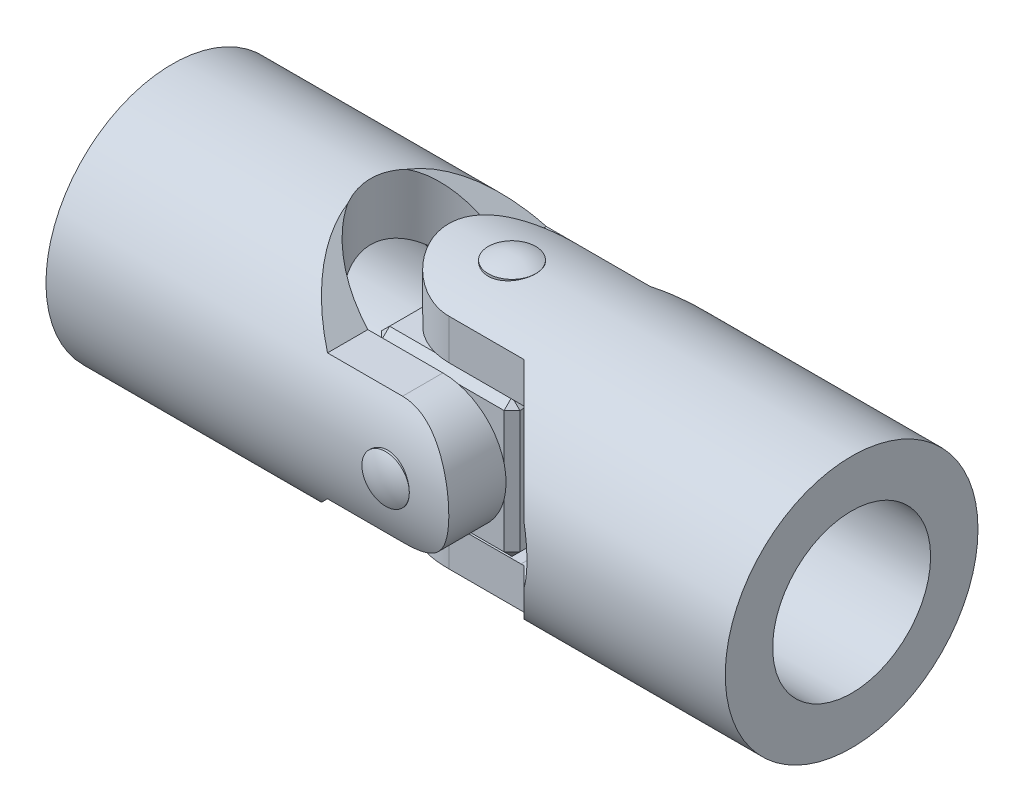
ISO-10303-21;
HEADER;
FILE_DESCRIPTION(('STEP AP214'),'2;1');
FILE_NAME('part.step','',(''),(''),'','','');
FILE_SCHEMA(('AUTOMOTIVE_DESIGN { 1 0 10303 214 1 1 1 1 }'));
ENDSEC;
DATA;
#1=APPLICATION_CONTEXT('core data for automotive mechanical design processes');
#2=APPLICATION_PROTOCOL_DEFINITION('international standard','automotive_design',2000,#1);
#3=PRODUCT_CONTEXT('',#1,'mechanical');
#4=PRODUCT('Part','Part','',(#3));
#5=PRODUCT_RELATED_PRODUCT_CATEGORY('part','',(#4));
#6=PRODUCT_DEFINITION_FORMATION('','',#4);
#7=PRODUCT_DEFINITION_CONTEXT('part definition',#1,'design');
#8=PRODUCT_DEFINITION('design','',#6,#7);
#9=PRODUCT_DEFINITION_SHAPE('','',#8);
#10=(LENGTH_UNIT() NAMED_UNIT(*) SI_UNIT(.MILLI.,.METRE.));
#11=(NAMED_UNIT(*) PLANE_ANGLE_UNIT() SI_UNIT($,.RADIAN.));
#12=(NAMED_UNIT(*) SI_UNIT($,.STERADIAN.) SOLID_ANGLE_UNIT());
#13=UNCERTAINTY_MEASURE_WITH_UNIT(LENGTH_MEASURE(1.E-05),#10,'distance_accuracy_value','');
#14=(GEOMETRIC_REPRESENTATION_CONTEXT(3) GLOBAL_UNCERTAINTY_ASSIGNED_CONTEXT((#13)) GLOBAL_UNIT_ASSIGNED_CONTEXT((#10,
#11,#12)) REPRESENTATION_CONTEXT('',''));
#15=CARTESIAN_POINT('',(0.,0.,0.));
#16=DIRECTION('',(0.,0.,1.));
#17=DIRECTION('',(1.,0.,0.));
#18=AXIS2_PLACEMENT_3D('',#15,#16,#17);
#19=CARTESIAN_POINT('',(0.,16.,0.));
#20=DIRECTION('',(0.,-1.,0.));
#21=DIRECTION('',(-1.,0.,0.));
#22=AXIS2_PLACEMENT_3D('',#19,#20,#21);
#23=CYLINDRICAL_SURFACE('',#22,3.);
#24=CARTESIAN_POINT('',(0.,16.,0.));
#25=DIRECTION('',(0.,1.,0.));
#26=DIRECTION('',(1.,0.,0.));
#27=AXIS2_PLACEMENT_3D('',#24,#25,#26);
#28=CIRCLE('',#27,3.);
#29=CARTESIAN_POINT('',(3.,16.,0.));
#30=VERTEX_POINT('',#29);
#31=EDGE_CURVE('P0_E10',#30,#30,#28,.T.);
#32=ORIENTED_EDGE('',*,*,#31,.F.);
#33=EDGE_LOOP('',(#32));
#34=FACE_BOUND('',#33,.T.);
#35=CARTESIAN_POINT('',(0.,-16.,0.));
#36=DIRECTION('',(0.,1.,0.));
#37=DIRECTION('',(0.,0.,1.));
#38=AXIS2_PLACEMENT_3D('',#35,#36,#37);
#39=CIRCLE('',#38,3.);
#40=CARTESIAN_POINT('',(0.,-16.,3.));
#41=VERTEX_POINT('',#40);
#42=EDGE_CURVE('P0_E20',#41,#41,#39,.T.);
#43=ORIENTED_EDGE('',*,*,#42,.T.);
#44=EDGE_LOOP('',(#43));
#45=FACE_BOUND('',#44,.T.);
#46=ADVANCED_FACE('P0_F14',(#34,#45),#23,.T.);
#47=CARTESIAN_POINT('',(0.,9.95330668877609,0.));
#48=DIRECTION('',(0.,1.,0.));
#49=DIRECTION('',(0.,0.,-1.));
#50=AXIS2_PLACEMENT_3D('',#47,#48,#49);
#51=SPHERICAL_SURFACE('',#50,6.75);
#52=ORIENTED_EDGE('',*,*,#31,.T.);
#53=EDGE_LOOP('',(#52));
#54=FACE_BOUND('',#53,.T.);
#55=ADVANCED_FACE('P0_F29',(#54),#51,.T.);
#56=CARTESIAN_POINT('',(0.,-9.95330668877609,0.));
#57=DIRECTION('',(0.,-1.,0.));
#58=DIRECTION('',(0.,0.,-1.));
#59=AXIS2_PLACEMENT_3D('',#56,#57,#58);
#60=SPHERICAL_SURFACE('',#59,6.75);
#61=ORIENTED_EDGE('',*,*,#42,.F.);
#62=EDGE_LOOP('',(#61));
#63=FACE_BOUND('',#62,.T.);
#64=ADVANCED_FACE('P0_F27',(#63),#60,.T.);
#65=CLOSED_SHELL('',(#46,#55,#64));
#66=MANIFOLD_SOLID_BREP('P0_B1',#65);
#67=CARTESIAN_POINT('',(0.,0.,16.));
#68=DIRECTION('',(0.,0.,-1.));
#69=DIRECTION('',(-1.,0.,0.));
#70=AXIS2_PLACEMENT_3D('',#67,#68,#69);
#71=CYLINDRICAL_SURFACE('',#70,3.);
#72=CARTESIAN_POINT('',(0.,0.,16.));
#73=DIRECTION('',(0.,0.,1.));
#74=DIRECTION('',(1.,0.,0.));
#75=AXIS2_PLACEMENT_3D('',#72,#73,#74);
#76=CIRCLE('',#75,3.);
#77=CARTESIAN_POINT('',(3.,0.,16.));
#78=VERTEX_POINT('',#77);
#79=EDGE_CURVE('P1_E10',#78,#78,#76,.T.);
#80=ORIENTED_EDGE('',*,*,#79,.F.);
#81=EDGE_LOOP('',(#80));
#82=FACE_BOUND('',#81,.T.);
#83=CARTESIAN_POINT('',(0.,0.,-16.));
#84=DIRECTION('',(0.,0.,1.));
#85=DIRECTION('',(0.,-1.,0.));
#86=AXIS2_PLACEMENT_3D('',#83,#84,#85);
#87=CIRCLE('',#86,3.);
#88=CARTESIAN_POINT('',(0.,-3.,-16.));
#89=VERTEX_POINT('',#88);
#90=EDGE_CURVE('P1_E20',#89,#89,#87,.T.);
#91=ORIENTED_EDGE('',*,*,#90,.T.);
#92=EDGE_LOOP('',(#91));
#93=FACE_BOUND('',#92,.T.);
#94=ADVANCED_FACE('P1_F14',(#82,#93),#71,.T.);
#95=CARTESIAN_POINT('',(0.,0.,9.95330668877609));
#96=DIRECTION('',(0.,0.,1.));
#97=DIRECTION('',(0.,1.,0.));
#98=AXIS2_PLACEMENT_3D('',#95,#96,#97);
#99=SPHERICAL_SURFACE('',#98,6.75);
#100=ORIENTED_EDGE('',*,*,#79,.T.);
#101=EDGE_LOOP('',(#100));
#102=FACE_BOUND('',#101,.T.);
#103=ADVANCED_FACE('P1_F29',(#102),#99,.T.);
#104=CARTESIAN_POINT('',(0.,0.,-9.95330668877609));
#105=DIRECTION('',(0.,0.,-1.));
#106=DIRECTION('',(0.,1.,0.));
#107=AXIS2_PLACEMENT_3D('',#104,#105,#106);
#108=SPHERICAL_SURFACE('',#107,6.75);
#109=ORIENTED_EDGE('',*,*,#90,.F.);
#110=EDGE_LOOP('',(#109));
#111=FACE_BOUND('',#110,.T.);
#112=ADVANCED_FACE('P1_F27',(#111),#108,.T.);
#113=CLOSED_SHELL('',(#94,#103,#112));
#114=MANIFOLD_SOLID_BREP('P1_B1',#113);
#115=CARTESIAN_POINT('',(0.,0.,8.75));
#116=DIRECTION('',(0.,0.,-1.));
#117=DIRECTION('',(-1.,0.,0.));
#118=AXIS2_PLACEMENT_3D('',#115,#116,#117);
#119=CYLINDRICAL_SURFACE('',#118,3.);
#120=CARTESIAN_POINT('',(0.,0.,0.));
#121=DIRECTION('',(0.,0.707106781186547,-0.707106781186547));
#122=DIRECTION('',(0.,-0.707106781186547,-0.707106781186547));
#123=AXIS2_PLACEMENT_3D('',#120,#121,#122);
#124=ELLIPSE('',#123,4.24264068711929,3.);
#125=CARTESIAN_POINT('',(3.,0.,0.));
#126=VERTEX_POINT('',#125);
#127=CARTESIAN_POINT('',(-3.,0.,0.));
#128=VERTEX_POINT('',#127);
#129=EDGE_CURVE('P2_E116',#126,#128,#124,.F.);
#130=ORIENTED_EDGE('',*,*,#129,.F.);
#131=CARTESIAN_POINT('',(0.,0.,0.));
#132=DIRECTION('',(0.,-0.707106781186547,-0.707106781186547));
#133=DIRECTION('',(0.,0.707106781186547,-0.707106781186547));
#134=AXIS2_PLACEMENT_3D('',#131,#132,#133);
#135=ELLIPSE('',#134,4.24264068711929,3.);
#136=EDGE_CURVE('P2_E120',#128,#126,#135,.F.);
#137=ORIENTED_EDGE('',*,*,#136,.F.);
#138=EDGE_LOOP('',(#130,#137));
#139=FACE_BOUND('',#138,.T.);
#140=CARTESIAN_POINT('',(0.,0.,8.75));
#141=DIRECTION('',(0.,0.,1.));
#142=DIRECTION('',(1.,0.,0.));
#143=AXIS2_PLACEMENT_3D('',#140,#141,#142);
#144=CIRCLE('',#143,3.);
#145=CARTESIAN_POINT('',(3.,0.,8.75));
#146=VERTEX_POINT('',#145);
#147=EDGE_CURVE('P2_E127',#146,#146,#144,.T.);
#148=ORIENTED_EDGE('',*,*,#147,.T.);
#149=EDGE_LOOP('',(#148));
#150=FACE_BOUND('',#149,.T.);
#151=ADVANCED_FACE('P2_F16',(#139,#150),#119,.F.);
#152=CARTESIAN_POINT('',(8.75,8.75,8.75));
#153=DIRECTION('',(0.,0.,1.));
#154=DIRECTION('',(1.,0.,0.));
#155=AXIS2_PLACEMENT_3D('',#152,#153,#154);
#156=PLANE('',#155);
#157=DIRECTION('',(0.,-1.,0.));
#158=VECTOR('',#157,1.);
#159=CARTESIAN_POINT('',(-7.75,-8.75,8.75));
#160=LINE('',#159,#158);
#161=CARTESIAN_POINT('',(-7.75,7.75,8.75));
#162=VERTEX_POINT('',#161);
#163=CARTESIAN_POINT('',(-7.75,-7.75,8.75));
#164=VERTEX_POINT('',#163);
#165=EDGE_CURVE('P2_E164',#162,#164,#160,.T.);
#166=ORIENTED_EDGE('',*,*,#165,.T.);
#167=DIRECTION('',(1.,0.,0.));
#168=VECTOR('',#167,1.);
#169=CARTESIAN_POINT('',(8.75,-7.75,8.75));
#170=LINE('',#169,#168);
#171=CARTESIAN_POINT('',(7.75,-7.75,8.75));
#172=VERTEX_POINT('',#171);
#173=EDGE_CURVE('P2_E168',#164,#172,#170,.T.);
#174=ORIENTED_EDGE('',*,*,#173,.T.);
#175=DIRECTION('',(0.,1.,0.));
#176=VECTOR('',#175,1.);
#177=CARTESIAN_POINT('',(7.75,8.75,8.75));
#178=LINE('',#177,#176);
#179=CARTESIAN_POINT('',(7.75,7.75,8.75));
#180=VERTEX_POINT('',#179);
#181=EDGE_CURVE('P2_E166',#172,#180,#178,.T.);
#182=ORIENTED_EDGE('',*,*,#181,.T.);
#183=DIRECTION('',(-1.,0.,0.));
#184=VECTOR('',#183,1.);
#185=CARTESIAN_POINT('',(-8.75,7.75,8.75));
#186=LINE('',#185,#184);
#187=EDGE_CURVE('P2_E162',#180,#162,#186,.T.);
#188=ORIENTED_EDGE('',*,*,#187,.T.);
#189=EDGE_LOOP('',(#166,#174,#182,#188));
#190=FACE_BOUND('',#189,.T.);
#191=ORIENTED_EDGE('',*,*,#147,.F.);
#192=EDGE_LOOP('',(#191));
#193=FACE_BOUND('',#192,.T.);
#194=ADVANCED_FACE('P2_F282',(#190,#193),#156,.T.);
#195=CARTESIAN_POINT('',(8.75,8.75,-8.75));
#196=DIRECTION('',(0.,0.,1.));
#197=DIRECTION('',(1.,0.,0.));
#198=AXIS2_PLACEMENT_3D('',#195,#196,#197);
#199=PLANE('',#198);
#200=DIRECTION('',(-1.,0.,0.));
#201=VECTOR('',#200,1.);
#202=CARTESIAN_POINT('',(8.75,-7.74999999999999,-8.75));
#203=LINE('',#202,#201);
#204=CARTESIAN_POINT('',(7.74999999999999,-7.74999999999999,-8.75));
#205=VERTEX_POINT('',#204);
#206=CARTESIAN_POINT('',(-7.74999999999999,-7.74999999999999,-8.75));
#207=VERTEX_POINT('',#206);
#208=EDGE_CURVE('P2_E157',#205,#207,#203,.T.);
#209=ORIENTED_EDGE('',*,*,#208,.T.);
#210=DIRECTION('',(0.,1.,0.));
#211=VECTOR('',#210,1.);
#212=CARTESIAN_POINT('',(-7.74999999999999,8.75,-8.75));
#213=LINE('',#212,#211);
#214=CARTESIAN_POINT('',(-7.74999999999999,7.75,-8.75));
#215=VERTEX_POINT('',#214);
#216=EDGE_CURVE('P2_E159',#207,#215,#213,.T.);
#217=ORIENTED_EDGE('',*,*,#216,.T.);
#218=DIRECTION('',(1.,0.,0.));
#219=VECTOR('',#218,1.);
#220=CARTESIAN_POINT('',(8.75,7.75,-8.75));
#221=LINE('',#220,#219);
#222=CARTESIAN_POINT('',(7.74999999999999,7.75,-8.75));
#223=VERTEX_POINT('',#222);
#224=EDGE_CURVE('P2_E153',#215,#223,#221,.T.);
#225=ORIENTED_EDGE('',*,*,#224,.T.);
#226=DIRECTION('',(0.,-1.,0.));
#227=VECTOR('',#226,1.);
#228=CARTESIAN_POINT('',(7.74999999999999,8.75,-8.75));
#229=LINE('',#228,#227);
#230=EDGE_CURVE('P2_E155',#223,#205,#229,.T.);
#231=ORIENTED_EDGE('',*,*,#230,.T.);
#232=EDGE_LOOP('',(#209,#217,#225,#231));
#233=FACE_BOUND('',#232,.T.);
#234=CARTESIAN_POINT('',(0.,0.,-8.75));
#235=DIRECTION('',(0.,0.,1.));
#236=DIRECTION('',(1.,0.,0.));
#237=AXIS2_PLACEMENT_3D('',#234,#235,#236);
#238=CIRCLE('',#237,3.);
#239=CARTESIAN_POINT('',(3.,0.,-8.75));
#240=VERTEX_POINT('',#239);
#241=EDGE_CURVE('P2_E259',#240,#240,#238,.T.);
#242=ORIENTED_EDGE('',*,*,#241,.T.);
#243=EDGE_LOOP('',(#242));
#244=FACE_BOUND('',#243,.T.);
#245=ADVANCED_FACE('P2_F267',(#233,#244),#199,.F.);
#246=CARTESIAN_POINT('',(-8.75,8.75,8.75));
#247=DIRECTION('',(0.,-1.,0.));
#248=DIRECTION('',(0.,0.,-1.));
#249=AXIS2_PLACEMENT_3D('',#246,#247,#248);
#250=PLANE('',#249);
#251=DIRECTION('',(-1.,0.,0.));
#252=VECTOR('',#251,1.);
#253=CARTESIAN_POINT('',(-8.75,8.75,-7.74999999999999));
#254=LINE('',#253,#252);
#255=CARTESIAN_POINT('',(7.74999999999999,8.75,-7.74999999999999));
#256=VERTEX_POINT('',#255);
#257=CARTESIAN_POINT('',(-7.74999999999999,8.75,-7.74999999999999));
#258=VERTEX_POINT('',#257);
#259=EDGE_CURVE('P2_E25',#256,#258,#254,.T.);
#260=ORIENTED_EDGE('',*,*,#259,.T.);
#261=DIRECTION('',(0.,0.,1.));
#262=VECTOR('',#261,1.);
#263=CARTESIAN_POINT('',(-7.74999999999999,8.75,8.75));
#264=LINE('',#263,#262);
#265=CARTESIAN_POINT('',(-7.74999999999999,8.75,7.74999999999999));
#266=VERTEX_POINT('',#265);
#267=EDGE_CURVE('P2_E11',#258,#266,#264,.T.);
#268=ORIENTED_EDGE('',*,*,#267,.T.);
#269=DIRECTION('',(1.,0.,0.));
#270=VECTOR('',#269,1.);
#271=CARTESIAN_POINT('',(8.75,8.75,7.74999999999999));
#272=LINE('',#271,#270);
#273=CARTESIAN_POINT('',(7.74999999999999,8.75,7.74999999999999));
#274=VERTEX_POINT('',#273);
#275=EDGE_CURVE('P2_E180',#266,#274,#272,.T.);
#276=ORIENTED_EDGE('',*,*,#275,.T.);
#277=DIRECTION('',(0.,0.,-1.));
#278=VECTOR('',#277,1.);
#279=CARTESIAN_POINT('',(7.74999999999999,8.75,8.75));
#280=LINE('',#279,#278);
#281=EDGE_CURVE('P2_E36',#274,#256,#280,.T.);
#282=ORIENTED_EDGE('',*,*,#281,.T.);
#283=EDGE_LOOP('',(#260,#268,#276,#282));
#284=FACE_BOUND('',#283,.T.);
#285=CARTESIAN_POINT('',(0.,8.75,0.));
#286=DIRECTION('',(0.,1.,0.));
#287=DIRECTION('',(0.,0.,1.));
#288=AXIS2_PLACEMENT_3D('',#285,#286,#287);
#289=CIRCLE('',#288,3.);
#290=CARTESIAN_POINT('',(0.,8.75,3.));
#291=VERTEX_POINT('',#290);
#292=EDGE_CURVE('P2_E249',#291,#291,#289,.T.);
#293=ORIENTED_EDGE('',*,*,#292,.F.);
#294=EDGE_LOOP('',(#293));
#295=FACE_BOUND('',#294,.T.);
#296=ADVANCED_FACE('P2_F290',(#284,#295),#250,.F.);
#297=CARTESIAN_POINT('',(-8.75,-8.75,8.75));
#298=DIRECTION('',(1.,0.,0.));
#299=DIRECTION('',(0.,0.,-1.));
#300=AXIS2_PLACEMENT_3D('',#297,#298,#299);
#301=PLANE('',#300);
#302=DIRECTION('',(0.,-1.,0.));
#303=VECTOR('',#302,1.);
#304=CARTESIAN_POINT('',(-8.75,-8.75,-7.75));
#305=LINE('',#304,#303);
#306=CARTESIAN_POINT('',(-8.75,7.75,-7.75));
#307=VERTEX_POINT('',#306);
#308=CARTESIAN_POINT('',(-8.75,-7.74999999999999,-7.75));
#309=VERTEX_POINT('',#308);
#310=EDGE_CURVE('P2_E148',#307,#309,#305,.T.);
#311=ORIENTED_EDGE('',*,*,#310,.T.);
#312=DIRECTION('',(0.,0.,1.));
#313=VECTOR('',#312,1.);
#314=CARTESIAN_POINT('',(-8.75,-7.74999999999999,8.75));
#315=LINE('',#314,#313);
#316=CARTESIAN_POINT('',(-8.75,-7.74999999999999,7.74999999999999));
#317=VERTEX_POINT('',#316);
#318=EDGE_CURVE('P2_E150',#309,#317,#315,.T.);
#319=ORIENTED_EDGE('',*,*,#318,.T.);
#320=DIRECTION('',(0.,1.,0.));
#321=VECTOR('',#320,1.);
#322=CARTESIAN_POINT('',(-8.75,8.75,7.74999999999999));
#323=LINE('',#322,#321);
#324=CARTESIAN_POINT('',(-8.75,7.75,7.74999999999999));
#325=VERTEX_POINT('',#324);
#326=EDGE_CURVE('P2_E146',#317,#325,#323,.T.);
#327=ORIENTED_EDGE('',*,*,#326,.T.);
#328=DIRECTION('',(0.,0.,-1.));
#329=VECTOR('',#328,1.);
#330=CARTESIAN_POINT('',(-8.75,7.75,8.75));
#331=LINE('',#330,#329);
#332=EDGE_CURVE('P2_E144',#325,#307,#331,.T.);
#333=ORIENTED_EDGE('',*,*,#332,.T.);
#334=EDGE_LOOP('',(#311,#319,#327,#333));
#335=FACE_BOUND('',#334,.T.);
#336=ADVANCED_FACE('P2_F297',(#335),#301,.F.);
#337=CARTESIAN_POINT('',(-8.75,-8.75,8.75));
#338=DIRECTION('',(0.,1.,0.));
#339=DIRECTION('',(0.,0.,1.));
#340=AXIS2_PLACEMENT_3D('',#337,#338,#339);
#341=PLANE('',#340);
#342=DIRECTION('',(-1.,0.,0.));
#343=VECTOR('',#342,1.);
#344=CARTESIAN_POINT('',(-8.75,-8.75,7.74999999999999));
#345=LINE('',#344,#343);
#346=CARTESIAN_POINT('',(7.74999999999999,-8.75,7.74999999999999));
#347=VERTEX_POINT('',#346);
#348=CARTESIAN_POINT('',(-7.75,-8.75,7.74999999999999));
#349=VERTEX_POINT('',#348);
#350=EDGE_CURVE('P2_E137',#347,#349,#345,.T.);
#351=ORIENTED_EDGE('',*,*,#350,.T.);
#352=DIRECTION('',(0.,0.,-1.));
#353=VECTOR('',#352,1.);
#354=CARTESIAN_POINT('',(-7.75,-8.75,8.75));
#355=LINE('',#354,#353);
#356=CARTESIAN_POINT('',(-7.75,-8.75,-7.75));
#357=VERTEX_POINT('',#356);
#358=EDGE_CURVE('P2_E141',#349,#357,#355,.T.);
#359=ORIENTED_EDGE('',*,*,#358,.T.);
#360=DIRECTION('',(1.,0.,0.));
#361=VECTOR('',#360,1.);
#362=CARTESIAN_POINT('',(-8.75,-8.75,-7.75));
#363=LINE('',#362,#361);
#364=CARTESIAN_POINT('',(7.74999999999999,-8.75,-7.75));
#365=VERTEX_POINT('',#364);
#366=EDGE_CURVE('P2_E139',#357,#365,#363,.T.);
#367=ORIENTED_EDGE('',*,*,#366,.T.);
#368=DIRECTION('',(0.,0.,1.));
#369=VECTOR('',#368,1.);
#370=CARTESIAN_POINT('',(7.74999999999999,-8.75,8.75));
#371=LINE('',#370,#369);
#372=EDGE_CURVE('P2_E130',#365,#347,#371,.T.);
#373=ORIENTED_EDGE('',*,*,#372,.T.);
#374=EDGE_LOOP('',(#351,#359,#367,#373));
#375=FACE_BOUND('',#374,.T.);
#376=CARTESIAN_POINT('',(0.,-8.75,0.));
#377=DIRECTION('',(0.,1.,0.));
#378=DIRECTION('',(0.,0.,1.));
#379=AXIS2_PLACEMENT_3D('',#376,#377,#378);
#380=CIRCLE('',#379,3.);
#381=CARTESIAN_POINT('',(0.,-8.75,3.));
#382=VERTEX_POINT('',#381);
#383=EDGE_CURVE('P2_E255',#382,#382,#380,.T.);
#384=ORIENTED_EDGE('',*,*,#383,.T.);
#385=EDGE_LOOP('',(#384));
#386=FACE_BOUND('',#385,.T.);
#387=ADVANCED_FACE('P2_F277',(#375,#386),#341,.F.);
#388=CARTESIAN_POINT('',(8.75,-8.75,8.75));
#389=DIRECTION('',(-1.,0.,0.));
#390=DIRECTION('',(0.,0.,1.));
#391=AXIS2_PLACEMENT_3D('',#388,#389,#390);
#392=PLANE('',#391);
#393=DIRECTION('',(0.,-1.,0.));
#394=VECTOR('',#393,1.);
#395=CARTESIAN_POINT('',(8.75,-8.75,7.74999999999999));
#396=LINE('',#395,#394);
#397=CARTESIAN_POINT('',(8.75,7.75,7.74999999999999));
#398=VERTEX_POINT('',#397);
#399=CARTESIAN_POINT('',(8.75,-7.75,7.74999999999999));
#400=VERTEX_POINT('',#399);
#401=EDGE_CURVE('P2_E173',#398,#400,#396,.T.);
#402=ORIENTED_EDGE('',*,*,#401,.T.);
#403=DIRECTION('',(0.,0.,-1.));
#404=VECTOR('',#403,1.);
#405=CARTESIAN_POINT('',(8.75,-7.75,8.75));
#406=LINE('',#405,#404);
#407=CARTESIAN_POINT('',(8.75,-7.75,-7.75));
#408=VERTEX_POINT('',#407);
#409=EDGE_CURVE('P2_E177',#400,#408,#406,.T.);
#410=ORIENTED_EDGE('',*,*,#409,.T.);
#411=DIRECTION('',(0.,1.,0.));
#412=VECTOR('',#411,1.);
#413=CARTESIAN_POINT('',(8.75,-8.75,-7.75));
#414=LINE('',#413,#412);
#415=CARTESIAN_POINT('',(8.75,7.75,-7.75));
#416=VERTEX_POINT('',#415);
#417=EDGE_CURVE('P2_E175',#408,#416,#414,.T.);
#418=ORIENTED_EDGE('',*,*,#417,.T.);
#419=DIRECTION('',(0.,0.,1.));
#420=VECTOR('',#419,1.);
#421=CARTESIAN_POINT('',(8.75,7.75,8.75));
#422=LINE('',#421,#420);
#423=EDGE_CURVE('P2_E171',#416,#398,#422,.T.);
#424=ORIENTED_EDGE('',*,*,#423,.T.);
#425=EDGE_LOOP('',(#402,#410,#418,#424));
#426=FACE_BOUND('',#425,.T.);
#427=ADVANCED_FACE('P2_F269',(#426),#392,.F.);
#428=CARTESIAN_POINT('',(0.,0.,0.));
#429=DIRECTION('',(0.,0.707106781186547,-0.707106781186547));
#430=DIRECTION('',(0.,-0.707106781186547,-0.707106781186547));
#431=AXIS2_PLACEMENT_3D('',#428,#429,#430);
#432=ELLIPSE('',#431,4.24264068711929,3.);
#433=EDGE_CURVE('P2_E119',#126,#128,#432,.T.);
#434=ORIENTED_EDGE('',*,*,#433,.F.);
#435=CARTESIAN_POINT('',(0.,0.,0.));
#436=DIRECTION('',(0.,-0.707106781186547,-0.707106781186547));
#437=DIRECTION('',(0.,0.707106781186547,-0.707106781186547));
#438=AXIS2_PLACEMENT_3D('',#435,#436,#437);
#439=ELLIPSE('',#438,4.24264068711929,3.);
#440=EDGE_CURVE('P2_E111',#128,#126,#439,.T.);
#441=ORIENTED_EDGE('',*,*,#440,.F.);
#442=EDGE_LOOP('',(#434,#441));
#443=FACE_BOUND('',#442,.T.);
#444=ORIENTED_EDGE('',*,*,#241,.F.);
#445=EDGE_LOOP('',(#444));
#446=FACE_BOUND('',#445,.T.);
#447=ADVANCED_FACE('P2_F132',(#443,#446),#119,.F.);
#448=CARTESIAN_POINT('',(0.,-8.75,0.));
#449=DIRECTION('',(0.,1.,0.));
#450=DIRECTION('',(0.,0.,1.));
#451=AXIS2_PLACEMENT_3D('',#448,#449,#450);
#452=CYLINDRICAL_SURFACE('',#451,3.);
#453=ORIENTED_EDGE('',*,*,#433,.T.);
#454=ORIENTED_EDGE('',*,*,#136,.T.);
#455=EDGE_LOOP('',(#453,#454));
#456=FACE_BOUND('',#455,.T.);
#457=ORIENTED_EDGE('',*,*,#383,.F.);
#458=EDGE_LOOP('',(#457));
#459=FACE_BOUND('',#458,.T.);
#460=ADVANCED_FACE('P2_F124',(#456,#459),#452,.F.);
#461=ORIENTED_EDGE('',*,*,#129,.T.);
#462=ORIENTED_EDGE('',*,*,#440,.T.);
#463=EDGE_LOOP('',(#461,#462));
#464=FACE_BOUND('',#463,.T.);
#465=ORIENTED_EDGE('',*,*,#292,.T.);
#466=EDGE_LOOP('',(#465));
#467=FACE_BOUND('',#466,.T.);
#468=ADVANCED_FACE('P2_F113',(#464,#467),#452,.F.);
#469=CARTESIAN_POINT('',(7.74999999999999,8.75,8.75));
#470=DIRECTION('',(-0.707106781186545,-0.70710678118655,0.));
#471=DIRECTION('',(0.70710678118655,-0.707106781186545,0.));
#472=AXIS2_PLACEMENT_3D('',#469,#470,#471);
#473=PLANE('',#472);
#474=DIRECTION('',(0.70710678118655,-0.707106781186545,0.));
#475=VECTOR('',#474,1.);
#476=CARTESIAN_POINT('',(8.25,8.25,7.74999999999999));
#477=LINE('',#476,#475);
#478=EDGE_CURVE('P2_E20',#398,#274,#477,.F.);
#479=ORIENTED_EDGE('',*,*,#478,.F.);
#480=ORIENTED_EDGE('',*,*,#423,.F.);
#481=DIRECTION('',(-0.70710678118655,0.707106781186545,0.));
#482=VECTOR('',#481,1.);
#483=CARTESIAN_POINT('',(8.75,7.75,-7.75));
#484=LINE('',#483,#482);
#485=EDGE_CURVE('P2_E243',#256,#416,#484,.F.);
#486=ORIENTED_EDGE('',*,*,#485,.F.);
#487=ORIENTED_EDGE('',*,*,#281,.F.);
#488=EDGE_LOOP('',(#479,#480,#486,#487));
#489=FACE_BOUND('',#488,.T.);
#490=ADVANCED_FACE('P2_F18',(#489),#473,.F.);
#491=CARTESIAN_POINT('',(7.75,7.75,8.75));
#492=DIRECTION('',(0.577350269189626,0.57735026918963,0.577350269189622));
#493=DIRECTION('',(-0.70710678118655,0.707106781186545,0.));
#494=AXIS2_PLACEMENT_3D('',#491,#492,#493);
#495=PLANE('',#494);
#496=DIRECTION('',(0.707106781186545,0.,-0.70710678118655));
#497=VECTOR('',#496,1.);
#498=CARTESIAN_POINT('',(7.75,7.75,8.75));
#499=LINE('',#498,#497);
#500=EDGE_CURVE('P2_E238',#398,#180,#499,.F.);
#501=ORIENTED_EDGE('',*,*,#500,.F.);
#502=ORIENTED_EDGE('',*,*,#478,.T.);
#503=DIRECTION('',(0.,-0.707106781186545,0.70710678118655));
#504=VECTOR('',#503,1.);
#505=CARTESIAN_POINT('',(7.75,7.75,8.75));
#506=LINE('',#505,#504);
#507=EDGE_CURVE('P2_E241',#180,#274,#506,.F.);
#508=ORIENTED_EDGE('',*,*,#507,.F.);
#509=EDGE_LOOP('',(#501,#502,#508));
#510=FACE_BOUND('',#509,.T.);
#511=ADVANCED_FACE('P2_F374',(#510),#495,.T.);
#512=CARTESIAN_POINT('',(8.75,7.75,-7.75));
#513=DIRECTION('',(0.577350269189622,0.57735026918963,-0.577350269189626));
#514=DIRECTION('',(0.,0.707106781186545,0.70710678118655));
#515=AXIS2_PLACEMENT_3D('',#512,#513,#514);
#516=PLANE('',#515);
#517=DIRECTION('',(0.,-0.707106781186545,-0.70710678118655));
#518=VECTOR('',#517,1.);
#519=CARTESIAN_POINT('',(7.74999999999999,8.25,-8.25));
#520=LINE('',#519,#518);
#521=EDGE_CURVE('P2_E232',#256,#223,#520,.T.);
#522=ORIENTED_EDGE('',*,*,#521,.F.);
#523=ORIENTED_EDGE('',*,*,#485,.T.);
#524=DIRECTION('',(0.70710678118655,0.,0.707106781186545));
#525=VECTOR('',#524,1.);
#526=CARTESIAN_POINT('',(8.75,7.75,-7.75));
#527=LINE('',#526,#525);
#528=EDGE_CURVE('P2_E235',#223,#416,#527,.T.);
#529=ORIENTED_EDGE('',*,*,#528,.F.);
#530=EDGE_LOOP('',(#522,#523,#529));
#531=FACE_BOUND('',#530,.T.);
#532=ADVANCED_FACE('P2_F371',(#531),#516,.T.);
#533=CARTESIAN_POINT('',(8.75,7.75,8.75));
#534=DIRECTION('',(0.,0.70710678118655,0.707106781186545));
#535=DIRECTION('',(0.,-0.707106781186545,0.70710678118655));
#536=AXIS2_PLACEMENT_3D('',#533,#534,#535);
#537=PLANE('',#536);
#538=ORIENTED_EDGE('',*,*,#507,.T.);
#539=ORIENTED_EDGE('',*,*,#275,.F.);
#540=DIRECTION('',(0.,0.707106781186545,-0.70710678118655));
#541=VECTOR('',#540,1.);
#542=CARTESIAN_POINT('',(-7.75,8.25,8.25));
#543=LINE('',#542,#541);
#544=EDGE_CURVE('P2_E227',#162,#266,#543,.T.);
#545=ORIENTED_EDGE('',*,*,#544,.F.);
#546=ORIENTED_EDGE('',*,*,#187,.F.);
#547=EDGE_LOOP('',(#538,#539,#545,#546));
#548=FACE_BOUND('',#547,.T.);
#549=ADVANCED_FACE('P2_F367',(#548),#537,.T.);
#550=CARTESIAN_POINT('',(7.75,8.75,8.75));
#551=DIRECTION('',(0.70710678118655,0.,0.707106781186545));
#552=DIRECTION('',(0.707106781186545,0.,-0.70710678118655));
#553=AXIS2_PLACEMENT_3D('',#550,#551,#552);
#554=PLANE('',#553);
#555=ORIENTED_EDGE('',*,*,#500,.T.);
#556=ORIENTED_EDGE('',*,*,#181,.F.);
#557=DIRECTION('',(-0.707106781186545,0.,0.70710678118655));
#558=VECTOR('',#557,1.);
#559=CARTESIAN_POINT('',(7.75,-7.75,8.75));
#560=LINE('',#559,#558);
#561=EDGE_CURVE('P2_E224',#400,#172,#560,.T.);
#562=ORIENTED_EDGE('',*,*,#561,.F.);
#563=ORIENTED_EDGE('',*,*,#401,.F.);
#564=EDGE_LOOP('',(#555,#556,#562,#563));
#565=FACE_BOUND('',#564,.T.);
#566=ADVANCED_FACE('P2_F363',(#565),#554,.T.);
#567=CARTESIAN_POINT('',(8.75,-7.75,8.75));
#568=DIRECTION('',(-0.707106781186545,0.70710678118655,0.));
#569=DIRECTION('',(-0.70710678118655,-0.707106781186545,0.));
#570=AXIS2_PLACEMENT_3D('',#567,#568,#569);
#571=PLANE('',#570);
#572=DIRECTION('',(0.70710678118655,0.707106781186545,0.));
#573=VECTOR('',#572,1.);
#574=CARTESIAN_POINT('',(7.74999999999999,-8.75,-7.75));
#575=LINE('',#574,#573);
#576=EDGE_CURVE('P2_E218',#408,#365,#575,.F.);
#577=ORIENTED_EDGE('',*,*,#576,.F.);
#578=ORIENTED_EDGE('',*,*,#409,.F.);
#579=DIRECTION('',(-0.70710678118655,-0.707106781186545,0.));
#580=VECTOR('',#579,1.);
#581=CARTESIAN_POINT('',(8.25,-8.25,7.74999999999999));
#582=LINE('',#581,#580);
#583=EDGE_CURVE('P2_E221',#347,#400,#582,.F.);
#584=ORIENTED_EDGE('',*,*,#583,.F.);
#585=ORIENTED_EDGE('',*,*,#372,.F.);
#586=EDGE_LOOP('',(#577,#578,#584,#585));
#587=FACE_BOUND('',#586,.T.);
#588=ADVANCED_FACE('P2_F359',(#587),#571,.F.);
#589=CARTESIAN_POINT('',(8.75,-8.75,-7.75));
#590=DIRECTION('',(-0.707106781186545,0.,0.70710678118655));
#591=DIRECTION('',(0.70710678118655,0.,0.707106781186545));
#592=AXIS2_PLACEMENT_3D('',#589,#590,#591);
#593=PLANE('',#592);
#594=ORIENTED_EDGE('',*,*,#528,.T.);
#595=ORIENTED_EDGE('',*,*,#417,.F.);
#596=DIRECTION('',(-0.70710678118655,0.,-0.707106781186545));
#597=VECTOR('',#596,1.);
#598=CARTESIAN_POINT('',(8.25,-7.75,-8.25));
#599=LINE('',#598,#597);
#600=EDGE_CURVE('P2_E216',#205,#408,#599,.F.);
#601=ORIENTED_EDGE('',*,*,#600,.F.);
#602=ORIENTED_EDGE('',*,*,#230,.F.);
#603=EDGE_LOOP('',(#594,#595,#601,#602));
#604=FACE_BOUND('',#603,.T.);
#605=ADVANCED_FACE('P2_F355',(#604),#593,.F.);
#606=CARTESIAN_POINT('',(-8.75,8.75,-7.74999999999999));
#607=DIRECTION('',(0.,-0.70710678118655,0.707106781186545));
#608=DIRECTION('',(0.,-0.707106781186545,-0.70710678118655));
#609=AXIS2_PLACEMENT_3D('',#606,#607,#608);
#610=PLANE('',#609);
#611=ORIENTED_EDGE('',*,*,#521,.T.);
#612=ORIENTED_EDGE('',*,*,#224,.F.);
#613=DIRECTION('',(0.,0.707106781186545,0.70710678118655));
#614=VECTOR('',#613,1.);
#615=CARTESIAN_POINT('',(-7.74999999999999,7.75,-8.75));
#616=LINE('',#615,#614);
#617=EDGE_CURVE('P2_E213',#258,#215,#616,.F.);
#618=ORIENTED_EDGE('',*,*,#617,.F.);
#619=ORIENTED_EDGE('',*,*,#259,.F.);
#620=EDGE_LOOP('',(#611,#612,#618,#619));
#621=FACE_BOUND('',#620,.T.);
#622=ADVANCED_FACE('P2_F351',(#621),#610,.F.);
#623=CARTESIAN_POINT('',(-8.75,7.75,8.75));
#624=DIRECTION('',(0.707106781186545,-0.70710678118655,0.));
#625=DIRECTION('',(0.70710678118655,0.707106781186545,0.));
#626=AXIS2_PLACEMENT_3D('',#623,#624,#625);
#627=PLANE('',#626);
#628=DIRECTION('',(0.70710678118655,0.707106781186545,0.));
#629=VECTOR('',#628,1.);
#630=CARTESIAN_POINT('',(-8.75,7.75,7.74999999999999));
#631=LINE('',#630,#629);
#632=EDGE_CURVE('P2_E229',#266,#325,#631,.F.);
#633=ORIENTED_EDGE('',*,*,#632,.F.);
#634=ORIENTED_EDGE('',*,*,#267,.F.);
#635=DIRECTION('',(-0.70710678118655,-0.707106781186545,0.));
#636=VECTOR('',#635,1.);
#637=CARTESIAN_POINT('',(-8.25,8.25,-7.75));
#638=LINE('',#637,#636);
#639=EDGE_CURVE('P2_E210',#307,#258,#638,.F.);
#640=ORIENTED_EDGE('',*,*,#639,.F.);
#641=ORIENTED_EDGE('',*,*,#332,.F.);
#642=EDGE_LOOP('',(#633,#634,#640,#641));
#643=FACE_BOUND('',#642,.T.);
#644=ADVANCED_FACE('P2_F347',(#643),#627,.F.);
#645=CARTESIAN_POINT('',(-8.75,7.75,7.74999999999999));
#646=DIRECTION('',(-0.577350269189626,0.57735026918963,0.577350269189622));
#647=DIRECTION('',(-0.70710678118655,-0.707106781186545,0.));
#648=AXIS2_PLACEMENT_3D('',#645,#646,#647);
#649=PLANE('',#648);
#650=ORIENTED_EDGE('',*,*,#544,.T.);
#651=ORIENTED_EDGE('',*,*,#632,.T.);
#652=DIRECTION('',(0.707106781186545,0.,0.70710678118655));
#653=VECTOR('',#652,1.);
#654=CARTESIAN_POINT('',(-8.75,7.75,7.74999999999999));
#655=LINE('',#654,#653);
#656=EDGE_CURVE('P2_E207',#162,#325,#655,.F.);
#657=ORIENTED_EDGE('',*,*,#656,.F.);
#658=EDGE_LOOP('',(#650,#651,#657));
#659=FACE_BOUND('',#658,.T.);
#660=ADVANCED_FACE('P2_F343',(#659),#649,.T.);
#661=CARTESIAN_POINT('',(7.75,-7.75,8.75));
#662=DIRECTION('',(0.577350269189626,-0.57735026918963,0.577350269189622));
#663=DIRECTION('',(0.70710678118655,0.707106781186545,0.));
#664=AXIS2_PLACEMENT_3D('',#661,#662,#663);
#665=PLANE('',#664);
#666=ORIENTED_EDGE('',*,*,#583,.T.);
#667=ORIENTED_EDGE('',*,*,#561,.T.);
#668=DIRECTION('',(0.,-0.707106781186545,-0.70710678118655));
#669=VECTOR('',#668,1.);
#670=CARTESIAN_POINT('',(7.75,-7.75,8.75));
#671=LINE('',#670,#669);
#672=EDGE_CURVE('P2_E205',#347,#172,#671,.F.);
#673=ORIENTED_EDGE('',*,*,#672,.F.);
#674=EDGE_LOOP('',(#666,#667,#673));
#675=FACE_BOUND('',#674,.T.);
#676=ADVANCED_FACE('P2_F339',(#675),#665,.T.);
#677=CARTESIAN_POINT('',(7.74999999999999,-8.75,-7.75));
#678=DIRECTION('',(0.577350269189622,-0.577350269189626,-0.57735026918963));
#679=DIRECTION('',(0.,0.70710678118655,-0.707106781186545));
#680=AXIS2_PLACEMENT_3D('',#677,#678,#679);
#681=PLANE('',#680);
#682=ORIENTED_EDGE('',*,*,#600,.T.);
#683=ORIENTED_EDGE('',*,*,#576,.T.);
#684=DIRECTION('',(0.,-0.70710678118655,0.707106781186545));
#685=VECTOR('',#684,1.);
#686=CARTESIAN_POINT('',(7.74999999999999,-8.75,-7.75));
#687=LINE('',#686,#685);
#688=EDGE_CURVE('P2_E202',#205,#365,#687,.T.);
#689=ORIENTED_EDGE('',*,*,#688,.F.);
#690=EDGE_LOOP('',(#682,#683,#689));
#691=FACE_BOUND('',#690,.T.);
#692=ADVANCED_FACE('P2_F335',(#691),#681,.T.);
#693=CARTESIAN_POINT('',(-7.74999999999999,7.75,-8.75));
#694=DIRECTION('',(-0.577350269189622,0.57735026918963,-0.577350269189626));
#695=DIRECTION('',(0.,0.707106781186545,0.70710678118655));
#696=AXIS2_PLACEMENT_3D('',#693,#694,#695);
#697=PLANE('',#696);
#698=ORIENTED_EDGE('',*,*,#639,.T.);
#699=ORIENTED_EDGE('',*,*,#617,.T.);
#700=DIRECTION('',(0.70710678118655,0.,-0.707106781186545));
#701=VECTOR('',#700,1.);
#702=CARTESIAN_POINT('',(-7.74999999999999,7.75,-8.75));
#703=LINE('',#702,#701);
#704=EDGE_CURVE('P2_E200',#307,#215,#703,.T.);
#705=ORIENTED_EDGE('',*,*,#704,.F.);
#706=EDGE_LOOP('',(#698,#699,#705));
#707=FACE_BOUND('',#706,.T.);
#708=ADVANCED_FACE('P2_F331',(#707),#697,.T.);
#709=CARTESIAN_POINT('',(-7.75,8.75,8.75));
#710=DIRECTION('',(-0.70710678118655,0.,0.707106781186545));
#711=DIRECTION('',(0.707106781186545,0.,0.70710678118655));
#712=AXIS2_PLACEMENT_3D('',#709,#710,#711);
#713=PLANE('',#712);
#714=ORIENTED_EDGE('',*,*,#656,.T.);
#715=ORIENTED_EDGE('',*,*,#326,.F.);
#716=DIRECTION('',(-0.707106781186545,0.,-0.70710678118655));
#717=VECTOR('',#716,1.);
#718=CARTESIAN_POINT('',(-8.75,-7.74999999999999,7.74999999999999));
#719=LINE('',#718,#717);
#720=EDGE_CURVE('P2_E197',#164,#317,#719,.T.);
#721=ORIENTED_EDGE('',*,*,#720,.F.);
#722=ORIENTED_EDGE('',*,*,#165,.F.);
#723=EDGE_LOOP('',(#714,#715,#721,#722));
#724=FACE_BOUND('',#723,.T.);
#725=ADVANCED_FACE('P2_F327',(#724),#713,.T.);
#726=CARTESIAN_POINT('',(8.75,-7.75,8.75));
#727=DIRECTION('',(0.,-0.70710678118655,0.707106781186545));
#728=DIRECTION('',(0.,-0.707106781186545,-0.70710678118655));
#729=AXIS2_PLACEMENT_3D('',#726,#727,#728);
#730=PLANE('',#729);
#731=ORIENTED_EDGE('',*,*,#672,.T.);
#732=ORIENTED_EDGE('',*,*,#173,.F.);
#733=DIRECTION('',(0.,0.707106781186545,0.70710678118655));
#734=VECTOR('',#733,1.);
#735=CARTESIAN_POINT('',(-7.75,-8.25,8.25));
#736=LINE('',#735,#734);
#737=EDGE_CURVE('P2_E194',#349,#164,#736,.T.);
#738=ORIENTED_EDGE('',*,*,#737,.F.);
#739=ORIENTED_EDGE('',*,*,#350,.F.);
#740=EDGE_LOOP('',(#731,#732,#738,#739));
#741=FACE_BOUND('',#740,.T.);
#742=ADVANCED_FACE('P2_F323',(#741),#730,.T.);
#743=CARTESIAN_POINT('',(-8.75,-8.75,-7.75));
#744=DIRECTION('',(0.,0.707106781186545,0.70710678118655));
#745=DIRECTION('',(0.,-0.70710678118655,0.707106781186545));
#746=AXIS2_PLACEMENT_3D('',#743,#744,#745);
#747=PLANE('',#746);
#748=ORIENTED_EDGE('',*,*,#688,.T.);
#749=ORIENTED_EDGE('',*,*,#366,.F.);
#750=DIRECTION('',(0.,0.70710678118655,-0.707106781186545));
#751=VECTOR('',#750,1.);
#752=CARTESIAN_POINT('',(-7.75,-8.75,-7.75));
#753=LINE('',#752,#751);
#754=EDGE_CURVE('P2_E191',#207,#357,#753,.F.);
#755=ORIENTED_EDGE('',*,*,#754,.F.);
#756=ORIENTED_EDGE('',*,*,#208,.F.);
#757=EDGE_LOOP('',(#748,#749,#755,#756));
#758=FACE_BOUND('',#757,.T.);
#759=ADVANCED_FACE('P2_F319',(#758),#747,.F.);
#760=CARTESIAN_POINT('',(-8.75,-8.75,-7.75));
#761=DIRECTION('',(0.707106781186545,0.,0.70710678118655));
#762=DIRECTION('',(0.70710678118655,0.,-0.707106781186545));
#763=AXIS2_PLACEMENT_3D('',#760,#761,#762);
#764=PLANE('',#763);
#765=ORIENTED_EDGE('',*,*,#704,.T.);
#766=ORIENTED_EDGE('',*,*,#216,.F.);
#767=DIRECTION('',(-0.70710678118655,0.,0.707106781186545));
#768=VECTOR('',#767,1.);
#769=CARTESIAN_POINT('',(-8.25,-7.74999999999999,-8.25));
#770=LINE('',#769,#768);
#771=EDGE_CURVE('P2_E188',#309,#207,#770,.F.);
#772=ORIENTED_EDGE('',*,*,#771,.F.);
#773=ORIENTED_EDGE('',*,*,#310,.F.);
#774=EDGE_LOOP('',(#765,#766,#772,#773));
#775=FACE_BOUND('',#774,.T.);
#776=ADVANCED_FACE('P2_F315',(#775),#764,.F.);
#777=CARTESIAN_POINT('',(-8.75,-7.74999999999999,7.74999999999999));
#778=DIRECTION('',(-0.57735026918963,-0.577350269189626,0.577350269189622));
#779=DIRECTION('',(0.707106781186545,-0.70710678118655,0.));
#780=AXIS2_PLACEMENT_3D('',#777,#778,#779);
#781=PLANE('',#780);
#782=ORIENTED_EDGE('',*,*,#737,.T.);
#783=ORIENTED_EDGE('',*,*,#720,.T.);
#784=DIRECTION('',(-0.707106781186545,0.70710678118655,0.));
#785=VECTOR('',#784,1.);
#786=CARTESIAN_POINT('',(-8.75,-7.74999999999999,7.74999999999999));
#787=LINE('',#786,#785);
#788=EDGE_CURVE('P2_E186',#349,#317,#787,.T.);
#789=ORIENTED_EDGE('',*,*,#788,.F.);
#790=EDGE_LOOP('',(#782,#783,#789));
#791=FACE_BOUND('',#790,.T.);
#792=ADVANCED_FACE('P2_F311',(#791),#781,.T.);
#793=CARTESIAN_POINT('',(-7.75,-8.75,-7.75));
#794=DIRECTION('',(-0.577350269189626,-0.577350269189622,-0.57735026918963));
#795=DIRECTION('',(-0.70710678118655,0.,0.707106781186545));
#796=AXIS2_PLACEMENT_3D('',#793,#794,#795);
#797=PLANE('',#796);
#798=ORIENTED_EDGE('',*,*,#771,.T.);
#799=ORIENTED_EDGE('',*,*,#754,.T.);
#800=DIRECTION('',(0.707106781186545,-0.70710678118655,0.));
#801=VECTOR('',#800,1.);
#802=CARTESIAN_POINT('',(-7.75,-8.75,-7.75));
#803=LINE('',#802,#801);
#804=EDGE_CURVE('P2_E184',#309,#357,#803,.T.);
#805=ORIENTED_EDGE('',*,*,#804,.F.);
#806=EDGE_LOOP('',(#798,#799,#805));
#807=FACE_BOUND('',#806,.T.);
#808=ADVANCED_FACE('P2_F307',(#807),#797,.T.);
#809=CARTESIAN_POINT('',(-7.75,-8.75,8.75));
#810=DIRECTION('',(0.70710678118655,0.707106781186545,0.));
#811=DIRECTION('',(-0.707106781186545,0.70710678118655,0.));
#812=AXIS2_PLACEMENT_3D('',#809,#810,#811);
#813=PLANE('',#812);
#814=ORIENTED_EDGE('',*,*,#788,.T.);
#815=ORIENTED_EDGE('',*,*,#318,.F.);
#816=ORIENTED_EDGE('',*,*,#804,.T.);
#817=ORIENTED_EDGE('',*,*,#358,.F.);
#818=EDGE_LOOP('',(#814,#815,#816,#817));
#819=FACE_BOUND('',#818,.T.);
#820=ADVANCED_FACE('P2_F304',(#819),#813,.F.);
#821=CLOSED_SHELL('',(#151,#194,#245,#296,#336,#387,#427,#447,#460,#468,#490,#511,#532,#549,
#566,#588,#605,#622,#644,#660,#676,#692,#708,#725,#742,#759,#776,#792,#808,#820));
#822=MANIFOLD_SOLID_BREP('P2_B1',#821);
#823=CARTESIAN_POINT('',(-17.4999999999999,16.0000000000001,-16.));
#824=DIRECTION('',(-0.707106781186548,-0.707106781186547,0.));
#825=DIRECTION('',(0.707106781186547,-0.707106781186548,0.));
#826=AXIS2_PLACEMENT_3D('',#823,#824,#825);
#827=PLANE('',#826);
#828=CARTESIAN_POINT('',(-1.49999999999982,0.,0.));
#829=DIRECTION('',(-0.707106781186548,-0.707106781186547,0.));
#830=DIRECTION('',(0.707106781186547,-0.707106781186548,0.));
#831=AXIS2_PLACEMENT_3D('',#828,#829,#830);
#832=ELLIPSE('',#831,22.6274169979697,16.);
#833=CARTESIAN_POINT('',(-17.0632918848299,15.5632918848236,-3.71267366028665));
#834=VERTEX_POINT('',#833);
#835=CARTESIAN_POINT('',(-9.49999999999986,8.00000000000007,-13.856406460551));
#836=VERTEX_POINT('',#835);
#837=EDGE_CURVE('P3_E264',#834,#836,#832,.T.);
#838=ORIENTED_EDGE('',*,*,#837,.F.);
#839=CARTESIAN_POINT('',(-9.13999999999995,7.64000000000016,0.));
#840=DIRECTION('',(-0.707106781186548,-0.707106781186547,0.));
#841=DIRECTION('',(-0.707106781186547,0.707106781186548,0.));
#842=AXIS2_PLACEMENT_3D('',#839,#840,#841);
#843=ELLIPSE('',#842,12.3743686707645,8.75);
#844=CARTESIAN_POINT('',(-9.49999999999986,8.00000000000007,-8.74259114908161));
#845=VERTEX_POINT('',#844);
#846=EDGE_CURVE('P3_E178',#834,#845,#843,.T.);
#847=ORIENTED_EDGE('',*,*,#846,.T.);
#848=DIRECTION('',(0.,0.,1.));
#849=VECTOR('',#848,1.);
#850=CARTESIAN_POINT('',(-9.49999999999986,8.00000000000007,-16.));
#851=LINE('',#850,#849);
#852=EDGE_CURVE('P3_E207',#836,#845,#851,.T.);
#853=ORIENTED_EDGE('',*,*,#852,.F.);
#854=EDGE_LOOP('',(#838,#847,#853));
#855=FACE_BOUND('',#854,.T.);
#856=ADVANCED_FACE('P3_F16',(#855),#827,.F.);
#857=CARTESIAN_POINT('',(-9.49999999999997,-7.99999999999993,-16.));
#858=DIRECTION('',(-0.707106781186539,0.707106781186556,0.));
#859=DIRECTION('',(-0.707106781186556,-0.707106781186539,0.));
#860=AXIS2_PLACEMENT_3D('',#857,#858,#859);
#861=PLANE('',#860);
#862=DIRECTION('',(0.,0.,1.));
#863=VECTOR('',#862,1.);
#864=CARTESIAN_POINT('',(-9.49999999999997,-7.99999999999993,-16.));
#865=LINE('',#864,#863);
#866=CARTESIAN_POINT('',(-9.49999999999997,-7.99999999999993,-13.856406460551));
#867=VERTEX_POINT('',#866);
#868=CARTESIAN_POINT('',(-9.49999999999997,-7.99999999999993,-8.74259114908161));
#869=VERTEX_POINT('',#868);
#870=EDGE_CURVE('P3_E211',#867,#869,#865,.T.);
#871=ORIENTED_EDGE('',*,*,#870,.T.);
#872=CARTESIAN_POINT('',(-9.14000000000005,-7.64000000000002,0.));
#873=DIRECTION('',(-0.707106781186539,0.707106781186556,0.));
#874=DIRECTION('',(0.707106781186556,0.707106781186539,0.));
#875=AXIS2_PLACEMENT_3D('',#872,#873,#874);
#876=ELLIPSE('',#875,12.3743686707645,8.75);
#877=CARTESIAN_POINT('',(-17.0632918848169,-15.5632918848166,-3.71267366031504));
#878=VERTEX_POINT('',#877);
#879=EDGE_CURVE('P3_E120',#869,#878,#876,.T.);
#880=ORIENTED_EDGE('',*,*,#879,.T.);
#881=CARTESIAN_POINT('',(-1.49999999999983,0.,0.));
#882=DIRECTION('',(-0.707106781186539,0.707106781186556,0.));
#883=DIRECTION('',(0.707106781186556,0.707106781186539,0.));
#884=AXIS2_PLACEMENT_3D('',#881,#882,#883);
#885=ELLIPSE('',#884,22.6274169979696,16.);
#886=EDGE_CURVE('P3_E258',#867,#878,#885,.T.);
#887=ORIENTED_EDGE('',*,*,#886,.F.);
#888=EDGE_LOOP('',(#871,#880,#887));
#889=FACE_BOUND('',#888,.T.);
#890=ADVANCED_FACE('P3_F290',(#889),#861,.F.);
#891=CARTESIAN_POINT('',(0.,0.,-16.));
#892=DIRECTION('',(0.,0.,1.));
#893=DIRECTION('',(0.,1.,0.));
#894=AXIS2_PLACEMENT_3D('',#891,#892,#893);
#895=CYLINDRICAL_SURFACE('',#894,3.);
#896=CARTESIAN_POINT('',(0.,0.,-8.75));
#897=DIRECTION('',(0.,0.,-1.));
#898=DIRECTION('',(0.,-1.,0.));
#899=AXIS2_PLACEMENT_3D('',#896,#897,#898);
#900=CIRCLE('',#899,3.);
#901=CARTESIAN_POINT('',(0.,-3.,-8.75));
#902=VERTEX_POINT('',#901);
#903=EDGE_CURVE('P3_E138',#902,#902,#900,.F.);
#904=ORIENTED_EDGE('',*,*,#903,.T.);
#905=EDGE_LOOP('',(#904));
#906=FACE_BOUND('',#905,.T.);
#907=CARTESIAN_POINT('',(3.,0.,-16.));
#908=CARTESIAN_POINT('',(2.99999362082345,0.166943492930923,-15.999996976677));
#909=CARTESIAN_POINT('',(2.98601784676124,0.333969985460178,-15.9973601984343));
#910=CARTESIAN_POINT('',(2.93052000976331,0.663316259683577,-15.9870957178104));
#911=CARTESIAN_POINT('',(2.88897469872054,0.825631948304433,-15.9794638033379));
#912=CARTESIAN_POINT('',(2.77965459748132,1.14074592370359,-15.9600627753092));
#913=CARTESIAN_POINT('',(2.71190349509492,1.29355266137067,-15.9482973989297));
#914=CARTESIAN_POINT('',(2.55216224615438,1.585615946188,-15.9219142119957));
#915=CARTESIAN_POINT('',(2.46017406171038,1.72487358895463,-15.9072966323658));
#916=CARTESIAN_POINT('',(2.25340046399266,1.98756743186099,-15.8766267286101));
#917=CARTESIAN_POINT('',(2.13838111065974,2.11081791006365,-15.860560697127));
#918=CARTESIAN_POINT('',(1.88931338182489,2.33639212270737,-15.828906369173));
#919=CARTESIAN_POINT('',(1.75526364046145,2.43871435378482,-15.8133181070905));
#920=CARTESIAN_POINT('',(1.47062782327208,2.62029997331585,-15.7842510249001));
#921=CARTESIAN_POINT('',(1.31991925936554,2.6993744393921,-15.7707898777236));
#922=CARTESIAN_POINT('',(1.00706216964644,2.83101048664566,-15.7476942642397));
#923=CARTESIAN_POINT('',(0.844914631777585,2.88357435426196,-15.7380594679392));
#924=CARTESIAN_POINT('',(0.515769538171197,2.96010107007,-15.723845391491));
#925=CARTESIAN_POINT('',(0.348849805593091,2.98438780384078,-15.7192089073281));
#926=CARTESIAN_POINT('',(0.0132452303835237,3.00467616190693,-15.7153439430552));
#927=CARTESIAN_POINT('',(-0.155439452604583,3.00068032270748,-15.7161149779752));
#928=CARTESIAN_POINT('',(-0.487439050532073,2.96477959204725,-15.7229258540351));
#929=CARTESIAN_POINT('',(-0.650795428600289,2.9332429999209,-15.7288961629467));
#930=CARTESIAN_POINT('',(-0.969856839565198,2.84373598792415,-15.7453236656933));
#931=CARTESIAN_POINT('',(-1.12556154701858,2.78576444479,-15.7557810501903));
#932=CARTESIAN_POINT('',(-1.42597735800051,2.64467294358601,-15.7800771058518));
#933=CARTESIAN_POINT('',(-1.5706169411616,2.56140427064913,-15.7939356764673));
#934=CARTESIAN_POINT('',(-1.84400945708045,2.37218737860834,-15.8234594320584));
#935=CARTESIAN_POINT('',(-1.97276077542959,2.26623685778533,-15.8391248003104));
#936=CARTESIAN_POINT('',(-2.21284991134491,2.03267811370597,-15.8708000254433));
#937=CARTESIAN_POINT('',(-2.32388130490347,1.90475487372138,-15.8868114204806));
#938=CARTESIAN_POINT('',(-2.5229544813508,1.63193607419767,-15.9171477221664));
#939=CARTESIAN_POINT('',(-2.61099603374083,1.48704034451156,-15.9314726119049));
#940=CARTESIAN_POINT('',(-2.76163550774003,1.18406997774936,-15.9568507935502));
#941=CARTESIAN_POINT('',(-2.82420155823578,1.02597912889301,-15.9678999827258));
#942=CARTESIAN_POINT('',(-2.92180418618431,0.701278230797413,-15.9854501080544));
#943=CARTESIAN_POINT('',(-2.95684368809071,0.534669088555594,-15.9919515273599));
#944=CARTESIAN_POINT('',(-2.99797206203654,0.200297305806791,-15.9996072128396));
#945=CARTESIAN_POINT('',(-3.00448078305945,0.032588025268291,-16.0008390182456));
#946=CARTESIAN_POINT('',(-2.9894890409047,-0.301522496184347,-15.9980308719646));
#947=CARTESIAN_POINT('',(-2.96798995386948,-0.46792380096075,-15.9939911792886));
#948=CARTESIAN_POINT('',(-2.89794192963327,-0.793363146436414,-15.9811422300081));
#949=CARTESIAN_POINT('',(-2.84960543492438,-0.952448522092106,-15.9723704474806));
#950=CARTESIAN_POINT('',(-2.72748458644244,-1.26025726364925,-15.95103684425));
#951=CARTESIAN_POINT('',(-2.65369850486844,-1.40897992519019,-15.9384747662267));
#952=CARTESIAN_POINT('',(-2.48184374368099,-1.69363334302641,-15.9107606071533));
#953=CARTESIAN_POINT('',(-2.38351852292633,-1.82940655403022,-15.8955817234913));
#954=CARTESIAN_POINT('',(-2.1657237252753,-2.08267664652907,-15.8643868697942));
#955=CARTESIAN_POINT('',(-2.04625217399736,-2.20017181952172,-15.8483708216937));
#956=CARTESIAN_POINT('',(-1.78765536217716,-2.41514591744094,-15.817049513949));
#957=CARTESIAN_POINT('',(-1.64829018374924,-2.51233832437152,-15.8017565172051));
#958=CARTESIAN_POINT('',(-1.35496475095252,-2.68193350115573,-15.7738597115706));
#959=CARTESIAN_POINT('',(-1.20100503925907,-2.75433719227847,-15.761255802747));
#960=CARTESIAN_POINT('',(-0.883588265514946,-2.87189347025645,-15.7402604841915));
#961=CARTESIAN_POINT('',(-0.720181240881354,-2.91717737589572,-15.7318488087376));
#962=CARTESIAN_POINT('',(-0.387905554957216,-2.9796135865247,-15.7201440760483));
#963=CARTESIAN_POINT('',(-0.219037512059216,-2.99676906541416,-15.7168504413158));
#964=CARTESIAN_POINT('',(0.116496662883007,-3.00235524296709,-15.7157839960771));
#965=CARTESIAN_POINT('',(0.283155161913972,-2.99123790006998,-15.7179243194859));
#966=CARTESIAN_POINT('',(0.612182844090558,-2.94158350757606,-15.7272920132));
#967=CARTESIAN_POINT('',(0.774552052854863,-2.90304662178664,-15.7345193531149));
#968=CARTESIAN_POINT('',(1.09014896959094,-2.79983775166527,-15.7532101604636));
#969=CARTESIAN_POINT('',(1.24339318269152,-2.73521470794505,-15.7646656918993));
#970=CARTESIAN_POINT('',(1.53693650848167,-2.58171737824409,-15.7905277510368));
#971=CARTESIAN_POINT('',(1.67723470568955,-2.49284137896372,-15.8049344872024));
#972=CARTESIAN_POINT('',(1.94316736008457,-2.29178974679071,-15.8353453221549));
#973=CARTESIAN_POINT('',(2.06855082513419,-2.17928519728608,-15.8513701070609));
#974=CARTESIAN_POINT('',(2.29881032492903,-1.93485585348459,-15.8830566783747));
#975=CARTESIAN_POINT('',(2.40368164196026,-1.80292660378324,-15.8987183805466));
#976=CARTESIAN_POINT('',(2.59082190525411,-1.52196989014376,-15.928079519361));
#977=CARTESIAN_POINT('',(2.67287885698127,-1.37279918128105,-15.9417600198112));
#978=CARTESIAN_POINT('',(2.81063527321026,-1.06258022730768,-15.9654323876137));
#979=CARTESIAN_POINT('',(2.86635949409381,-0.901543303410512,-15.9754277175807));
#980=CARTESIAN_POINT('',(2.93855462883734,-0.616694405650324,-15.9885658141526));
#981=CARTESIAN_POINT('',(2.9615572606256,-0.494547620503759,-15.9928294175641));
#982=CARTESIAN_POINT('',(2.99228212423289,-0.248282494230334,-15.9985475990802));
#983=CARTESIAN_POINT('',(3.00000474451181,-0.124164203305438,-16.0000022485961));
#984=CARTESIAN_POINT('',(3.,0.,-16.));
#985=B_SPLINE_CURVE_WITH_KNOTS('',3,(#907,#908,#909,#910,#911,#912,#913,#914,#915,#916,#917,
#918,#919,#920,#921,#922,#923,#924,#925,#926,#927,#928,#929,#930,#931,#932,#933,#934,#935,#936,
#937,#938,#939,#940,#941,#942,#943,#944,#945,#946,#947,#948,#949,#950,#951,#952,#953,#954,#955,
#956,#957,#958,#959,#960,#961,#962,#963,#964,#965,#966,#967,#968,#969,#970,#971,#972,#973,#974,
#975,#976,#977,#978,#979,#980,#981,#982,#983,#984),.UNSPECIFIED.,.T.,.F.,(4,2,2,2,2,2,2,2,2,2,2,
2,2,2,2,2,2,2,2,2,2,2,2,2,2,2,2,2,2,2,2,2,2,2,2,2,2,2,4),(0.,0.500376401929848,1.0011752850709,
1.50152254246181,2.00182930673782,2.50750236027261,3.01321172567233,3.52292381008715,
4.03259192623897,4.53636302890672,5.04008895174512,5.53718001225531,6.03429219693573,
6.53438525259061,7.03452908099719,7.54255536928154,8.05058675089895,8.55925176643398,
9.06786273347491,9.56896348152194,10.0700396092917,10.5672046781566,11.0644035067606,
11.5670355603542,12.069714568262,12.579068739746,13.0884039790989,13.5952525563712,
14.1020439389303,14.600785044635,15.0995231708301,15.5973299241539,16.0951718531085,
16.6004673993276,17.1058790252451,17.6158409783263,18.1253225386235,18.4974868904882,
18.8696417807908),.UNSPECIFIED.);
#986=CARTESIAN_POINT('',(3.,0.,-16.));
#987=VERTEX_POINT('',#986);
#988=EDGE_CURVE('P3_E249',#987,#987,#985,.T.);
#989=ORIENTED_EDGE('',*,*,#988,.F.);
#990=EDGE_LOOP('',(#989));
#991=FACE_BOUND('',#990,.T.);
#992=ADVANCED_FACE('P3_F242',(#906,#991),#895,.F.);
#993=CARTESIAN_POINT('',(-9.49999999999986,8.00000000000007,-16.));
#994=DIRECTION('',(0.,-1.,0.));
#995=DIRECTION('',(1.,0.,0.));
#996=AXIS2_PLACEMENT_3D('',#993,#994,#995);
#997=PLANE('',#996);
#998=DIRECTION('',(0.,0.,1.));
#999=VECTOR('',#998,1.);
#1000=CARTESIAN_POINT('',(0.,8.,-16.));
#1001=LINE('',#1000,#999);
#1002=CARTESIAN_POINT('',(0.,8.,8.75));
#1003=VERTEX_POINT('',#1002);
#1004=CARTESIAN_POINT('',(0.,8.,13.856406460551));
#1005=VERTEX_POINT('',#1004);
#1006=EDGE_CURVE('P3_E206',#1003,#1005,#1001,.T.);
#1007=ORIENTED_EDGE('',*,*,#1006,.F.);
#1008=DIRECTION('',(-1.,0.,0.));
#1009=VECTOR('',#1008,1.);
#1010=CARTESIAN_POINT('',(-9.49999999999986,8.00000000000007,8.75));
#1011=LINE('',#1010,#1009);
#1012=CARTESIAN_POINT('',(-9.13999999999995,8.00000000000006,8.75));
#1013=VERTEX_POINT('',#1012);
#1014=EDGE_CURVE('P3_E185',#1003,#1013,#1011,.T.);
#1015=ORIENTED_EDGE('',*,*,#1014,.T.);
#1016=CARTESIAN_POINT('',(-9.13999999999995,8.00000000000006,0.));
#1017=DIRECTION('',(0.,-1.,0.));
#1018=DIRECTION('',(1.,0.,0.));
#1019=AXIS2_PLACEMENT_3D('',#1016,#1017,#1018);
#1020=CIRCLE('',#1019,8.75);
#1021=CARTESIAN_POINT('',(-9.49999999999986,8.00000000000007,8.7425911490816));
#1022=VERTEX_POINT('',#1021);
#1023=EDGE_CURVE('P3_E175',#1013,#1022,#1020,.T.);
#1024=ORIENTED_EDGE('',*,*,#1023,.T.);
#1025=CARTESIAN_POINT('',(-9.49999999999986,8.00000000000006,13.856406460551));
#1026=VERTEX_POINT('',#1025);
#1027=EDGE_CURVE('P3_E210',#1022,#1026,#851,.T.);
#1028=ORIENTED_EDGE('',*,*,#1027,.T.);
#1029=DIRECTION('',(1.,0.,0.));
#1030=VECTOR('',#1029,1.);
#1031=CARTESIAN_POINT('',(-42.9999999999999,8.0000000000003,13.856406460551));
#1032=LINE('',#1031,#1030);
#1033=EDGE_CURVE('P3_E268',#1005,#1026,#1032,.F.);
#1034=ORIENTED_EDGE('',*,*,#1033,.F.);
#1035=EDGE_LOOP('',(#1007,#1015,#1024,#1028,#1034));
#1036=FACE_BOUND('',#1035,.T.);
#1037=ADVANCED_FACE('P3_F309',(#1036),#997,.F.);
#1038=CARTESIAN_POINT('',(0.,-8.,-16.));
#1039=DIRECTION('',(0.,1.,0.));
#1040=DIRECTION('',(-1.,0.,0.));
#1041=AXIS2_PLACEMENT_3D('',#1038,#1039,#1040);
#1042=PLANE('',#1041);
#1043=DIRECTION('',(-1.,0.,0.));
#1044=VECTOR('',#1043,1.);
#1045=CARTESIAN_POINT('',(0.,-8.,-8.75));
#1046=LINE('',#1045,#1044);
#1047=CARTESIAN_POINT('',(0.,-8.,-8.75));
#1048=VERTEX_POINT('',#1047);
#1049=CARTESIAN_POINT('',(-9.14000000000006,-7.99999999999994,-8.75));
#1050=VERTEX_POINT('',#1049);
#1051=EDGE_CURVE('P3_E129',#1048,#1050,#1046,.T.);
#1052=ORIENTED_EDGE('',*,*,#1051,.T.);
#1053=CARTESIAN_POINT('',(-9.14000000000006,-7.99999999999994,0.));
#1054=DIRECTION('',(0.,1.,0.));
#1055=DIRECTION('',(-1.,0.,0.));
#1056=AXIS2_PLACEMENT_3D('',#1053,#1054,#1055);
#1057=CIRCLE('',#1056,8.75);
#1058=EDGE_CURVE('P3_E114',#1050,#869,#1057,.T.);
#1059=ORIENTED_EDGE('',*,*,#1058,.T.);
#1060=ORIENTED_EDGE('',*,*,#870,.F.);
#1061=DIRECTION('',(1.,0.,0.));
#1062=VECTOR('',#1061,1.);
#1063=CARTESIAN_POINT('',(-43.,-7.9999999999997,-13.856406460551));
#1064=LINE('',#1063,#1062);
#1065=CARTESIAN_POINT('',(0.,-8.,-13.856406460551));
#1066=VERTEX_POINT('',#1065);
#1067=EDGE_CURVE('P3_E254',#1066,#867,#1064,.F.);
#1068=ORIENTED_EDGE('',*,*,#1067,.F.);
#1069=DIRECTION('',(0.,0.,1.));
#1070=VECTOR('',#1069,1.);
#1071=CARTESIAN_POINT('',(0.,-8.,-16.));
#1072=LINE('',#1071,#1070);
#1073=EDGE_CURVE('P3_E137',#1066,#1048,#1072,.T.);
#1074=ORIENTED_EDGE('',*,*,#1073,.T.);
#1075=EDGE_LOOP('',(#1052,#1059,#1060,#1068,#1074));
#1076=FACE_BOUND('',#1075,.T.);
#1077=ADVANCED_FACE('P3_F135',(#1076),#1042,.F.);
#1078=CARTESIAN_POINT('',(0.,0.,-16.));
#1079=DIRECTION('',(0.,0.,1.));
#1080=DIRECTION('',(0.,1.,0.));
#1081=AXIS2_PLACEMENT_3D('',#1078,#1079,#1080);
#1082=CYLINDRICAL_SURFACE('',#1081,8.);
#1083=CARTESIAN_POINT('',(0.,-8.,8.75));
#1084=VERTEX_POINT('',#1083);
#1085=CARTESIAN_POINT('',(0.,-8.,13.856406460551));
#1086=VERTEX_POINT('',#1085);
#1087=EDGE_CURVE('P3_E200',#1084,#1086,#1072,.T.);
#1088=ORIENTED_EDGE('',*,*,#1087,.F.);
#1089=CARTESIAN_POINT('',(0.,0.,8.75));
#1090=DIRECTION('',(0.,0.,1.));
#1091=DIRECTION('',(0.,1.,0.));
#1092=AXIS2_PLACEMENT_3D('',#1089,#1090,#1091);
#1093=CIRCLE('',#1092,8.);
#1094=EDGE_CURVE('P3_E186',#1084,#1003,#1093,.T.);
#1095=ORIENTED_EDGE('',*,*,#1094,.T.);
#1096=ORIENTED_EDGE('',*,*,#1006,.T.);
#1097=CARTESIAN_POINT('',(0.,-8.,13.856406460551));
#1098=CARTESIAN_POINT('',(0.209508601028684,-8.00003946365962,13.8563436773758));
#1099=CARTESIAN_POINT('',(0.418987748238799,-7.99177180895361,13.8611560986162));
#1100=CARTESIAN_POINT('',(0.83611647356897,-7.95892452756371,13.8800638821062));
#1101=CARTESIAN_POINT('',(1.04376709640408,-7.93435492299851,13.8941535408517));
#1102=CARTESIAN_POINT('',(1.45454893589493,-7.86939203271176,13.9310433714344));
#1103=CARTESIAN_POINT('',(1.65769923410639,-7.82909024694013,13.9537931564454));
#1104=CARTESIAN_POINT('',(2.05929942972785,-7.73316925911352,14.0071810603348));
#1105=CARTESIAN_POINT('',(2.25774878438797,-7.67754829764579,14.0378200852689));
#1106=CARTESIAN_POINT('',(2.64823249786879,-7.55174413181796,14.1058941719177));
#1107=CARTESIAN_POINT('',(2.84028106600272,-7.48159607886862,14.1433128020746));
#1108=CARTESIAN_POINT('',(3.21746903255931,-7.32730880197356,14.2238572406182));
#1109=CARTESIAN_POINT('',(3.40260576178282,-7.24316423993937,14.2669852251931));
#1110=CARTESIAN_POINT('',(3.94665475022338,-6.97054388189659,14.4032235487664));
#1111=CARTESIAN_POINT('',(4.29398397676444,-6.76195364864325,14.5031472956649));
#1112=CARTESIAN_POINT('',(4.97858756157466,-6.27723766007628,14.7197869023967));
#1113=CARTESIAN_POINT('',(5.3127161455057,-5.99698361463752,14.837207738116));
#1114=CARTESIAN_POINT('',(5.77664267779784,-5.53875004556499,15.0116324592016));
#1115=CARTESIAN_POINT('',(5.92513799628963,-5.37960869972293,15.0695178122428));
#1116=CARTESIAN_POINT('',(6.20902947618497,-5.04929247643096,15.1833832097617));
#1117=CARTESIAN_POINT('',(6.34442375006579,-4.87811587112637,15.2393629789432));
#1118=CARTESIAN_POINT('',(6.60992718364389,-4.51257168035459,15.3517328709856));
#1119=CARTESIAN_POINT('',(6.73905377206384,-4.31741862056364,15.4078929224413));
#1120=CARTESIAN_POINT('',(6.98021684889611,-3.915540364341,15.5148881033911));
#1121=CARTESIAN_POINT('',(7.09226059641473,-3.7088201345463,15.5657254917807));
#1122=CARTESIAN_POINT('',(7.29819752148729,-3.28508543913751,15.6606301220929));
#1123=CARTESIAN_POINT('',(7.39209499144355,-3.06807342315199,15.7046989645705));
#1124=CARTESIAN_POINT('',(7.56068975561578,-2.62527605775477,15.7847559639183));
#1125=CARTESIAN_POINT('',(7.63538909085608,-2.39949164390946,15.8207449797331));
#1126=CARTESIAN_POINT('',(7.76002254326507,-1.95729466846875,15.8812846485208));
#1127=CARTESIAN_POINT('',(7.8113405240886,-1.74135824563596,15.9064669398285));
#1128=CARTESIAN_POINT('',(7.89594329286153,-1.30515370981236,15.9481836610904));
#1129=CARTESIAN_POINT('',(7.92922886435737,-1.08488578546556,15.9647184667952));
#1130=CARTESIAN_POINT('',(7.9773111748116,-0.641956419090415,15.9886540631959));
#1131=CARTESIAN_POINT('',(7.99211703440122,-0.419296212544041,15.9960593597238));
#1132=CARTESIAN_POINT('',(8.00306296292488,0.026591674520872,16.0015309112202));
#1133=CARTESIAN_POINT('',(7.99920417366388,0.249819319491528,15.999597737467));
#1134=CARTESIAN_POINT('',(7.97403118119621,0.675452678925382,15.9870282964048));
#1135=CARTESIAN_POINT('',(7.9542696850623,0.877975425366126,15.9771662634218));
#1136=CARTESIAN_POINT('',(7.89946704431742,1.28050360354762,15.9499533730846));
#1137=CARTESIAN_POINT('',(7.86442072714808,1.48050815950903,15.9325999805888));
#1138=CARTESIAN_POINT('',(7.77944550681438,1.87649187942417,15.8908277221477));
#1139=CARTESIAN_POINT('',(7.72952208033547,2.07247249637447,15.8664114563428));
#1140=CARTESIAN_POINT('',(7.61527672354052,2.45932071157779,15.8110702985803));
#1141=CARTESIAN_POINT('',(7.55094919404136,2.65018628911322,15.780142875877));
#1142=CARTESIAN_POINT('',(7.40754225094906,3.02815332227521,15.7120222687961));
#1143=CARTESIAN_POINT('',(7.32827655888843,3.21516996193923,15.6747506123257));
#1144=CARTESIAN_POINT('',(7.15624886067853,3.58177960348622,15.5950667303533));
#1145=CARTESIAN_POINT('',(7.06348230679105,3.76137007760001,15.5526527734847));
#1146=CARTESIAN_POINT('',(6.76599154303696,4.28761052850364,15.4190495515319));
#1147=CARTESIAN_POINT('',(6.54199250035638,4.62194825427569,15.3214579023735));
#1148=CARTESIAN_POINT('',(6.02478553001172,5.28146177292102,15.1075326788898));
#1149=CARTESIAN_POINT('',(5.72703911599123,5.60278977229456,14.9902995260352));
#1150=CARTESIAN_POINT('',(5.24434328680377,6.04521804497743,14.814880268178));
#1151=CARTESIAN_POINT('',(5.07728299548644,6.1861976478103,14.7564320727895));
#1152=CARTESIAN_POINT('',(4.73176569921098,6.45431514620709,14.6411432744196));
#1153=CARTESIAN_POINT('',(4.55330693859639,6.58145090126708,14.5843029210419));
#1154=CARTESIAN_POINT('',(4.17399974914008,6.82878098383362,14.470227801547));
#1155=CARTESIAN_POINT('',(3.97244963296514,6.94799818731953,14.4132042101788));
#1156=CARTESIAN_POINT('',(3.55858787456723,7.1687816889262,14.3046739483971));
#1157=CARTESIAN_POINT('',(3.34628101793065,7.27035574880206,14.2531648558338));
#1158=CARTESIAN_POINT('',(2.91248418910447,7.45472008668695,14.1576102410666));
#1159=CARTESIAN_POINT('',(2.69101162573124,7.5375442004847,14.1135513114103));
#1160=CARTESIAN_POINT('',(2.24023625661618,7.68358566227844,14.0345783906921));
#1161=CARTESIAN_POINT('',(2.01093689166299,7.74681150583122,13.9996604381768));
#1162=CARTESIAN_POINT('',(1.48881764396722,7.8658470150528,13.9332085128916));
#1163=CARTESIAN_POINT('',(1.19427521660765,7.91598488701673,13.9046314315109));
#1164=CARTESIAN_POINT('',(0.748688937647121,7.96630003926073,13.8758202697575));
#1165=CARTESIAN_POINT('',(0.599374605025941,7.97892327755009,13.8685587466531));
#1166=CARTESIAN_POINT('',(0.300056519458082,7.99577620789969,13.8588460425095));
#1167=CARTESIAN_POINT('',(0.150052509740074,8.00000246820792,13.8563968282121));
#1168=CARTESIAN_POINT('',(0.,8.,13.856406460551));
#1169=B_SPLINE_CURVE_WITH_KNOTS('',3,(#1097,#1098,#1099,#1100,#1101,#1102,#1103,#1104,#1105,
#1106,#1107,#1108,#1109,#1110,#1111,#1112,#1113,#1114,#1115,#1116,#1117,#1118,#1119,#1120,#1121,
#1122,#1123,#1124,#1125,#1126,#1127,#1128,#1129,#1130,#1131,#1132,#1133,#1134,#1135,#1136,#1137,
#1138,#1139,#1140,#1141,#1142,#1143,#1144,#1145,#1146,#1147,#1148,#1149,#1150,#1151,#1152,#1153,
#1154,#1155,#1156,#1157,#1158,#1159,#1160,#1161,#1162,#1163,#1164,#1165,#1166,#1167,#1168),
.UNSPECIFIED.,.F.,.F.,(4,2,2,2,2,2,2,2,2,2,2,2,2,2,2,2,2,2,2,2,2,2,2,2,2,2,2,2,2,2,2,2,2,2,2,4),
(0.,0.628260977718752,1.2561360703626,1.88041252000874,2.50476069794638,3.12761542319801,
3.75070824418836,4.99759657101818,6.34646587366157,7.02156853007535,7.69676830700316,
8.41779956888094,9.1385235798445,9.85907689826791,10.5795535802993,11.2487698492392,
11.9179570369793,12.586813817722,13.2556296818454,13.8660785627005,14.4767341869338,
15.087165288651,15.6978340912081,16.3166930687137,16.9357609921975,18.1731913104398,
19.527495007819,20.2057391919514,20.8840880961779,21.6062046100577,22.3280026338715,
23.0484875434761,23.7686596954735,24.6663908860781,25.1161903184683,25.5661735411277),.UNSPECIFIED.);
#1170=EDGE_CURVE('P3_E205',#1086,#1005,#1169,.T.);
#1171=ORIENTED_EDGE('',*,*,#1170,.F.);
#1172=EDGE_LOOP('',(#1088,#1095,#1096,#1171));
#1173=FACE_BOUND('',#1172,.T.);
#1174=ADVANCED_FACE('P3_F233',(#1173),#1082,.T.);
#1175=CARTESIAN_POINT('',(-43.,3.00267569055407E-13,0.));
#1176=DIRECTION('',(1.,0.,0.));
#1177=DIRECTION('',(0.,1.,0.));
#1178=AXIS2_PLACEMENT_3D('',#1175,#1176,#1177);
#1179=CYLINDRICAL_SURFACE('',#1178,16.);
#1180=CARTESIAN_POINT('',(-17.0632918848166,15.5632918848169,3.71267366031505));
#1181=VERTEX_POINT('',#1180);
#1182=EDGE_CURVE('P3_E265',#1026,#1181,#832,.T.);
#1183=ORIENTED_EDGE('',*,*,#1182,.T.);
#1184=CARTESIAN_POINT('',(-9.13999999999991,13.3954283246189,8.75));
#1185=CARTESIAN_POINT('',(-9.25283971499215,13.3954251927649,8.75000106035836));
#1186=CARTESIAN_POINT('',(-9.36566288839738,13.3968547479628,8.74781672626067));
#1187=CARTESIAN_POINT('',(-9.5910633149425,13.4025474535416,8.73909385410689));
#1188=CARTESIAN_POINT('',(-9.70364058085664,13.4068104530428,8.73255554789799));
#1189=CARTESIAN_POINT('',(-10.0404773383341,13.4237908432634,8.70645163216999));
#1190=CARTESIAN_POINT('',(-10.2640685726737,13.4406997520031,8.68039695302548));
#1191=CARTESIAN_POINT('',(-10.7060221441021,13.4848752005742,8.61160737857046));
#1192=CARTESIAN_POINT('',(-10.9244095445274,13.5120712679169,8.56898592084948));
#1193=CARTESIAN_POINT('',(-11.3560413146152,13.5758154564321,8.46763325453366));
#1194=CARTESIAN_POINT('',(-11.569284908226,13.6123649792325,8.40889963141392));
#1195=CARTESIAN_POINT('',(-11.9886732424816,13.69343736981,8.27621823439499));
#1196=CARTESIAN_POINT('',(-12.1948376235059,13.7379356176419,8.20231733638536));
#1197=CARTESIAN_POINT('',(-12.5997673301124,13.8336090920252,8.03990918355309));
#1198=CARTESIAN_POINT('',(-12.7985297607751,13.8847868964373,7.95139628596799));
#1199=CARTESIAN_POINT('',(-13.3829088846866,14.0463366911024,7.66476204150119));
#1200=CARTESIAN_POINT('',(-13.7562369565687,14.1646470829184,7.44566697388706));
#1201=CARTESIAN_POINT('',(-14.4996090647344,14.4232237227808,6.93259182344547));
#1202=CARTESIAN_POINT('',(-14.865663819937,14.5645039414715,6.63334336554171));
#1203=CARTESIAN_POINT('',(-15.3752678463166,14.7747150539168,6.14325463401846));
#1204=CARTESIAN_POINT('',(-15.538627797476,14.8445349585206,5.97292711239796));
#1205=CARTESIAN_POINT('',(-15.8515035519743,14.9820562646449,5.61907254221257));
#1206=CARTESIAN_POINT('',(-16.0010171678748,15.0497573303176,5.43554341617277));
#1207=CARTESIAN_POINT('',(-16.2973531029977,15.1870511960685,5.03993762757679));
#1208=CARTESIAN_POINT('',(-16.44286238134,15.2563142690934,4.82676080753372));
#1209=CARTESIAN_POINT('',(-16.7151735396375,15.3885213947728,4.38703575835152));
#1210=CARTESIAN_POINT('',(-16.8419835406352,15.4514681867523,4.1604933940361));
#1211=CARTESIAN_POINT('',(-17.0756357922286,15.5692529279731,3.69538730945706));
#1212=CARTESIAN_POINT('',(-17.1824840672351,15.624093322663,3.45682724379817));
#1213=CARTESIAN_POINT('',(-17.3749422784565,15.7240263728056,2.96932180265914));
#1214=CARTESIAN_POINT('',(-17.4605550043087,15.7691203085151,2.72037779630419));
#1215=CARTESIAN_POINT('',(-17.6032041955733,15.8448725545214,2.23501304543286));
#1216=CARTESIAN_POINT('',(-17.662014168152,15.8764142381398,1.99925087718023));
#1217=CARTESIAN_POINT('',(-17.7599531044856,15.92919913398,1.52253248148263));
#1218=CARTESIAN_POINT('',(-17.7990830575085,15.9504428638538,1.28157651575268));
#1219=CARTESIAN_POINT('',(-17.8570750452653,15.9819994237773,0.796675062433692));
#1220=CARTESIAN_POINT('',(-17.8759495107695,15.992318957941,0.552731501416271));
#1221=CARTESIAN_POINT('',(-17.8931828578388,16.0017390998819,0.0639118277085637));
#1222=CARTESIAN_POINT('',(-17.891543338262,16.000840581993,-0.180964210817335));
#1223=CARTESIAN_POINT('',(-17.8690169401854,15.9885324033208,-0.644051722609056));
#1224=CARTESIAN_POINT('',(-17.8501443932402,15.9782228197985,-0.862394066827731));
#1225=CARTESIAN_POINT('',(-17.7961819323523,15.9488705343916,-1.29647368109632));
#1226=CARTESIAN_POINT('',(-17.7610919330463,15.9298277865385,-1.5122109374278));
#1227=CARTESIAN_POINT('',(-17.6751045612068,15.8834568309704,-1.93958886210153));
#1228=CARTESIAN_POINT('',(-17.6242076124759,15.8561288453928,-2.15122964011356));
#1229=CARTESIAN_POINT('',(-17.5071599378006,15.7938093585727,-2.56908938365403));
#1230=CARTESIAN_POINT('',(-17.4410086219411,15.7588175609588,-2.77530813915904));
#1231=CARTESIAN_POINT('',(-17.2933102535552,15.6815165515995,-3.18333227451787));
#1232=CARTESIAN_POINT('',(-17.2116051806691,15.6391326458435,-3.3850662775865));
#1233=CARTESIAN_POINT('',(-17.0340034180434,15.5482150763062,-3.78077924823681));
#1234=CARTESIAN_POINT('',(-16.9381020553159,15.4996793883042,-3.97475563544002));
#1235=CARTESIAN_POINT('',(-16.6302599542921,15.346324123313,-4.54359391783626));
#1236=CARTESIAN_POINT('',(-16.3980903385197,15.233707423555,-4.90561337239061));
#1237=CARTESIAN_POINT('',(-15.8582534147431,14.9836317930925,-5.62595480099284));
#1238=CARTESIAN_POINT('',(-15.545167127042,14.8448041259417,-5.97974004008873));
#1239=CARTESIAN_POINT('',(-15.0366163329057,14.6350187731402,-6.46899812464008));
#1240=CARTESIAN_POINT('',(-14.8604291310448,14.5647664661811,-6.62530783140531));
#1241=CARTESIAN_POINT('',(-14.4956779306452,14.4254068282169,-6.92348740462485));
#1242=CARTESIAN_POINT('',(-14.307111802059,14.3562996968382,-7.06535477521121));
#1243=CARTESIAN_POINT('',(-13.901417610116,14.2151098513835,-7.34556927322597));
#1244=CARTESIAN_POINT('',(-13.6832336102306,14.1432948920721,-7.48252526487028));
#1245=CARTESIAN_POINT('',(-13.2343089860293,14.00554419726,-7.73729266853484));
#1246=CARTESIAN_POINT('',(-13.0035741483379,13.9396057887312,-7.85511280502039));
#1247=CARTESIAN_POINT('',(-12.5312238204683,13.8161520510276,-8.07027280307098));
#1248=CARTESIAN_POINT('',(-12.2896340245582,13.7586180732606,-8.16765822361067));
#1249=CARTESIAN_POINT('',(-11.7967008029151,13.6542169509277,-8.34102058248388));
#1250=CARTESIAN_POINT('',(-11.5453614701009,13.6073453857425,-8.41700639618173));
#1251=CARTESIAN_POINT('',(-11.1163247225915,13.5393444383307,-8.52577490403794));
#1252=CARTESIAN_POINT('',(-10.940681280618,13.5147715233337,-8.56460886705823));
#1253=CARTESIAN_POINT('',(-10.5865979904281,13.4721664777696,-8.63147142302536));
#1254=CARTESIAN_POINT('',(-10.408158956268,13.4541324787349,-8.65950310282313));
#1255=CARTESIAN_POINT('',(-10.0486603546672,13.4250145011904,-8.70458218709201));
#1256=CARTESIAN_POINT('',(-9.86759355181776,13.4139563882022,-8.7215887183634));
#1257=CARTESIAN_POINT('',(-9.50435665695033,13.3991440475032,-8.74431076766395));
#1258=CARTESIAN_POINT('',(-9.32218600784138,13.3953938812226,-8.75002000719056));
#1259=CARTESIAN_POINT('',(-9.1399999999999,13.3954283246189,-8.75));
#1260=B_SPLINE_CURVE_WITH_KNOTS('',3,(#1184,#1185,#1186,#1187,#1188,#1189,#1190,#1191,#1192,
#1193,#1194,#1195,#1196,#1197,#1198,#1199,#1200,#1201,#1202,#1203,#1204,#1205,#1206,#1207,#1208,
#1209,#1210,#1211,#1212,#1213,#1214,#1215,#1216,#1217,#1218,#1219,#1220,#1221,#1222,#1223,#1224,
#1225,#1226,#1227,#1228,#1229,#1230,#1231,#1232,#1233,#1234,#1235,#1236,#1237,#1238,#1239,#1240,
#1241,#1242,#1243,#1244,#1245,#1246,#1247,#1248,#1249,#1250,#1251,#1252,#1253,#1254,#1255,#1256,
#1257,#1258,#1259),.UNSPECIFIED.,.F.,.F.,(4,2,2,2,2,2,2,2,2,2,2,2,2,2,2,2,2,2,2,2,2,2,2,2,2,2,2,
2,2,2,2,2,2,2,2,2,2,4),(0.,0.338456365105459,0.676894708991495,1.35309365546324,
2.02474179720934,2.69649064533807,3.3661938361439,4.03615625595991,5.37728893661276,
6.85128358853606,7.5890173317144,8.32686742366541,9.12754086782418,9.92786555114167,
10.7279483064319,11.5279259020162,12.2619790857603,12.9959953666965,13.7295609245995,
14.4630693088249,15.1204848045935,15.7779037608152,16.4353050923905,17.0927318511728,
17.7572335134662,18.4219543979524,19.7505977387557,21.2213460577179,21.9581020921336,
22.6949852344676,23.4962661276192,24.2971806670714,25.0962901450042,25.8950677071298,
26.4393192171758,26.9834150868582,27.5295167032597,28.0759217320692),.UNSPECIFIED.);
#1261=EDGE_CURVE('P3_E170',#1181,#834,#1260,.T.);
#1262=ORIENTED_EDGE('',*,*,#1261,.T.);
#1263=ORIENTED_EDGE('',*,*,#837,.T.);
#1264=DIRECTION('',(1.,0.,0.));
#1265=VECTOR('',#1264,1.);
#1266=CARTESIAN_POINT('',(-42.9999999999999,8.0000000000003,-13.856406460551));
#1267=LINE('',#1266,#1265);
#1268=CARTESIAN_POINT('',(0.,8.,-13.856406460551));
#1269=VERTEX_POINT('',#1268);
#1270=EDGE_CURVE('P3_E261',#836,#1269,#1267,.T.);
#1271=ORIENTED_EDGE('',*,*,#1270,.T.);
#1272=CARTESIAN_POINT('',(0.,8.,-13.856406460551));
#1273=CARTESIAN_POINT('',(0.209508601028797,8.00003946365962,-13.8563436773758));
#1274=CARTESIAN_POINT('',(0.418987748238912,7.9917718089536,-13.8611560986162));
#1275=CARTESIAN_POINT('',(0.836116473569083,7.95892452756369,-13.8800638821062));
#1276=CARTESIAN_POINT('',(1.04376709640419,7.93435492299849,-13.8941535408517));
#1277=CARTESIAN_POINT('',(1.45454893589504,7.86939203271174,-13.9310433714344));
#1278=CARTESIAN_POINT('',(1.6576992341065,7.8290902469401,-13.9537931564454));
#1279=CARTESIAN_POINT('',(2.05929942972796,7.73316925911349,-14.0071810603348));
#1280=CARTESIAN_POINT('',(2.25774878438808,7.67754829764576,-14.0378200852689));
#1281=CARTESIAN_POINT('',(2.6482324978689,7.55174413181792,-14.1058941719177));
#1282=CARTESIAN_POINT('',(2.84028106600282,7.48159607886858,-14.1433128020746));
#1283=CARTESIAN_POINT('',(3.21746903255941,7.32730880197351,-14.2238572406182));
#1284=CARTESIAN_POINT('',(3.40260576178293,7.24316423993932,-14.2669852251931));
#1285=CARTESIAN_POINT('',(3.94665475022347,6.97054388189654,-14.4032235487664));
#1286=CARTESIAN_POINT('',(4.29398397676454,6.76195364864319,-14.5031472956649));
#1287=CARTESIAN_POINT('',(4.97858756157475,6.27723766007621,-14.7197869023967));
#1288=CARTESIAN_POINT('',(5.31271614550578,5.99698361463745,-14.837207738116));
#1289=CARTESIAN_POINT('',(5.77664267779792,5.53875004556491,-15.0116324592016));
#1290=CARTESIAN_POINT('',(5.9251379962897,5.37960869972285,-15.0695178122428));
#1291=CARTESIAN_POINT('',(6.20902947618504,5.04929247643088,-15.1833832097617));
#1292=CARTESIAN_POINT('',(6.34442375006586,4.87811587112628,-15.2393629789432));
#1293=CARTESIAN_POINT('',(6.60992718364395,4.51257168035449,-15.3517328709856));
#1294=CARTESIAN_POINT('',(6.7390537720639,4.31741862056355,-15.4078929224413));
#1295=CARTESIAN_POINT('',(6.98021684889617,3.9155403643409,-15.5148881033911));
#1296=CARTESIAN_POINT('',(7.09226059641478,3.7088201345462,-15.5657254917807));
#1297=CARTESIAN_POINT('',(7.29819752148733,3.28508543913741,-15.6606301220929));
#1298=CARTESIAN_POINT('',(7.39209499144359,3.06807342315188,-15.7046989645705));
#1299=CARTESIAN_POINT('',(7.56068975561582,2.62527605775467,-15.7847559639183));
#1300=CARTESIAN_POINT('',(7.63538909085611,2.39949164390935,-15.8207449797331));
#1301=CARTESIAN_POINT('',(7.7600225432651,1.95729466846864,-15.8812846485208));
#1302=CARTESIAN_POINT('',(7.81134052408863,1.74135824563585,-15.9064669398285));
#1303=CARTESIAN_POINT('',(7.89594329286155,1.30515370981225,-15.9481836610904));
#1304=CARTESIAN_POINT('',(7.92922886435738,1.08488578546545,-15.9647184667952));
#1305=CARTESIAN_POINT('',(7.97731117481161,0.641956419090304,-15.9886540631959));
#1306=CARTESIAN_POINT('',(7.99211703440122,0.419296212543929,-15.9960593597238));
#1307=CARTESIAN_POINT('',(8.00306296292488,-0.0265916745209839,-16.0015309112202));
#1308=CARTESIAN_POINT('',(7.99920417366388,-0.24981931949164,-15.999597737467));
#1309=CARTESIAN_POINT('',(7.9740311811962,-0.675452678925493,-15.9870282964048));
#1310=CARTESIAN_POINT('',(7.95426968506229,-0.877975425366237,-15.9771662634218));
#1311=CARTESIAN_POINT('',(7.8994670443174,-1.28050360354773,-15.9499533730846));
#1312=CARTESIAN_POINT('',(7.86442072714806,-1.48050815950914,-15.9325999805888));
#1313=CARTESIAN_POINT('',(7.77944550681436,-1.87649187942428,-15.8908277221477));
#1314=CARTESIAN_POINT('',(7.72952208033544,-2.07247249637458,-15.8664114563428));
#1315=CARTESIAN_POINT('',(7.61527672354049,-2.45932071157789,-15.8110702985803));
#1316=CARTESIAN_POINT('',(7.55094919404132,-2.65018628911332,-15.780142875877));
#1317=CARTESIAN_POINT('',(7.40754225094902,-3.02815332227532,-15.7120222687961));
#1318=CARTESIAN_POINT('',(7.32827655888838,-3.21516996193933,-15.6747506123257));
#1319=CARTESIAN_POINT('',(7.15624886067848,-3.58177960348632,-15.5950667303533));
#1320=CARTESIAN_POINT('',(7.063482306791,-3.76137007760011,-15.5526527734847));
#1321=CARTESIAN_POINT('',(6.7659915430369,-4.28761052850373,-15.4190495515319));
#1322=CARTESIAN_POINT('',(6.54199250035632,-4.62194825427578,-15.3214579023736));
#1323=CARTESIAN_POINT('',(6.02478553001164,-5.2814617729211,-15.1075326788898));
#1324=CARTESIAN_POINT('',(5.72703911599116,-5.60278977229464,-14.9902995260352));
#1325=CARTESIAN_POINT('',(5.24434328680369,-6.04521804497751,-14.814880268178));
#1326=CARTESIAN_POINT('',(5.07728299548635,-6.18619764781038,-14.7564320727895));
#1327=CARTESIAN_POINT('',(4.73176569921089,-6.45431514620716,-14.6411432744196));
#1328=CARTESIAN_POINT('',(4.5533069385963,-6.58145090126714,-14.5843029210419));
#1329=CARTESIAN_POINT('',(4.17399974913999,-6.82878098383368,-14.470227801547));
#1330=CARTESIAN_POINT('',(3.97244963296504,-6.94799818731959,-14.4132042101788));
#1331=CARTESIAN_POINT('',(3.55858787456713,-7.16878168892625,-14.3046739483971));
#1332=CARTESIAN_POINT('',(3.34628101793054,-7.27035574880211,-14.2531648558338));
#1333=CARTESIAN_POINT('',(2.91248418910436,-7.45472008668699,-14.1576102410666));
#1334=CARTESIAN_POINT('',(2.69101162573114,-7.53754420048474,-14.1135513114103));
#1335=CARTESIAN_POINT('',(2.24023625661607,-7.68358566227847,-14.0345783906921));
#1336=CARTESIAN_POINT('',(2.01093689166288,-7.74681150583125,-13.9996604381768));
#1337=CARTESIAN_POINT('',(1.48881764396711,-7.86584701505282,-13.9332085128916));
#1338=CARTESIAN_POINT('',(1.19427521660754,-7.91598488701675,-13.9046314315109));
#1339=CARTESIAN_POINT('',(0.748688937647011,-7.96630003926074,-13.8758202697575));
#1340=CARTESIAN_POINT('',(0.59937460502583,-7.9789232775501,-13.8685587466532));
#1341=CARTESIAN_POINT('',(0.300056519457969,-7.99577620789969,-13.8588460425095));
#1342=CARTESIAN_POINT('',(0.150052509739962,-8.00000246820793,-13.8563968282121));
#1343=CARTESIAN_POINT('',(0.,-8.,-13.856406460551));
#1344=B_SPLINE_CURVE_WITH_KNOTS('',3,(#1272,#1273,#1274,#1275,#1276,#1277,#1278,#1279,#1280,
#1281,#1282,#1283,#1284,#1285,#1286,#1287,#1288,#1289,#1290,#1291,#1292,#1293,#1294,#1295,#1296,
#1297,#1298,#1299,#1300,#1301,#1302,#1303,#1304,#1305,#1306,#1307,#1308,#1309,#1310,#1311,#1312,
#1313,#1314,#1315,#1316,#1317,#1318,#1319,#1320,#1321,#1322,#1323,#1324,#1325,#1326,#1327,#1328,
#1329,#1330,#1331,#1332,#1333,#1334,#1335,#1336,#1337,#1338,#1339,#1340,#1341,#1342,#1343),
.UNSPECIFIED.,.F.,.F.,(4,2,2,2,2,2,2,2,2,2,2,2,2,2,2,2,2,2,2,2,2,2,2,2,2,2,2,2,2,2,2,2,2,2,2,4),
(0.,0.628260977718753,1.2561360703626,1.88041252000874,2.50476069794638,3.12761542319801,
3.75070824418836,4.99759657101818,6.34646587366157,7.02156853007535,7.69676830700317,
8.41779956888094,9.13852357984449,9.85907689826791,10.5795535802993,11.2487698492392,
11.9179570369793,12.586813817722,13.2556296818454,13.8660785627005,14.4767341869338,
15.087165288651,15.6978340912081,16.3166930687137,16.9357609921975,18.1731913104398,
19.527495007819,20.2057391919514,20.8840880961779,21.6062046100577,22.3280026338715,
23.0484875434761,23.7686596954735,24.6663908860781,25.1161903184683,25.5661735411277),.UNSPECIFIED.);
#1345=EDGE_CURVE('P3_E221',#1269,#1066,#1344,.T.);
#1346=ORIENTED_EDGE('',*,*,#1345,.T.);
#1347=ORIENTED_EDGE('',*,*,#1067,.T.);
#1348=ORIENTED_EDGE('',*,*,#886,.T.);
#1349=CARTESIAN_POINT('',(-9.14000000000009,-13.3954283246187,-8.75));
#1350=CARTESIAN_POINT('',(-9.25283971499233,-13.3954251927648,-8.75000106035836));
#1351=CARTESIAN_POINT('',(-9.36566288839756,-13.3968547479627,-8.74781672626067));
#1352=CARTESIAN_POINT('',(-9.59106331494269,-13.4025474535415,-8.73909385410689));
#1353=CARTESIAN_POINT('',(-9.70364058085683,-13.4068104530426,-8.73255554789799));
#1354=CARTESIAN_POINT('',(-10.0404773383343,-13.4237908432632,-8.70645163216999));
#1355=CARTESIAN_POINT('',(-10.2640685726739,-13.4406997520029,-8.68039695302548));
#1356=CARTESIAN_POINT('',(-10.7060221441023,-13.4848752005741,-8.61160737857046));
#1357=CARTESIAN_POINT('',(-10.9244095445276,-13.5120712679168,-8.56898592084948));
#1358=CARTESIAN_POINT('',(-11.3560413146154,-13.5758154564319,-8.46763325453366));
#1359=CARTESIAN_POINT('',(-11.5692849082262,-13.6123649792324,-8.40889963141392));
#1360=CARTESIAN_POINT('',(-11.9886732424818,-13.6934373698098,-8.27621823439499));
#1361=CARTESIAN_POINT('',(-12.1948376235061,-13.7379356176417,-8.20231733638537));
#1362=CARTESIAN_POINT('',(-12.5997673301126,-13.833609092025,-8.03990918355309));
#1363=CARTESIAN_POINT('',(-12.7985297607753,-13.8847868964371,-7.95139628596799));
#1364=CARTESIAN_POINT('',(-13.3829088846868,-14.0463366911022,-7.66476204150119));
#1365=CARTESIAN_POINT('',(-13.7562369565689,-14.1646470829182,-7.44566697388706));
#1366=CARTESIAN_POINT('',(-14.4996090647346,-14.4232237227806,-6.93259182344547));
#1367=CARTESIAN_POINT('',(-14.8656638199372,-14.5645039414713,-6.63334336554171));
#1368=CARTESIAN_POINT('',(-15.3752678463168,-14.7747150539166,-6.14325463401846));
#1369=CARTESIAN_POINT('',(-15.5386277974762,-14.8445349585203,-5.97292711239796));
#1370=CARTESIAN_POINT('',(-15.8515035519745,-14.9820562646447,-5.61907254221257));
#1371=CARTESIAN_POINT('',(-16.001017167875,-15.0497573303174,-5.43554341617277));
#1372=CARTESIAN_POINT('',(-16.2973531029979,-15.1870511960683,-5.03993762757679));
#1373=CARTESIAN_POINT('',(-16.4428623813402,-15.2563142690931,-4.82676080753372));
#1374=CARTESIAN_POINT('',(-16.7151735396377,-15.3885213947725,-4.38703575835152));
#1375=CARTESIAN_POINT('',(-16.8419835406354,-15.451468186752,-4.1604933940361));
#1376=CARTESIAN_POINT('',(-17.0756357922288,-15.5692529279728,-3.69538730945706));
#1377=CARTESIAN_POINT('',(-17.1824840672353,-15.6240933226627,-3.45682724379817));
#1378=CARTESIAN_POINT('',(-17.3749422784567,-15.7240263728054,-2.96932180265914));
#1379=CARTESIAN_POINT('',(-17.4605550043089,-15.7691203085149,-2.72037779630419));
#1380=CARTESIAN_POINT('',(-17.6032041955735,-15.8448725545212,-2.23501304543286));
#1381=CARTESIAN_POINT('',(-17.6620141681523,-15.8764142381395,-1.99925087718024));
#1382=CARTESIAN_POINT('',(-17.7599531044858,-15.9291991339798,-1.52253248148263));
#1383=CARTESIAN_POINT('',(-17.7990830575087,-15.9504428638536,-1.28157651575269));
#1384=CARTESIAN_POINT('',(-17.8570750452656,-15.9819994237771,-0.796675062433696));
#1385=CARTESIAN_POINT('',(-17.8759495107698,-15.9923189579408,-0.552731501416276));
#1386=CARTESIAN_POINT('',(-17.893182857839,-16.0017390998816,-0.0639118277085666));
#1387=CARTESIAN_POINT('',(-17.8915433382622,-16.0008405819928,0.180964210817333));
#1388=CARTESIAN_POINT('',(-17.8690169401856,-15.9885324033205,0.644051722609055));
#1389=CARTESIAN_POINT('',(-17.8501443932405,-15.9782228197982,0.86239406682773));
#1390=CARTESIAN_POINT('',(-17.7961819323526,-15.9488705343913,1.29647368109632));
#1391=CARTESIAN_POINT('',(-17.7610919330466,-15.9298277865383,1.5122109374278));
#1392=CARTESIAN_POINT('',(-17.675104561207,-15.8834568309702,1.93958886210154));
#1393=CARTESIAN_POINT('',(-17.6242076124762,-15.8561288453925,2.15122964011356));
#1394=CARTESIAN_POINT('',(-17.5071599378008,-15.7938093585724,2.56908938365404));
#1395=CARTESIAN_POINT('',(-17.4410086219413,-15.7588175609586,2.77530813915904));
#1396=CARTESIAN_POINT('',(-17.2933102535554,-15.6815165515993,3.18333227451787));
#1397=CARTESIAN_POINT('',(-17.2116051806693,-15.6391326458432,3.38506627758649));
#1398=CARTESIAN_POINT('',(-17.0340034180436,-15.548215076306,3.7807792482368));
#1399=CARTESIAN_POINT('',(-16.9381020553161,-15.4996793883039,3.97475563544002));
#1400=CARTESIAN_POINT('',(-16.6302599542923,-15.3463241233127,4.54359391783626));
#1401=CARTESIAN_POINT('',(-16.3980903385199,-15.2337074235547,4.90561337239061));
#1402=CARTESIAN_POINT('',(-15.8582534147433,-14.9836317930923,5.62595480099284));
#1403=CARTESIAN_POINT('',(-15.5451671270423,-14.8448041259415,5.97974004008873));
#1404=CARTESIAN_POINT('',(-15.0366163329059,-14.63501877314,6.46899812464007));
#1405=CARTESIAN_POINT('',(-14.8604291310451,-14.5647664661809,6.62530783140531));
#1406=CARTESIAN_POINT('',(-14.4956779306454,-14.4254068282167,6.92348740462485));
#1407=CARTESIAN_POINT('',(-14.3071118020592,-14.356299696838,7.06535477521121));
#1408=CARTESIAN_POINT('',(-13.9014176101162,-14.2151098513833,7.34556927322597));
#1409=CARTESIAN_POINT('',(-13.6832336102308,-14.1432948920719,7.48252526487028));
#1410=CARTESIAN_POINT('',(-13.2343089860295,-14.0055441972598,7.73729266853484));
#1411=CARTESIAN_POINT('',(-13.0035741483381,-13.9396057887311,7.85511280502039));
#1412=CARTESIAN_POINT('',(-12.5312238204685,-13.8161520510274,8.07027280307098));
#1413=CARTESIAN_POINT('',(-12.2896340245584,-13.7586180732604,8.16765822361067));
#1414=CARTESIAN_POINT('',(-11.7967008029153,-13.6542169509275,8.34102058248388));
#1415=CARTESIAN_POINT('',(-11.5453614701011,-13.6073453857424,8.41700639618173));
#1416=CARTESIAN_POINT('',(-11.1163247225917,-13.5393444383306,8.52577490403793));
#1417=CARTESIAN_POINT('',(-10.9406812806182,-13.5147715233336,8.56460886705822));
#1418=CARTESIAN_POINT('',(-10.5865979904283,-13.4721664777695,8.63147142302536));
#1419=CARTESIAN_POINT('',(-10.4081589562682,-13.4541324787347,8.65950310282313));
#1420=CARTESIAN_POINT('',(-10.0486603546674,-13.4250145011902,8.70458218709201));
#1421=CARTESIAN_POINT('',(-9.86759355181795,-13.413956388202,8.7215887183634));
#1422=CARTESIAN_POINT('',(-9.50435665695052,-13.3991440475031,8.74431076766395));
#1423=CARTESIAN_POINT('',(-9.32218600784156,-13.3953938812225,8.75002000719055));
#1424=CARTESIAN_POINT('',(-9.14000000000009,-13.3954283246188,8.75));
#1425=B_SPLINE_CURVE_WITH_KNOTS('',3,(#1349,#1350,#1351,#1352,#1353,#1354,#1355,#1356,#1357,
#1358,#1359,#1360,#1361,#1362,#1363,#1364,#1365,#1366,#1367,#1368,#1369,#1370,#1371,#1372,#1373,
#1374,#1375,#1376,#1377,#1378,#1379,#1380,#1381,#1382,#1383,#1384,#1385,#1386,#1387,#1388,#1389,
#1390,#1391,#1392,#1393,#1394,#1395,#1396,#1397,#1398,#1399,#1400,#1401,#1402,#1403,#1404,#1405,
#1406,#1407,#1408,#1409,#1410,#1411,#1412,#1413,#1414,#1415,#1416,#1417,#1418,#1419,#1420,#1421,
#1422,#1423,#1424),.UNSPECIFIED.,.F.,.F.,(4,2,2,2,2,2,2,2,2,2,2,2,2,2,2,2,2,2,2,2,2,2,2,2,2,2,2,
2,2,2,2,2,2,2,2,2,2,4),(0.,0.338456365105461,0.676894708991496,1.35309365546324,
2.02474179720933,2.69649064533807,3.3661938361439,4.03615625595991,5.37728893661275,
6.85128358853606,7.5890173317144,8.32686742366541,9.12754086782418,9.92786555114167,
10.7279483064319,11.5279259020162,12.2619790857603,12.9959953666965,13.7295609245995,
14.4630693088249,15.1204848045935,15.7779037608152,16.4353050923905,17.0927318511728,
17.7572335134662,18.4219543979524,19.7505977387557,21.2213460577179,21.9581020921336,
22.6949852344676,23.4962661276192,24.2971806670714,25.0962901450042,25.8950677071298,
26.4393192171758,26.9834150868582,27.5295167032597,28.0759217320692),.UNSPECIFIED.);
#1426=CARTESIAN_POINT('',(-17.0632918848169,-15.5632918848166,3.71267366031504));
#1427=VERTEX_POINT('',#1426);
#1428=EDGE_CURVE('P3_E154',#878,#1427,#1425,.T.);
#1429=ORIENTED_EDGE('',*,*,#1428,.T.);
#1430=CARTESIAN_POINT('',(-9.49999999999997,-7.99999999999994,13.856406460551));
#1431=VERTEX_POINT('',#1430);
#1432=EDGE_CURVE('P3_E257',#1427,#1431,#885,.T.);
#1433=ORIENTED_EDGE('',*,*,#1432,.T.);
#1434=DIRECTION('',(1.,0.,0.));
#1435=VECTOR('',#1434,1.);
#1436=CARTESIAN_POINT('',(-43.,-7.9999999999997,13.856406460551));
#1437=LINE('',#1436,#1435);
#1438=EDGE_CURVE('P3_E271',#1431,#1086,#1437,.T.);
#1439=ORIENTED_EDGE('',*,*,#1438,.T.);
#1440=ORIENTED_EDGE('',*,*,#1170,.T.);
#1441=ORIENTED_EDGE('',*,*,#1033,.T.);
#1442=EDGE_LOOP('',(#1183,#1262,#1263,#1271,#1346,#1347,#1348,#1429,#1433,#1439,#1440,#1441));
#1443=FACE_BOUND('',#1442,.T.);
#1444=ORIENTED_EDGE('',*,*,#988,.T.);
#1445=EDGE_LOOP('',(#1444));
#1446=FACE_BOUND('',#1445,.T.);
#1447=CARTESIAN_POINT('',(0.,3.,15.7162336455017));
#1448=CARTESIAN_POINT('',(0.166914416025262,2.99999359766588,15.7162368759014));
#1449=CARTESIAN_POINT('',(0.333911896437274,2.98602252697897,15.7189215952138));
#1450=CARTESIAN_POINT('',(0.663197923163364,2.93054506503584,15.7293570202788));
#1451=CARTESIAN_POINT('',(0.825482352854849,2.88901531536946,15.7371120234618));
#1452=CARTESIAN_POINT('',(1.1405301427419,2.77974071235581,15.7567795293));
#1453=CARTESIAN_POINT('',(1.29330221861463,2.71202027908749,15.7686881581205));
#1454=CARTESIAN_POINT('',(1.58530711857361,2.55235131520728,15.7953165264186));
#1455=CARTESIAN_POINT('',(1.72454099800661,2.46040467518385,15.8100360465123));
#1456=CARTESIAN_POINT('',(1.98726039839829,2.25367357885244,15.8408322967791));
#1457=CARTESIAN_POINT('',(2.11055296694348,2.13864585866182,15.8569223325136));
#1458=CARTESIAN_POINT('',(2.33620877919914,1.88954355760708,15.8885291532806));
#1459=CARTESIAN_POINT('',(2.4385706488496,1.75546772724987,15.904045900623));
#1460=CARTESIAN_POINT('',(2.62019875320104,1.4708077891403,15.9329003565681));
#1461=CARTESIAN_POINT('',(2.69928306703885,1.32010568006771,15.9462205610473));
#1462=CARTESIAN_POINT('',(2.83093908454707,1.0072625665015,15.9690321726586));
#1463=CARTESIAN_POINT('',(2.88351296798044,0.845122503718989,15.9785238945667));
#1464=CARTESIAN_POINT('',(2.96005909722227,0.516005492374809,15.9925151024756));
#1465=CARTESIAN_POINT('',(2.98435661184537,0.349106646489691,15.9970713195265));
#1466=CARTESIAN_POINT('',(3.0046737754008,0.0135433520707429,16.0008736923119));
#1467=CARTESIAN_POINT('',(3.00069583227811,-0.155120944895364,16.0001203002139));
#1468=CARTESIAN_POINT('',(2.96482445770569,-0.487196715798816,15.9934326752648));
#1469=CARTESIAN_POINT('',(2.93328126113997,-0.650647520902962,15.9875634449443));
#1470=CARTESIAN_POINT('',(2.84372870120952,-0.969894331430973,15.9713765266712));
#1471=CARTESIAN_POINT('',(2.78571837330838,-1.1256900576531,15.9610586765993));
#1472=CARTESIAN_POINT('',(2.64454453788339,-1.42622013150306,15.9370252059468));
#1473=CARTESIAN_POINT('',(2.561241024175,-1.57088714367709,15.9232907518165));
#1474=CARTESIAN_POINT('',(2.37194866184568,-1.84431995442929,15.893942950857));
#1475=CARTESIAN_POINT('',(2.26595750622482,-1.97308413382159,15.8783294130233));
#1476=CARTESIAN_POINT('',(2.03236859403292,-2.21313123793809,15.8466702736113));
#1477=CARTESIAN_POINT('',(1.90446443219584,-2.32411581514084,15.8306217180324));
#1478=CARTESIAN_POINT('',(1.63170093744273,-2.52310343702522,15.8001301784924));
#1479=CARTESIAN_POINT('',(1.48684135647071,-2.61110614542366,15.785687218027));
#1480=CARTESIAN_POINT('',(1.18388345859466,-2.76171704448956,15.7600378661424));
#1481=CARTESIAN_POINT('',(1.02576308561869,-2.82428187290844,15.7488370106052));
#1482=CARTESIAN_POINT('',(0.700997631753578,-2.92187313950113,15.7310248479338));
#1483=CARTESIAN_POINT('',(0.534353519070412,-2.95690269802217,15.7244130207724));
#1484=CARTESIAN_POINT('',(0.199961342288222,-2.99799345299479,15.7166304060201));
#1485=CARTESIAN_POINT('',(0.0322677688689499,-3.00448328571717,15.7153791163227));
#1486=CARTESIAN_POINT('',(-0.301806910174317,-2.98945937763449,15.7182438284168));
#1487=CARTESIAN_POINT('',(-0.468188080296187,-2.96794702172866,15.7223595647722));
#1488=CARTESIAN_POINT('',(-0.793505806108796,-2.89789736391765,15.7354196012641));
#1489=CARTESIAN_POINT('',(-0.95249250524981,-2.84958477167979,15.7443237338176));
#1490=CARTESIAN_POINT('',(-1.26011437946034,-2.72754448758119,15.7659226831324));
#1491=CARTESIAN_POINT('',(-1.40874879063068,-2.65381492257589,15.7786177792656));
#1492=CARTESIAN_POINT('',(-1.69333523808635,-2.48204706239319,15.8065515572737));
#1493=CARTESIAN_POINT('',(-1.82912107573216,-2.38373799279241,15.8218179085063));
#1494=CARTESIAN_POINT('',(-2.08242408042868,-2.16596688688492,15.853096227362));
#1495=CARTESIAN_POINT('',(-2.19993960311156,-2.04650294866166,15.8691082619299));
#1496=CARTESIAN_POINT('',(-2.41496752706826,-1.78789883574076,15.9003324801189));
#1497=CARTESIAN_POINT('',(-2.51219165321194,-1.64851706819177,15.9155311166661));
#1498=CARTESIAN_POINT('',(-2.68184241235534,-1.35514904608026,15.943188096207));
#1499=CARTESIAN_POINT('',(-2.75427000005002,-1.20116335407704,15.9556465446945));
#1500=CARTESIAN_POINT('',(-2.87184019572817,-0.883755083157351,15.9763611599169));
#1501=CARTESIAN_POINT('',(-2.91712437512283,-0.720386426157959,15.9846390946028));
#1502=CARTESIAN_POINT('',(-2.97957409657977,-0.38819245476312,15.9961528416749));
#1503=CARTESIAN_POINT('',(-2.99674259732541,-0.219367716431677,15.9993891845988));
#1504=CARTESIAN_POINT('',(-3.00237060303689,0.116181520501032,16.0004445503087));
#1505=CARTESIAN_POINT('',(-2.99126550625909,0.282898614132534,15.9983457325));
#1506=CARTESIAN_POINT('',(-2.94161514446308,0.61204673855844,15.9891373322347));
#1507=CARTESIAN_POINT('',(-2.90307014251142,0.774477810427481,15.9820277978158));
#1508=CARTESIAN_POINT('',(-2.79981758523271,1.0902129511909,15.9635967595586));
#1509=CARTESIAN_POINT('',(-2.73515637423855,1.24353263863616,15.9522827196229));
#1510=CARTESIAN_POINT('',(-2.58155909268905,1.53721126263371,15.9266674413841));
#1511=CARTESIAN_POINT('',(-2.49262139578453,1.67756933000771,15.912366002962));
#1512=CARTESIAN_POINT('',(-2.29149709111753,1.94351005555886,15.882095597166));
#1513=CARTESIAN_POINT('',(-2.17899593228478,2.06885247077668,15.8661056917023));
#1514=CARTESIAN_POINT('',(-1.93459087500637,2.29903072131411,15.8343926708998));
#1515=CARTESIAN_POINT('',(-1.8026824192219,2.40386172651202,15.8186696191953));
#1516=CARTESIAN_POINT('',(-1.52174709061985,2.59095267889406,15.7891115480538));
#1517=CARTESIAN_POINT('',(-1.37257312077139,2.67299481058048,15.7752953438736));
#1518=CARTESIAN_POINT('',(-1.06234842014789,2.81072264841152,15.7513416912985));
#1519=CARTESIAN_POINT('',(-0.901309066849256,2.86643323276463,15.7412007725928));
#1520=CARTESIAN_POINT('',(-0.616495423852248,2.9385945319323,15.7278603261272));
#1521=CARTESIAN_POINT('',(-0.494388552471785,2.96158211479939,15.7235262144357));
#1522=CARTESIAN_POINT('',(-0.248203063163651,2.99228702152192,15.7177117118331));
#1523=CARTESIAN_POINT('',(-0.124124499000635,3.00000476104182,15.7162312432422));
#1524=CARTESIAN_POINT('',(0.,3.,15.7162336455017));
#1525=B_SPLINE_CURVE_WITH_KNOTS('',3,(#1447,#1448,#1449,#1450,#1451,#1452,#1453,#1454,#1455,
#1456,#1457,#1458,#1459,#1460,#1461,#1462,#1463,#1464,#1465,#1466,#1467,#1468,#1469,#1470,#1471,
#1472,#1473,#1474,#1475,#1476,#1477,#1478,#1479,#1480,#1481,#1482,#1483,#1484,#1485,#1486,#1487,
#1488,#1489,#1490,#1491,#1492,#1493,#1494,#1495,#1496,#1497,#1498,#1499,#1500,#1501,#1502,#1503,
#1504,#1505,#1506,#1507,#1508,#1509,#1510,#1511,#1512,#1513,#1514,#1515,#1516,#1517,#1518,#1519,
#1520,#1521,#1522,#1523,#1524),.UNSPECIFIED.,.T.,.F.,(4,2,2,2,2,2,2,2,2,2,2,2,2,2,2,2,2,2,2,2,2,
2,2,2,2,2,2,2,2,2,2,2,2,2,2,2,2,2,4),(0.,0.500289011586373,1.00100260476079,1.50125045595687,
2.00145927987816,2.50724671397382,3.01306734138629,3.52274208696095,4.03237491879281,
4.53608550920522,5.03975320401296,5.53711301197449,6.03449094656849,6.53467383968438,
7.03490761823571,7.54281229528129,8.050724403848,8.55949872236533,9.06821537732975,
9.5692649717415,10.0702897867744,10.5671758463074,11.0640985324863,11.5667572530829,
12.0694611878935,12.5788825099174,13.0882842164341,13.5950053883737,14.1016732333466,
14.6005860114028,15.0994940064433,15.5975205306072,16.0955804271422,16.6007692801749,
17.1060769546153,17.6160600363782,18.1255603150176,18.4976061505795,18.8696418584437),.UNSPECIFIED.);
#1526=CARTESIAN_POINT('',(0.,3.,15.7162336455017));
#1527=VERTEX_POINT('',#1526);
#1528=EDGE_CURVE('P3_E245',#1527,#1527,#1525,.T.);
#1529=ORIENTED_EDGE('',*,*,#1528,.T.);
#1530=EDGE_LOOP('',(#1529));
#1531=FACE_BOUND('',#1530,.T.);
#1532=CARTESIAN_POINT('',(-43.,3.00267569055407E-13,0.));
#1533=DIRECTION('',(-1.,0.,0.));
#1534=DIRECTION('',(0.,-1.,0.));
#1535=AXIS2_PLACEMENT_3D('',#1532,#1533,#1534);
#1536=CIRCLE('',#1535,16.);
#1537=CARTESIAN_POINT('',(-43.0000000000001,-15.9999999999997,0.));
#1538=VERTEX_POINT('',#1537);
#1539=EDGE_CURVE('P3_E293',#1538,#1538,#1536,.T.);
#1540=ORIENTED_EDGE('',*,*,#1539,.F.);
#1541=EDGE_LOOP('',(#1540));
#1542=FACE_BOUND('',#1541,.T.);
#1543=ADVANCED_FACE('P3_F18',(#1443,#1446,#1531,#1542),#1179,.T.);
#1544=CARTESIAN_POINT('',(-43.,3.00267569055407E-13,0.));
#1545=DIRECTION('',(-1.,0.,0.));
#1546=DIRECTION('',(0.,-1.,0.));
#1547=AXIS2_PLACEMENT_3D('',#1544,#1545,#1546);
#1548=PLANE('',#1547);
#1549=CARTESIAN_POINT('',(-43.,3.00267569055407E-13,0.));
#1550=DIRECTION('',(-1.,0.,0.));
#1551=DIRECTION('',(0.,-1.,0.));
#1552=AXIS2_PLACEMENT_3D('',#1549,#1550,#1551);
#1553=CIRCLE('',#1552,10.);
#1554=CARTESIAN_POINT('',(-43.0000000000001,-9.9999999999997,0.));
#1555=VERTEX_POINT('',#1554);
#1556=EDGE_CURVE('P3_E196',#1555,#1555,#1553,.T.);
#1557=ORIENTED_EDGE('',*,*,#1556,.F.);
#1558=EDGE_LOOP('',(#1557));
#1559=FACE_BOUND('',#1558,.T.);
#1560=ORIENTED_EDGE('',*,*,#1539,.T.);
#1561=EDGE_LOOP('',(#1560));
#1562=FACE_BOUND('',#1561,.T.);
#1563=ADVANCED_FACE('P3_F240',(#1559,#1562),#1548,.T.);
#1564=CARTESIAN_POINT('',(0.,0.,8.75));
#1565=DIRECTION('',(0.,0.,1.));
#1566=DIRECTION('',(0.,1.,0.));
#1567=AXIS2_PLACEMENT_3D('',#1564,#1565,#1566);
#1568=CIRCLE('',#1567,3.);
#1569=CARTESIAN_POINT('',(0.,3.,8.75));
#1570=VERTEX_POINT('',#1569);
#1571=EDGE_CURVE('P3_E182',#1570,#1570,#1568,.F.);
#1572=ORIENTED_EDGE('',*,*,#1571,.T.);
#1573=EDGE_LOOP('',(#1572));
#1574=FACE_BOUND('',#1573,.T.);
#1575=ORIENTED_EDGE('',*,*,#1528,.F.);
#1576=EDGE_LOOP('',(#1575));
#1577=FACE_BOUND('',#1576,.T.);
#1578=ADVANCED_FACE('P3_F235',(#1574,#1577),#895,.F.);
#1579=ORIENTED_EDGE('',*,*,#852,.T.);
#1580=CARTESIAN_POINT('',(-9.13999999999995,8.00000000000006,0.));
#1581=DIRECTION('',(0.,-1.,0.));
#1582=DIRECTION('',(1.,0.,0.));
#1583=AXIS2_PLACEMENT_3D('',#1580,#1581,#1582);
#1584=CIRCLE('',#1583,8.75);
#1585=CARTESIAN_POINT('',(-9.13999999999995,8.00000000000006,-8.75));
#1586=VERTEX_POINT('',#1585);
#1587=EDGE_CURVE('P3_E179',#845,#1586,#1584,.T.);
#1588=ORIENTED_EDGE('',*,*,#1587,.T.);
#1589=DIRECTION('',(1.,0.,0.));
#1590=VECTOR('',#1589,1.);
#1591=CARTESIAN_POINT('',(-9.49999999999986,8.00000000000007,-8.75));
#1592=LINE('',#1591,#1590);
#1593=CARTESIAN_POINT('',(0.,8.,-8.75));
#1594=VERTEX_POINT('',#1593);
#1595=EDGE_CURVE('P3_E145',#1586,#1594,#1592,.T.);
#1596=ORIENTED_EDGE('',*,*,#1595,.T.);
#1597=EDGE_CURVE('P3_E203',#1269,#1594,#1001,.T.);
#1598=ORIENTED_EDGE('',*,*,#1597,.F.);
#1599=ORIENTED_EDGE('',*,*,#1270,.F.);
#1600=EDGE_LOOP('',(#1579,#1588,#1596,#1598,#1599));
#1601=FACE_BOUND('',#1600,.T.);
#1602=ADVANCED_FACE('P3_F239',(#1601),#997,.F.);
#1603=ORIENTED_EDGE('',*,*,#1027,.F.);
#1604=EDGE_CURVE('P3_E124',#1022,#1181,#843,.T.);
#1605=ORIENTED_EDGE('',*,*,#1604,.T.);
#1606=ORIENTED_EDGE('',*,*,#1182,.F.);
#1607=EDGE_LOOP('',(#1603,#1605,#1606));
#1608=FACE_BOUND('',#1607,.T.);
#1609=ADVANCED_FACE('P3_F304',(#1608),#827,.F.);
#1610=ORIENTED_EDGE('',*,*,#1432,.F.);
#1611=CARTESIAN_POINT('',(-9.49999999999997,-7.99999999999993,8.7425911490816));
#1612=VERTEX_POINT('',#1611);
#1613=EDGE_CURVE('P3_E151',#1427,#1612,#876,.T.);
#1614=ORIENTED_EDGE('',*,*,#1613,.T.);
#1615=EDGE_CURVE('P3_E213',#1612,#1431,#865,.T.);
#1616=ORIENTED_EDGE('',*,*,#1615,.T.);
#1617=EDGE_LOOP('',(#1610,#1614,#1616));
#1618=FACE_BOUND('',#1617,.T.);
#1619=ADVANCED_FACE('P3_F286',(#1618),#861,.F.);
#1620=CARTESIAN_POINT('',(-9.14000000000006,-7.99999999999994,0.));
#1621=DIRECTION('',(0.,1.,0.));
#1622=DIRECTION('',(-1.,0.,0.));
#1623=AXIS2_PLACEMENT_3D('',#1620,#1621,#1622);
#1624=CIRCLE('',#1623,8.75);
#1625=CARTESIAN_POINT('',(-9.14000000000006,-7.99999999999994,8.75));
#1626=VERTEX_POINT('',#1625);
#1627=EDGE_CURVE('P3_E148',#1612,#1626,#1624,.T.);
#1628=ORIENTED_EDGE('',*,*,#1627,.T.);
#1629=DIRECTION('',(1.,0.,0.));
#1630=VECTOR('',#1629,1.);
#1631=CARTESIAN_POINT('',(0.,-8.,8.75));
#1632=LINE('',#1631,#1630);
#1633=EDGE_CURVE('P3_E189',#1626,#1084,#1632,.T.);
#1634=ORIENTED_EDGE('',*,*,#1633,.T.);
#1635=ORIENTED_EDGE('',*,*,#1087,.T.);
#1636=ORIENTED_EDGE('',*,*,#1438,.F.);
#1637=ORIENTED_EDGE('',*,*,#1615,.F.);
#1638=EDGE_LOOP('',(#1628,#1634,#1635,#1636,#1637));
#1639=FACE_BOUND('',#1638,.T.);
#1640=ADVANCED_FACE('P3_F232',(#1639),#1042,.F.);
#1641=ORIENTED_EDGE('',*,*,#1597,.T.);
#1642=CARTESIAN_POINT('',(0.,0.,-8.75));
#1643=DIRECTION('',(0.,0.,-1.));
#1644=DIRECTION('',(0.,-1.,0.));
#1645=AXIS2_PLACEMENT_3D('',#1642,#1643,#1644);
#1646=CIRCLE('',#1645,8.);
#1647=EDGE_CURVE('P3_E32',#1594,#1048,#1646,.T.);
#1648=ORIENTED_EDGE('',*,*,#1647,.T.);
#1649=ORIENTED_EDGE('',*,*,#1073,.F.);
#1650=ORIENTED_EDGE('',*,*,#1345,.F.);
#1651=EDGE_LOOP('',(#1641,#1648,#1649,#1650));
#1652=FACE_BOUND('',#1651,.T.);
#1653=ADVANCED_FACE('P3_F226',(#1652),#1082,.T.);
#1654=CARTESIAN_POINT('',(-18.,1.25693400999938E-13,0.));
#1655=DIRECTION('',(-1.,0.,0.));
#1656=DIRECTION('',(0.,-1.,0.));
#1657=AXIS2_PLACEMENT_3D('',#1654,#1655,#1656);
#1658=CYLINDRICAL_SURFACE('',#1657,10.);
#1659=CARTESIAN_POINT('',(-18.,1.25693400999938E-13,0.));
#1660=DIRECTION('',(-1.,0.,0.));
#1661=DIRECTION('',(0.,-1.,0.));
#1662=AXIS2_PLACEMENT_3D('',#1659,#1660,#1661);
#1663=CIRCLE('',#1662,10.);
#1664=CARTESIAN_POINT('',(-18.0000000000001,-9.99999999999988,0.));
#1665=VERTEX_POINT('',#1664);
#1666=EDGE_CURVE('P3_E197',#1665,#1665,#1663,.T.);
#1667=ORIENTED_EDGE('',*,*,#1666,.F.);
#1668=EDGE_LOOP('',(#1667));
#1669=FACE_BOUND('',#1668,.T.);
#1670=ORIENTED_EDGE('',*,*,#1556,.T.);
#1671=EDGE_LOOP('',(#1670));
#1672=FACE_BOUND('',#1671,.T.);
#1673=ADVANCED_FACE('P3_F231',(#1669,#1672),#1658,.F.);
#1674=CARTESIAN_POINT('',(-18.,1.25693400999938E-13,0.));
#1675=DIRECTION('',(-1.,0.,0.));
#1676=DIRECTION('',(0.,-1.,0.));
#1677=AXIS2_PLACEMENT_3D('',#1674,#1675,#1676);
#1678=PLANE('',#1677);
#1679=CARTESIAN_POINT('',(-18.,1.25693400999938E-13,0.));
#1680=DIRECTION('',(-1.,0.,0.));
#1681=DIRECTION('',(0.,-1.,0.));
#1682=AXIS2_PLACEMENT_3D('',#1679,#1680,#1681);
#1683=CIRCLE('',#1682,8.75);
#1684=CARTESIAN_POINT('',(-18.0000000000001,-8.74999999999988,0.));
#1685=VERTEX_POINT('',#1684);
#1686=EDGE_CURVE('P3_E188',#1685,#1685,#1683,.T.);
#1687=ORIENTED_EDGE('',*,*,#1686,.F.);
#1688=EDGE_LOOP('',(#1687));
#1689=FACE_BOUND('',#1688,.T.);
#1690=ORIENTED_EDGE('',*,*,#1666,.T.);
#1691=EDGE_LOOP('',(#1690));
#1692=FACE_BOUND('',#1691,.T.);
#1693=ADVANCED_FACE('P3_F355',(#1689,#1692),#1678,.T.);
#1694=CARTESIAN_POINT('',(8.,0.,0.));
#1695=DIRECTION('',(-1.,0.,0.));
#1696=DIRECTION('',(0.,-1.,0.));
#1697=AXIS2_PLACEMENT_3D('',#1694,#1695,#1696);
#1698=CYLINDRICAL_SURFACE('',#1697,8.75);
#1699=ORIENTED_EDGE('',*,*,#1686,.T.);
#1700=EDGE_LOOP('',(#1699));
#1701=FACE_BOUND('',#1700,.T.);
#1702=CARTESIAN_POINT('',(-9.14,0.,0.));
#1703=DIRECTION('',(-0.707106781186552,-0.707106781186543,0.));
#1704=DIRECTION('',(-0.707106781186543,0.707106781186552,0.));
#1705=AXIS2_PLACEMENT_3D('',#1702,#1703,#1704);
#1706=ELLIPSE('',#1705,12.3743686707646,8.75);
#1707=CARTESIAN_POINT('',(-9.14,0.,-8.75));
#1708=VERTEX_POINT('',#1707);
#1709=CARTESIAN_POINT('',(-9.14,0.,8.75));
#1710=VERTEX_POINT('',#1709);
#1711=EDGE_CURVE('P3_E25',#1708,#1710,#1706,.F.);
#1712=ORIENTED_EDGE('',*,*,#1711,.T.);
#1713=CARTESIAN_POINT('',(-9.14,0.,0.));
#1714=DIRECTION('',(-0.707106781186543,0.707106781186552,0.));
#1715=DIRECTION('',(-0.707106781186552,-0.707106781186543,0.));
#1716=AXIS2_PLACEMENT_3D('',#1713,#1714,#1715);
#1717=ELLIPSE('',#1716,12.3743686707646,8.75);
#1718=EDGE_CURVE('P3_E11',#1710,#1708,#1717,.F.);
#1719=ORIENTED_EDGE('',*,*,#1718,.T.);
#1720=EDGE_LOOP('',(#1712,#1719));
#1721=FACE_BOUND('',#1720,.T.);
#1722=ADVANCED_FACE('P3_F275',(#1701,#1721),#1698,.F.);
#1723=CARTESIAN_POINT('',(7.99999999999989,-16.0000000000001,8.75));
#1724=DIRECTION('',(0.,0.,1.));
#1725=DIRECTION('',(0.,1.,0.));
#1726=AXIS2_PLACEMENT_3D('',#1723,#1724,#1725);
#1727=PLANE('',#1726);
#1728=ORIENTED_EDGE('',*,*,#1571,.F.);
#1729=EDGE_LOOP('',(#1728));
#1730=FACE_BOUND('',#1729,.T.);
#1731=ORIENTED_EDGE('',*,*,#1633,.F.);
#1732=DIRECTION('',(0.,1.,0.));
#1733=VECTOR('',#1732,1.);
#1734=CARTESIAN_POINT('',(-9.14000000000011,-15.9999999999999,8.75));
#1735=LINE('',#1734,#1733);
#1736=EDGE_CURVE('P3_E40',#1626,#1710,#1735,.T.);
#1737=ORIENTED_EDGE('',*,*,#1736,.T.);
#1738=EDGE_CURVE('P3_E133',#1710,#1013,#1735,.T.);
#1739=ORIENTED_EDGE('',*,*,#1738,.T.);
#1740=ORIENTED_EDGE('',*,*,#1014,.F.);
#1741=ORIENTED_EDGE('',*,*,#1094,.F.);
#1742=EDGE_LOOP('',(#1731,#1737,#1739,#1740,#1741));
#1743=FACE_BOUND('',#1742,.T.);
#1744=ADVANCED_FACE('P3_F165',(#1730,#1743),#1727,.F.);
#1745=CARTESIAN_POINT('',(-9.14000000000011,-15.9999999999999,0.));
#1746=DIRECTION('',(0.,1.,0.));
#1747=DIRECTION('',(-1.,0.,0.));
#1748=AXIS2_PLACEMENT_3D('',#1745,#1746,#1747);
#1749=CYLINDRICAL_SURFACE('',#1748,8.75);
#1750=ORIENTED_EDGE('',*,*,#846,.F.);
#1751=ORIENTED_EDGE('',*,*,#1261,.F.);
#1752=ORIENTED_EDGE('',*,*,#1604,.F.);
#1753=ORIENTED_EDGE('',*,*,#1023,.F.);
#1754=ORIENTED_EDGE('',*,*,#1738,.F.);
#1755=ORIENTED_EDGE('',*,*,#1711,.F.);
#1756=DIRECTION('',(0.,1.,0.));
#1757=VECTOR('',#1756,1.);
#1758=CARTESIAN_POINT('',(-9.14000000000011,-15.9999999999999,-8.75));
#1759=LINE('',#1758,#1757);
#1760=EDGE_CURVE('P3_E132',#1708,#1586,#1759,.T.);
#1761=ORIENTED_EDGE('',*,*,#1760,.T.);
#1762=ORIENTED_EDGE('',*,*,#1587,.F.);
#1763=EDGE_LOOP('',(#1750,#1751,#1752,#1753,#1754,#1755,#1761,#1762));
#1764=FACE_BOUND('',#1763,.T.);
#1765=ADVANCED_FACE('P3_F160',(#1764),#1749,.F.);
#1766=EDGE_CURVE('P3_E118',#1050,#1708,#1759,.T.);
#1767=ORIENTED_EDGE('',*,*,#1766,.T.);
#1768=ORIENTED_EDGE('',*,*,#1718,.F.);
#1769=ORIENTED_EDGE('',*,*,#1736,.F.);
#1770=ORIENTED_EDGE('',*,*,#1627,.F.);
#1771=ORIENTED_EDGE('',*,*,#1613,.F.);
#1772=ORIENTED_EDGE('',*,*,#1428,.F.);
#1773=ORIENTED_EDGE('',*,*,#879,.F.);
#1774=ORIENTED_EDGE('',*,*,#1058,.F.);
#1775=EDGE_LOOP('',(#1767,#1768,#1769,#1770,#1771,#1772,#1773,#1774));
#1776=FACE_BOUND('',#1775,.T.);
#1777=ADVANCED_FACE('P3_F116',(#1776),#1749,.F.);
#1778=CARTESIAN_POINT('',(7.99999999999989,-16.0000000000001,-8.75));
#1779=DIRECTION('',(0.,0.,-1.));
#1780=DIRECTION('',(0.,-1.,0.));
#1781=AXIS2_PLACEMENT_3D('',#1778,#1779,#1780);
#1782=PLANE('',#1781);
#1783=ORIENTED_EDGE('',*,*,#903,.F.);
#1784=EDGE_LOOP('',(#1783));
#1785=FACE_BOUND('',#1784,.T.);
#1786=ORIENTED_EDGE('',*,*,#1760,.F.);
#1787=ORIENTED_EDGE('',*,*,#1766,.F.);
#1788=ORIENTED_EDGE('',*,*,#1051,.F.);
#1789=ORIENTED_EDGE('',*,*,#1647,.F.);
#1790=ORIENTED_EDGE('',*,*,#1595,.F.);
#1791=EDGE_LOOP('',(#1786,#1787,#1788,#1789,#1790));
#1792=FACE_BOUND('',#1791,.T.);
#1793=ADVANCED_FACE('P3_F128',(#1785,#1792),#1782,.F.);
#1794=CLOSED_SHELL('',(#856,#890,#992,#1037,#1077,#1174,#1543,#1563,#1578,#1602,#1609,#1619,
#1640,#1653,#1673,#1693,#1722,#1744,#1765,#1777,#1793));
#1795=MANIFOLD_SOLID_BREP('P3_B1',#1794);
#1796=CARTESIAN_POINT('',(17.5,-16.,16.));
#1797=DIRECTION('',(0.707106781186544,0.,-0.707106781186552));
#1798=DIRECTION('',(-0.707106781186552,0.,-0.707106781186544));
#1799=AXIS2_PLACEMENT_3D('',#1796,#1797,#1798);
#1800=PLANE('',#1799);
#1801=CARTESIAN_POINT('',(1.49999999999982,0.,0.));
#1802=DIRECTION('',(0.707106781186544,0.,-0.707106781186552));
#1803=DIRECTION('',(-0.707106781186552,0.,-0.707106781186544));
#1804=AXIS2_PLACEMENT_3D('',#1801,#1802,#1803);
#1805=ELLIPSE('',#1804,22.6274169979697,16.);
#1806=CARTESIAN_POINT('',(17.0632918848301,-3.71267366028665,15.5632918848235));
#1807=VERTEX_POINT('',#1806);
#1808=CARTESIAN_POINT('',(9.49999999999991,-13.856406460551,8.));
#1809=VERTEX_POINT('',#1808);
#1810=EDGE_CURVE('P4_E263',#1807,#1809,#1805,.T.);
#1811=ORIENTED_EDGE('',*,*,#1810,.F.);
#1812=CARTESIAN_POINT('',(9.14,0.,7.64000000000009));
#1813=DIRECTION('',(0.707106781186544,0.,-0.707106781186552));
#1814=DIRECTION('',(0.707106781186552,0.,0.707106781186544));
#1815=AXIS2_PLACEMENT_3D('',#1812,#1813,#1814);
#1816=ELLIPSE('',#1815,12.3743686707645,8.75);
#1817=CARTESIAN_POINT('',(9.49999999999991,-8.74259114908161,8.));
#1818=VERTEX_POINT('',#1817);
#1819=EDGE_CURVE('P4_E177',#1807,#1818,#1816,.T.);
#1820=ORIENTED_EDGE('',*,*,#1819,.T.);
#1821=DIRECTION('',(0.,1.,0.));
#1822=VECTOR('',#1821,1.);
#1823=CARTESIAN_POINT('',(9.49999999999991,-16.,8.));
#1824=LINE('',#1823,#1822);
#1825=EDGE_CURVE('P4_E206',#1809,#1818,#1824,.T.);
#1826=ORIENTED_EDGE('',*,*,#1825,.F.);
#1827=EDGE_LOOP('',(#1811,#1820,#1826));
#1828=FACE_BOUND('',#1827,.T.);
#1829=ADVANCED_FACE('P4_F15',(#1828),#1800,.F.);
#1830=CARTESIAN_POINT('',(9.49999999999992,-16.,-8.));
#1831=DIRECTION('',(0.707106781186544,0.,0.707106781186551));
#1832=DIRECTION('',(0.707106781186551,0.,-0.707106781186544));
#1833=AXIS2_PLACEMENT_3D('',#1830,#1831,#1832);
#1834=PLANE('',#1833);
#1835=DIRECTION('',(0.,1.,0.));
#1836=VECTOR('',#1835,1.);
#1837=CARTESIAN_POINT('',(9.49999999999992,-16.,-8.));
#1838=LINE('',#1837,#1836);
#1839=CARTESIAN_POINT('',(9.49999999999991,-13.856406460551,-8.));
#1840=VERTEX_POINT('',#1839);
#1841=CARTESIAN_POINT('',(9.49999999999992,-8.74259114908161,-8.));
#1842=VERTEX_POINT('',#1841);
#1843=EDGE_CURVE('P4_E210',#1840,#1842,#1838,.T.);
#1844=ORIENTED_EDGE('',*,*,#1843,.T.);
#1845=CARTESIAN_POINT('',(9.14,0.,-7.64000000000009));
#1846=DIRECTION('',(0.707106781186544,0.,0.707106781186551));
#1847=DIRECTION('',(-0.707106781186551,0.,0.707106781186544));
#1848=AXIS2_PLACEMENT_3D('',#1845,#1846,#1847);
#1849=ELLIPSE('',#1848,12.3743686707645,8.75);
#1850=CARTESIAN_POINT('',(17.0632918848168,-3.71267366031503,-15.5632918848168));
#1851=VERTEX_POINT('',#1850);
#1852=EDGE_CURVE('P4_E119',#1842,#1851,#1849,.T.);
#1853=ORIENTED_EDGE('',*,*,#1852,.T.);
#1854=CARTESIAN_POINT('',(1.49999999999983,0.,0.));
#1855=DIRECTION('',(0.707106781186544,0.,0.707106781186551));
#1856=DIRECTION('',(-0.707106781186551,0.,0.707106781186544));
#1857=AXIS2_PLACEMENT_3D('',#1854,#1855,#1856);
#1858=ELLIPSE('',#1857,22.6274169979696,16.);
#1859=EDGE_CURVE('P4_E257',#1840,#1851,#1858,.T.);
#1860=ORIENTED_EDGE('',*,*,#1859,.F.);
#1861=EDGE_LOOP('',(#1844,#1853,#1860));
#1862=FACE_BOUND('',#1861,.T.);
#1863=ADVANCED_FACE('P4_F289',(#1862),#1834,.F.);
#1864=CARTESIAN_POINT('',(0.,-16.,0.));
#1865=DIRECTION('',(0.,1.,0.));
#1866=DIRECTION('',(0.,0.,1.));
#1867=AXIS2_PLACEMENT_3D('',#1864,#1865,#1866);
#1868=CYLINDRICAL_SURFACE('',#1867,3.);
#1869=CARTESIAN_POINT('',(0.,-8.75,0.));
#1870=DIRECTION('',(0.,-1.,0.));
#1871=DIRECTION('',(0.,0.,-1.));
#1872=AXIS2_PLACEMENT_3D('',#1869,#1870,#1871);
#1873=CIRCLE('',#1872,3.);
#1874=CARTESIAN_POINT('',(0.,-8.75,-3.));
#1875=VERTEX_POINT('',#1874);
#1876=EDGE_CURVE('P4_E137',#1875,#1875,#1873,.F.);
#1877=ORIENTED_EDGE('',*,*,#1876,.T.);
#1878=EDGE_LOOP('',(#1877));
#1879=FACE_BOUND('',#1878,.T.);
#1880=CARTESIAN_POINT('',(-3.,-16.,0.));
#1881=CARTESIAN_POINT('',(-2.99999362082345,-15.999996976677,0.166943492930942));
#1882=CARTESIAN_POINT('',(-2.98601784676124,-15.9973601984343,0.333969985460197));
#1883=CARTESIAN_POINT('',(-2.93052000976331,-15.9870957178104,0.663316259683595));
#1884=CARTESIAN_POINT('',(-2.88897469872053,-15.9794638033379,0.825631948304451));
#1885=CARTESIAN_POINT('',(-2.77965459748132,-15.9600627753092,1.1407459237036));
#1886=CARTESIAN_POINT('',(-2.71190349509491,-15.9482973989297,1.29355266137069));
#1887=CARTESIAN_POINT('',(-2.55216224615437,-15.9219142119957,1.58561594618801));
#1888=CARTESIAN_POINT('',(-2.46017406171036,-15.9072966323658,1.72487358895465));
#1889=CARTESIAN_POINT('',(-2.25340046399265,-15.8766267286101,1.98756743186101));
#1890=CARTESIAN_POINT('',(-2.13838111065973,-15.860560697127,2.11081791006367));
#1891=CARTESIAN_POINT('',(-1.88931338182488,-15.828906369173,2.33639212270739));
#1892=CARTESIAN_POINT('',(-1.75526364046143,-15.8133181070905,2.43871435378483));
#1893=CARTESIAN_POINT('',(-1.47062782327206,-15.7842510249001,2.62029997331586));
#1894=CARTESIAN_POINT('',(-1.31991925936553,-15.7707898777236,2.69937443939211));
#1895=CARTESIAN_POINT('',(-1.00706216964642,-15.7476942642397,2.83101048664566));
#1896=CARTESIAN_POINT('',(-0.844914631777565,-15.7380594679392,2.88357435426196));
#1897=CARTESIAN_POINT('',(-0.515769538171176,-15.723845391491,2.96010107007));
#1898=CARTESIAN_POINT('',(-0.34884980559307,-15.7192089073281,2.98438780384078));
#1899=CARTESIAN_POINT('',(-0.0132452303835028,-15.7153439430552,3.00467616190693));
#1900=CARTESIAN_POINT('',(0.155439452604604,-15.7161149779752,3.00068032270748));
#1901=CARTESIAN_POINT('',(0.487439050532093,-15.7229258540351,2.96477959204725));
#1902=CARTESIAN_POINT('',(0.650795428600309,-15.7288961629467,2.9332429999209));
#1903=CARTESIAN_POINT('',(0.969856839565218,-15.7453236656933,2.84373598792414));
#1904=CARTESIAN_POINT('',(1.1255615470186,-15.7557810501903,2.78576444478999));
#1905=CARTESIAN_POINT('',(1.42597735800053,-15.7800771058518,2.644672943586));
#1906=CARTESIAN_POINT('',(1.57061694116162,-15.7939356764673,2.56140427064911));
#1907=CARTESIAN_POINT('',(1.84400945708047,-15.8234594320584,2.37218737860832));
#1908=CARTESIAN_POINT('',(1.9727607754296,-15.8391248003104,2.26623685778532));
#1909=CARTESIAN_POINT('',(2.21284991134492,-15.8708000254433,2.03267811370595));
#1910=CARTESIAN_POINT('',(2.32388130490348,-15.8868114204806,1.90475487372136));
#1911=CARTESIAN_POINT('',(2.52295448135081,-15.9171477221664,1.63193607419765));
#1912=CARTESIAN_POINT('',(2.61099603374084,-15.9314726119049,1.48704034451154));
#1913=CARTESIAN_POINT('',(2.76163550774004,-15.9568507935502,1.18406997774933));
#1914=CARTESIAN_POINT('',(2.82420155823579,-15.9678999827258,1.02597912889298));
#1915=CARTESIAN_POINT('',(2.92180418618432,-15.9854501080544,0.70127823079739));
#1916=CARTESIAN_POINT('',(2.95684368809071,-15.9919515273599,0.534669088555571));
#1917=CARTESIAN_POINT('',(2.99797206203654,-15.9996072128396,0.200297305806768));
#1918=CARTESIAN_POINT('',(3.00448078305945,-16.0008390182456,0.0325880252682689));
#1919=CARTESIAN_POINT('',(2.9894890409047,-15.9980308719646,-0.30152249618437));
#1920=CARTESIAN_POINT('',(2.96798995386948,-15.9939911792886,-0.467923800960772));
#1921=CARTESIAN_POINT('',(2.89794192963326,-15.9811422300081,-0.793363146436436));
#1922=CARTESIAN_POINT('',(2.84960543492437,-15.9723704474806,-0.952448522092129));
#1923=CARTESIAN_POINT('',(2.72748458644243,-15.95103684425,-1.26025726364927));
#1924=CARTESIAN_POINT('',(2.65369850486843,-15.9384747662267,-1.40897992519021));
#1925=CARTESIAN_POINT('',(2.48184374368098,-15.9107606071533,-1.69363334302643));
#1926=CARTESIAN_POINT('',(2.38351852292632,-15.8955817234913,-1.82940655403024));
#1927=CARTESIAN_POINT('',(2.16572372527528,-15.8643868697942,-2.08267664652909));
#1928=CARTESIAN_POINT('',(2.04625217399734,-15.8483708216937,-2.20017181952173));
#1929=CARTESIAN_POINT('',(1.78765536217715,-15.817049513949,-2.41514591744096));
#1930=CARTESIAN_POINT('',(1.64829018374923,-15.8017565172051,-2.51233832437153));
#1931=CARTESIAN_POINT('',(1.3549647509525,-15.7738597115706,-2.68193350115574));
#1932=CARTESIAN_POINT('',(1.20100503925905,-15.761255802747,-2.75433719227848));
#1933=CARTESIAN_POINT('',(0.883588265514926,-15.7402604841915,-2.87189347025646));
#1934=CARTESIAN_POINT('',(0.720181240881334,-15.7318488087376,-2.91717737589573));
#1935=CARTESIAN_POINT('',(0.387905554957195,-15.7201440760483,-2.97961358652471));
#1936=CARTESIAN_POINT('',(0.219037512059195,-15.7168504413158,-2.99676906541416));
#1937=CARTESIAN_POINT('',(-0.116496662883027,-15.7157839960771,-3.00235524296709));
#1938=CARTESIAN_POINT('',(-0.283155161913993,-15.7179243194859,-2.99123790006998));
#1939=CARTESIAN_POINT('',(-0.612182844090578,-15.7272920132,-2.94158350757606));
#1940=CARTESIAN_POINT('',(-0.774552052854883,-15.7345193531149,-2.90304662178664));
#1941=CARTESIAN_POINT('',(-1.09014896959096,-15.7532101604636,-2.79983775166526));
#1942=CARTESIAN_POINT('',(-1.24339318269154,-15.7646656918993,-2.73521470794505));
#1943=CARTESIAN_POINT('',(-1.53693650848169,-15.7905277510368,-2.58171737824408));
#1944=CARTESIAN_POINT('',(-1.67723470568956,-15.8049344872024,-2.49284137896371));
#1945=CARTESIAN_POINT('',(-1.94316736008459,-15.8353453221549,-2.2917897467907));
#1946=CARTESIAN_POINT('',(-2.06855082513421,-15.8513701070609,-2.17928519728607));
#1947=CARTESIAN_POINT('',(-2.29881032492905,-15.8830566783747,-1.93485585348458));
#1948=CARTESIAN_POINT('',(-2.40368164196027,-15.8987183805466,-1.80292660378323));
#1949=CARTESIAN_POINT('',(-2.59082190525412,-15.928079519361,-1.52196989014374));
#1950=CARTESIAN_POINT('',(-2.67287885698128,-15.9417600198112,-1.37279918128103));
#1951=CARTESIAN_POINT('',(-2.81063527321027,-15.9654323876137,-1.06258022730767));
#1952=CARTESIAN_POINT('',(-2.86635949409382,-15.9754277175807,-0.901543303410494));
#1953=CARTESIAN_POINT('',(-2.93855462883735,-15.9885658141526,-0.616694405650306));
#1954=CARTESIAN_POINT('',(-2.9615572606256,-15.9928294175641,-0.49454762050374));
#1955=CARTESIAN_POINT('',(-2.99228212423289,-15.9985475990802,-0.248282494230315));
#1956=CARTESIAN_POINT('',(-3.00000474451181,-16.0000022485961,-0.124164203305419));
#1957=CARTESIAN_POINT('',(-3.,-16.,0.));
#1958=B_SPLINE_CURVE_WITH_KNOTS('',3,(#1880,#1881,#1882,#1883,#1884,#1885,#1886,#1887,#1888,
#1889,#1890,#1891,#1892,#1893,#1894,#1895,#1896,#1897,#1898,#1899,#1900,#1901,#1902,#1903,#1904,
#1905,#1906,#1907,#1908,#1909,#1910,#1911,#1912,#1913,#1914,#1915,#1916,#1917,#1918,#1919,#1920,
#1921,#1922,#1923,#1924,#1925,#1926,#1927,#1928,#1929,#1930,#1931,#1932,#1933,#1934,#1935,#1936,
#1937,#1938,#1939,#1940,#1941,#1942,#1943,#1944,#1945,#1946,#1947,#1948,#1949,#1950,#1951,#1952,
#1953,#1954,#1955,#1956,#1957),.UNSPECIFIED.,.T.,.F.,(4,2,2,2,2,2,2,2,2,2,2,2,2,2,2,2,2,2,2,2,2,
2,2,2,2,2,2,2,2,2,2,2,2,2,2,2,2,2,4),(0.,0.500376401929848,1.0011752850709,1.50152254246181,
2.00182930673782,2.50750236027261,3.01321172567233,3.52292381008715,4.03259192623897,
4.53636302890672,5.04008895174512,5.53718001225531,6.03429219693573,6.53438525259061,
7.03452908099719,7.54255536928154,8.05058675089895,8.55925176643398,9.06786273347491,
9.56896348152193,10.0700396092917,10.5672046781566,11.0644035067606,11.5670355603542,
12.069714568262,12.579068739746,13.0884039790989,13.5952525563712,14.1020439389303,
14.600785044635,15.0995231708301,15.5973299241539,16.0951718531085,16.6004673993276,
17.1058790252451,17.6158409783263,18.1253225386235,18.4974868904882,18.8696417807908),.UNSPECIFIED.);
#1959=CARTESIAN_POINT('',(-3.,-16.,0.));
#1960=VERTEX_POINT('',#1959);
#1961=EDGE_CURVE('P4_E248',#1960,#1960,#1958,.T.);
#1962=ORIENTED_EDGE('',*,*,#1961,.F.);
#1963=EDGE_LOOP('',(#1962));
#1964=FACE_BOUND('',#1963,.T.);
#1965=ADVANCED_FACE('P4_F241',(#1879,#1964),#1868,.F.);
#1966=CARTESIAN_POINT('',(9.49999999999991,-16.,8.));
#1967=DIRECTION('',(0.,0.,-1.));
#1968=DIRECTION('',(-1.,0.,0.));
#1969=AXIS2_PLACEMENT_3D('',#1966,#1967,#1968);
#1970=PLANE('',#1969);
#1971=DIRECTION('',(0.,1.,0.));
#1972=VECTOR('',#1971,1.);
#1973=CARTESIAN_POINT('',(0.,-16.,8.));
#1974=LINE('',#1973,#1972);
#1975=CARTESIAN_POINT('',(0.,8.75,8.));
#1976=VERTEX_POINT('',#1975);
#1977=CARTESIAN_POINT('',(0.,13.856406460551,8.));
#1978=VERTEX_POINT('',#1977);
#1979=EDGE_CURVE('P4_E205',#1976,#1978,#1974,.T.);
#1980=ORIENTED_EDGE('',*,*,#1979,.F.);
#1981=DIRECTION('',(1.,0.,0.));
#1982=VECTOR('',#1981,1.);
#1983=CARTESIAN_POINT('',(9.49999999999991,8.75,8.));
#1984=LINE('',#1983,#1982);
#1985=CARTESIAN_POINT('',(9.14,8.75,8.));
#1986=VERTEX_POINT('',#1985);
#1987=EDGE_CURVE('P4_E184',#1976,#1986,#1984,.T.);
#1988=ORIENTED_EDGE('',*,*,#1987,.T.);
#1989=CARTESIAN_POINT('',(9.14,0.,8.));
#1990=DIRECTION('',(0.,0.,-1.));
#1991=DIRECTION('',(-1.,0.,0.));
#1992=AXIS2_PLACEMENT_3D('',#1989,#1990,#1991);
#1993=CIRCLE('',#1992,8.75);
#1994=CARTESIAN_POINT('',(9.49999999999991,8.7425911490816,8.));
#1995=VERTEX_POINT('',#1994);
#1996=EDGE_CURVE('P4_E174',#1986,#1995,#1993,.T.);
#1997=ORIENTED_EDGE('',*,*,#1996,.T.);
#1998=CARTESIAN_POINT('',(9.49999999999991,13.856406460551,8.));
#1999=VERTEX_POINT('',#1998);
#2000=EDGE_CURVE('P4_E209',#1995,#1999,#1824,.T.);
#2001=ORIENTED_EDGE('',*,*,#2000,.T.);
#2002=DIRECTION('',(-1.,0.,0.));
#2003=VECTOR('',#2002,1.);
#2004=CARTESIAN_POINT('',(43.,13.856406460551,8.));
#2005=LINE('',#2004,#2003);
#2006=EDGE_CURVE('P4_E267',#1978,#1999,#2005,.F.);
#2007=ORIENTED_EDGE('',*,*,#2006,.F.);
#2008=EDGE_LOOP('',(#1980,#1988,#1997,#2001,#2007));
#2009=FACE_BOUND('',#2008,.T.);
#2010=ADVANCED_FACE('P4_F308',(#2009),#1970,.F.);
#2011=CARTESIAN_POINT('',(0.,-16.,-8.));
#2012=DIRECTION('',(0.,0.,1.));
#2013=DIRECTION('',(1.,0.,0.));
#2014=AXIS2_PLACEMENT_3D('',#2011,#2012,#2013);
#2015=PLANE('',#2014);
#2016=DIRECTION('',(1.,0.,0.));
#2017=VECTOR('',#2016,1.);
#2018=CARTESIAN_POINT('',(0.,-8.75,-8.));
#2019=LINE('',#2018,#2017);
#2020=CARTESIAN_POINT('',(0.,-8.75,-8.));
#2021=VERTEX_POINT('',#2020);
#2022=CARTESIAN_POINT('',(9.14,-8.75,-8.));
#2023=VERTEX_POINT('',#2022);
#2024=EDGE_CURVE('P4_E128',#2021,#2023,#2019,.T.);
#2025=ORIENTED_EDGE('',*,*,#2024,.T.);
#2026=CARTESIAN_POINT('',(9.14,0.,-8.));
#2027=DIRECTION('',(0.,0.,1.));
#2028=DIRECTION('',(1.,0.,0.));
#2029=AXIS2_PLACEMENT_3D('',#2026,#2027,#2028);
#2030=CIRCLE('',#2029,8.75);
#2031=EDGE_CURVE('P4_E113',#2023,#1842,#2030,.T.);
#2032=ORIENTED_EDGE('',*,*,#2031,.T.);
#2033=ORIENTED_EDGE('',*,*,#1843,.F.);
#2034=DIRECTION('',(-1.,0.,0.));
#2035=VECTOR('',#2034,1.);
#2036=CARTESIAN_POINT('',(43.,-13.856406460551,-8.));
#2037=LINE('',#2036,#2035);
#2038=CARTESIAN_POINT('',(0.,-13.856406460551,-8.));
#2039=VERTEX_POINT('',#2038);
#2040=EDGE_CURVE('P4_E253',#2039,#1840,#2037,.F.);
#2041=ORIENTED_EDGE('',*,*,#2040,.F.);
#2042=DIRECTION('',(0.,1.,0.));
#2043=VECTOR('',#2042,1.);
#2044=CARTESIAN_POINT('',(0.,-16.,-8.));
#2045=LINE('',#2044,#2043);
#2046=EDGE_CURVE('P4_E136',#2039,#2021,#2045,.T.);
#2047=ORIENTED_EDGE('',*,*,#2046,.T.);
#2048=EDGE_LOOP('',(#2025,#2032,#2033,#2041,#2047));
#2049=FACE_BOUND('',#2048,.T.);
#2050=ADVANCED_FACE('P4_F134',(#2049),#2015,.F.);
#2051=CARTESIAN_POINT('',(0.,-16.,0.));
#2052=DIRECTION('',(0.,1.,0.));
#2053=DIRECTION('',(0.,0.,1.));
#2054=AXIS2_PLACEMENT_3D('',#2051,#2052,#2053);
#2055=CYLINDRICAL_SURFACE('',#2054,8.);
#2056=CARTESIAN_POINT('',(0.,8.75,-8.));
#2057=VERTEX_POINT('',#2056);
#2058=CARTESIAN_POINT('',(0.,13.856406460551,-8.));
#2059=VERTEX_POINT('',#2058);
#2060=EDGE_CURVE('P4_E199',#2057,#2059,#2045,.T.);
#2061=ORIENTED_EDGE('',*,*,#2060,.F.);
#2062=CARTESIAN_POINT('',(0.,8.75,0.));
#2063=DIRECTION('',(0.,1.,0.));
#2064=DIRECTION('',(0.,0.,1.));
#2065=AXIS2_PLACEMENT_3D('',#2062,#2063,#2064);
#2066=CIRCLE('',#2065,8.);
#2067=EDGE_CURVE('P4_E185',#2057,#1976,#2066,.T.);
#2068=ORIENTED_EDGE('',*,*,#2067,.T.);
#2069=ORIENTED_EDGE('',*,*,#1979,.T.);
#2070=CARTESIAN_POINT('',(0.,13.856406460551,-8.));
#2071=CARTESIAN_POINT('',(-0.209508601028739,13.8563436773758,-8.00003946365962));
#2072=CARTESIAN_POINT('',(-0.418987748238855,13.8611560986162,-7.99177180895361));
#2073=CARTESIAN_POINT('',(-0.836116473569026,13.8800638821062,-7.9589245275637));
#2074=CARTESIAN_POINT('',(-1.04376709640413,13.8941535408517,-7.9343549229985));
#2075=CARTESIAN_POINT('',(-1.45454893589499,13.9310433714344,-7.86939203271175));
#2076=CARTESIAN_POINT('',(-1.65769923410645,13.9537931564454,-7.82909024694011));
#2077=CARTESIAN_POINT('',(-2.05929942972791,14.0071810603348,-7.73316925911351));
#2078=CARTESIAN_POINT('',(-2.25774878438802,14.0378200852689,-7.67754829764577));
#2079=CARTESIAN_POINT('',(-2.64823249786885,14.1058941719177,-7.55174413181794));
#2080=CARTESIAN_POINT('',(-2.84028106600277,14.1433128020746,-7.4815960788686));
#2081=CARTESIAN_POINT('',(-3.21746903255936,14.2238572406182,-7.32730880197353));
#2082=CARTESIAN_POINT('',(-3.40260576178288,14.2669852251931,-7.24316423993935));
#2083=CARTESIAN_POINT('',(-3.94665475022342,14.4032235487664,-6.97054388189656));
#2084=CARTESIAN_POINT('',(-4.29398397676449,14.5031472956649,-6.76195364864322));
#2085=CARTESIAN_POINT('',(-4.97858756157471,14.7197869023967,-6.27723766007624));
#2086=CARTESIAN_POINT('',(-5.31271614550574,14.837207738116,-5.99698361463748));
#2087=CARTESIAN_POINT('',(-5.77664267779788,15.0116324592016,-5.53875004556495));
#2088=CARTESIAN_POINT('',(-5.92513799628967,15.0695178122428,-5.37960869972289));
#2089=CARTESIAN_POINT('',(-6.20902947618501,15.1833832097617,-5.04929247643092));
#2090=CARTESIAN_POINT('',(-6.34442375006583,15.2393629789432,-4.87811587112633));
#2091=CARTESIAN_POINT('',(-6.60992718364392,15.3517328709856,-4.51257168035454));
#2092=CARTESIAN_POINT('',(-6.73905377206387,15.4078929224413,-4.31741862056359));
#2093=CARTESIAN_POINT('',(-6.98021684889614,15.5148881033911,-3.91554036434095));
#2094=CARTESIAN_POINT('',(-7.09226059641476,15.5657254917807,-3.70882013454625));
#2095=CARTESIAN_POINT('',(-7.29819752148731,15.6606301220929,-3.28508543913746));
#2096=CARTESIAN_POINT('',(-7.39209499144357,15.7046989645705,-3.06807342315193));
#2097=CARTESIAN_POINT('',(-7.5606897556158,15.7847559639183,-2.62527605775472));
#2098=CARTESIAN_POINT('',(-7.6353890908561,15.8207449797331,-2.39949164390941));
#2099=CARTESIAN_POINT('',(-7.76002254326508,15.8812846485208,-1.9572946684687));
#2100=CARTESIAN_POINT('',(-7.81134052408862,15.9064669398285,-1.7413582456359));
#2101=CARTESIAN_POINT('',(-7.89594329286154,15.9481836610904,-1.3051537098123));
#2102=CARTESIAN_POINT('',(-7.92922886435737,15.9647184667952,-1.0848857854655));
#2103=CARTESIAN_POINT('',(-7.97731117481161,15.9886540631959,-0.641956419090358));
#2104=CARTESIAN_POINT('',(-7.99211703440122,15.9960593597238,-0.419296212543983));
#2105=CARTESIAN_POINT('',(-8.00306296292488,16.0015309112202,0.0265916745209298));
#2106=CARTESIAN_POINT('',(-7.99920417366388,15.999597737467,0.249819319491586));
#2107=CARTESIAN_POINT('',(-7.9740311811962,15.9870282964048,0.675452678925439));
#2108=CARTESIAN_POINT('',(-7.95426968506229,15.9771662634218,0.877975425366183));
#2109=CARTESIAN_POINT('',(-7.89946704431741,15.9499533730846,1.28050360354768));
#2110=CARTESIAN_POINT('',(-7.86442072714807,15.9325999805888,1.48050815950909));
#2111=CARTESIAN_POINT('',(-7.77944550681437,15.8908277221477,1.87649187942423));
#2112=CARTESIAN_POINT('',(-7.72952208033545,15.8664114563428,2.07247249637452));
#2113=CARTESIAN_POINT('',(-7.6152767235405,15.8110702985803,2.45932071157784));
#2114=CARTESIAN_POINT('',(-7.55094919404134,15.780142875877,2.65018628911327));
#2115=CARTESIAN_POINT('',(-7.40754225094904,15.7120222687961,3.02815332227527));
#2116=CARTESIAN_POINT('',(-7.3282765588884,15.6747506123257,3.21516996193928));
#2117=CARTESIAN_POINT('',(-7.1562488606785,15.5950667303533,3.58177960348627));
#2118=CARTESIAN_POINT('',(-7.06348230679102,15.5526527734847,3.76137007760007));
#2119=CARTESIAN_POINT('',(-6.76599154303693,15.4190495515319,4.28761052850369));
#2120=CARTESIAN_POINT('',(-6.54199250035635,15.3214579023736,4.62194825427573));
#2121=CARTESIAN_POINT('',(-6.02478553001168,15.1075326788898,5.28146177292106));
#2122=CARTESIAN_POINT('',(-5.72703911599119,14.9902995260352,5.6027897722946));
#2123=CARTESIAN_POINT('',(-5.24434328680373,14.814880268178,6.04521804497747));
#2124=CARTESIAN_POINT('',(-5.0772829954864,14.7564320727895,6.18619764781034));
#2125=CARTESIAN_POINT('',(-4.73176569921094,14.6411432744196,6.45431514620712));
#2126=CARTESIAN_POINT('',(-4.55330693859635,14.5843029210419,6.58145090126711));
#2127=CARTESIAN_POINT('',(-4.17399974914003,14.470227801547,6.82878098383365));
#2128=CARTESIAN_POINT('',(-3.97244963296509,14.4132042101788,6.94799818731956));
#2129=CARTESIAN_POINT('',(-3.55858787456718,14.3046739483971,7.16878168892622));
#2130=CARTESIAN_POINT('',(-3.34628101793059,14.2531648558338,7.27035574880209));
#2131=CARTESIAN_POINT('',(-2.91248418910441,14.1576102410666,7.45472008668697));
#2132=CARTESIAN_POINT('',(-2.69101162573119,14.1135513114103,7.53754420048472));
#2133=CARTESIAN_POINT('',(-2.24023625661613,14.0345783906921,7.68358566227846));
#2134=CARTESIAN_POINT('',(-2.01093689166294,13.9996604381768,7.74681150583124));
#2135=CARTESIAN_POINT('',(-1.48881764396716,13.9332085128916,7.86584701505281));
#2136=CARTESIAN_POINT('',(-1.19427521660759,13.9046314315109,7.91598488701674));
#2137=CARTESIAN_POINT('',(-0.748688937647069,13.8758202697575,7.96630003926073));
#2138=CARTESIAN_POINT('',(-0.599374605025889,13.8685587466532,7.9789232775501));
#2139=CARTESIAN_POINT('',(-0.300056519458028,13.8588460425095,7.99577620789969));
#2140=CARTESIAN_POINT('',(-0.150052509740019,13.8563968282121,8.00000246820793));
#2141=CARTESIAN_POINT('',(0.,13.856406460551,8.));
#2142=B_SPLINE_CURVE_WITH_KNOTS('',3,(#2070,#2071,#2072,#2073,#2074,#2075,#2076,#2077,#2078,
#2079,#2080,#2081,#2082,#2083,#2084,#2085,#2086,#2087,#2088,#2089,#2090,#2091,#2092,#2093,#2094,
#2095,#2096,#2097,#2098,#2099,#2100,#2101,#2102,#2103,#2104,#2105,#2106,#2107,#2108,#2109,#2110,
#2111,#2112,#2113,#2114,#2115,#2116,#2117,#2118,#2119,#2120,#2121,#2122,#2123,#2124,#2125,#2126,
#2127,#2128,#2129,#2130,#2131,#2132,#2133,#2134,#2135,#2136,#2137,#2138,#2139,#2140,#2141),
.UNSPECIFIED.,.F.,.F.,(4,2,2,2,2,2,2,2,2,2,2,2,2,2,2,2,2,2,2,2,2,2,2,2,2,2,2,2,2,2,2,2,2,2,2,4),
(0.,0.628260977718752,1.2561360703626,1.88041252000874,2.50476069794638,3.12761542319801,
3.75070824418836,4.99759657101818,6.34646587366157,7.02156853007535,7.69676830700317,
8.41779956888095,9.1385235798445,9.85907689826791,10.5795535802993,11.2487698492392,
11.9179570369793,12.586813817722,13.2556296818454,13.8660785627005,14.4767341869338,
15.087165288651,15.6978340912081,16.3166930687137,16.9357609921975,18.1731913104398,
19.527495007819,20.2057391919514,20.8840880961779,21.6062046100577,22.3280026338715,
23.0484875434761,23.7686596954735,24.6663908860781,25.1161903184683,25.5661735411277),.UNSPECIFIED.);
#2143=EDGE_CURVE('P4_E204',#2059,#1978,#2142,.T.);
#2144=ORIENTED_EDGE('',*,*,#2143,.F.);
#2145=EDGE_LOOP('',(#2061,#2068,#2069,#2144));
#2146=FACE_BOUND('',#2145,.T.);
#2147=ADVANCED_FACE('P4_F232',(#2146),#2055,.T.);
#2148=CARTESIAN_POINT('',(43.,0.,0.));
#2149=DIRECTION('',(-1.,0.,0.));
#2150=DIRECTION('',(0.,0.,1.));
#2151=AXIS2_PLACEMENT_3D('',#2148,#2149,#2150);
#2152=CYLINDRICAL_SURFACE('',#2151,16.);
#2153=CARTESIAN_POINT('',(17.0632918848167,3.71267366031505,15.5632918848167));
#2154=VERTEX_POINT('',#2153);
#2155=EDGE_CURVE('P4_E264',#1999,#2154,#1805,.T.);
#2156=ORIENTED_EDGE('',*,*,#2155,.T.);
#2157=CARTESIAN_POINT('',(9.14,8.75,13.3954283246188));
#2158=CARTESIAN_POINT('',(9.25283971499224,8.75000106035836,13.3954251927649));
#2159=CARTESIAN_POINT('',(9.36566288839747,8.74781672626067,13.3968547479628));
#2160=CARTESIAN_POINT('',(9.5910633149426,8.73909385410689,13.4025474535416));
#2161=CARTESIAN_POINT('',(9.70364058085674,8.73255554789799,13.4068104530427));
#2162=CARTESIAN_POINT('',(10.0404773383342,8.70645163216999,13.4237908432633));
#2163=CARTESIAN_POINT('',(10.2640685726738,8.68039695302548,13.440699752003));
#2164=CARTESIAN_POINT('',(10.7060221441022,8.61160737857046,13.4848752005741));
#2165=CARTESIAN_POINT('',(10.9244095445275,8.56898592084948,13.5120712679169));
#2166=CARTESIAN_POINT('',(11.3560413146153,8.46763325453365,13.575815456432));
#2167=CARTESIAN_POINT('',(11.5692849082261,8.40889963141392,13.6123649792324));
#2168=CARTESIAN_POINT('',(11.9886732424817,8.27621823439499,13.6934373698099));
#2169=CARTESIAN_POINT('',(12.194837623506,8.20231733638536,13.7379356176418));
#2170=CARTESIAN_POINT('',(12.5997673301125,8.03990918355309,13.8336090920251));
#2171=CARTESIAN_POINT('',(12.7985297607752,7.95139628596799,13.8847868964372));
#2172=CARTESIAN_POINT('',(13.3829088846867,7.66476204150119,14.0463366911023));
#2173=CARTESIAN_POINT('',(13.7562369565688,7.44566697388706,14.1646470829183));
#2174=CARTESIAN_POINT('',(14.4996090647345,6.93259182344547,14.4232237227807));
#2175=CARTESIAN_POINT('',(14.8656638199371,6.63334336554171,14.5645039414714));
#2176=CARTESIAN_POINT('',(15.3752678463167,6.14325463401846,14.7747150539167));
#2177=CARTESIAN_POINT('',(15.5386277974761,5.97292711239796,14.8445349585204));
#2178=CARTESIAN_POINT('',(15.8515035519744,5.61907254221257,14.9820562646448));
#2179=CARTESIAN_POINT('',(16.0010171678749,5.43554341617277,15.0497573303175));
#2180=CARTESIAN_POINT('',(16.2973531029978,5.03993762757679,15.1870511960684));
#2181=CARTESIAN_POINT('',(16.4428623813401,4.82676080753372,15.2563142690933));
#2182=CARTESIAN_POINT('',(16.7151735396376,4.38703575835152,15.3885213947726));
#2183=CARTESIAN_POINT('',(16.8419835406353,4.1604933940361,15.4514681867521));
#2184=CARTESIAN_POINT('',(17.0756357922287,3.69538730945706,15.5692529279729));
#2185=CARTESIAN_POINT('',(17.1824840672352,3.45682724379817,15.6240933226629));
#2186=CARTESIAN_POINT('',(17.3749422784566,2.96932180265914,15.7240263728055));
#2187=CARTESIAN_POINT('',(17.4605550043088,2.72037779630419,15.769120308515));
#2188=CARTESIAN_POINT('',(17.6032041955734,2.23501304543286,15.8448725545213));
#2189=CARTESIAN_POINT('',(17.6620141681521,1.99925087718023,15.8764142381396));
#2190=CARTESIAN_POINT('',(17.7599531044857,1.52253248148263,15.9291991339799));
#2191=CARTESIAN_POINT('',(17.7990830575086,1.28157651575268,15.9504428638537));
#2192=CARTESIAN_POINT('',(17.8570750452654,0.796675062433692,15.9819994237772));
#2193=CARTESIAN_POINT('',(17.8759495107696,0.552731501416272,15.9923189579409));
#2194=CARTESIAN_POINT('',(17.8931828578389,0.0639118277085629,16.0017390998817));
#2195=CARTESIAN_POINT('',(17.8915433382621,-0.180964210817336,16.0008405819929));
#2196=CARTESIAN_POINT('',(17.8690169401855,-0.644051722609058,15.9885324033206));
#2197=CARTESIAN_POINT('',(17.8501443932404,-0.862394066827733,15.9782228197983));
#2198=CARTESIAN_POINT('',(17.7961819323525,-1.29647368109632,15.9488705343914));
#2199=CARTESIAN_POINT('',(17.7610919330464,-1.5122109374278,15.9298277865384));
#2200=CARTESIAN_POINT('',(17.6751045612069,-1.93958886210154,15.8834568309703));
#2201=CARTESIAN_POINT('',(17.6242076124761,-2.15122964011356,15.8561288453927));
#2202=CARTESIAN_POINT('',(17.5071599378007,-2.56908938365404,15.7938093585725));
#2203=CARTESIAN_POINT('',(17.4410086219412,-2.77530813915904,15.7588175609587));
#2204=CARTESIAN_POINT('',(17.2933102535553,-3.18333227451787,15.6815165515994));
#2205=CARTESIAN_POINT('',(17.2116051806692,-3.3850662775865,15.6391326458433));
#2206=CARTESIAN_POINT('',(17.0340034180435,-3.78077924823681,15.5482150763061));
#2207=CARTESIAN_POINT('',(16.938102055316,-3.97475563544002,15.4996793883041));
#2208=CARTESIAN_POINT('',(16.6302599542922,-4.54359391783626,15.3463241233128));
#2209=CARTESIAN_POINT('',(16.3980903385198,-4.90561337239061,15.2337074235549));
#2210=CARTESIAN_POINT('',(15.8582534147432,-5.62595480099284,14.9836317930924));
#2211=CARTESIAN_POINT('',(15.5451671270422,-5.97974004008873,14.8448041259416));
#2212=CARTESIAN_POINT('',(15.0366163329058,-6.46899812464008,14.6350187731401));
#2213=CARTESIAN_POINT('',(14.8604291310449,-6.62530783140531,14.564766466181));
#2214=CARTESIAN_POINT('',(14.4956779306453,-6.92348740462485,14.4254068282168));
#2215=CARTESIAN_POINT('',(14.3071118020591,-7.06535477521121,14.3562996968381));
#2216=CARTESIAN_POINT('',(13.9014176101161,-7.34556927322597,14.2151098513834));
#2217=CARTESIAN_POINT('',(13.6832336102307,-7.48252526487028,14.143294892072));
#2218=CARTESIAN_POINT('',(13.2343089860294,-7.73729266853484,14.0055441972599));
#2219=CARTESIAN_POINT('',(13.003574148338,-7.85511280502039,13.9396057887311));
#2220=CARTESIAN_POINT('',(12.5312238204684,-8.07027280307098,13.8161520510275));
#2221=CARTESIAN_POINT('',(12.2896340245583,-8.16765822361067,13.7586180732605));
#2222=CARTESIAN_POINT('',(11.7967008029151,-8.34102058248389,13.6542169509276));
#2223=CARTESIAN_POINT('',(11.545361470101,-8.41700639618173,13.6073453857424));
#2224=CARTESIAN_POINT('',(11.1163247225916,-8.52577490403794,13.5393444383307));
#2225=CARTESIAN_POINT('',(10.9406812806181,-8.56460886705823,13.5147715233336));
#2226=CARTESIAN_POINT('',(10.5865979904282,-8.63147142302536,13.4721664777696));
#2227=CARTESIAN_POINT('',(10.4081589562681,-8.65950310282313,13.4541324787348));
#2228=CARTESIAN_POINT('',(10.0486603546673,-8.70458218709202,13.4250145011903));
#2229=CARTESIAN_POINT('',(9.86759355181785,-8.7215887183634,13.4139563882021));
#2230=CARTESIAN_POINT('',(9.50435665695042,-8.74431076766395,13.3991440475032));
#2231=CARTESIAN_POINT('',(9.32218600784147,-8.75002000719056,13.3953938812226));
#2232=CARTESIAN_POINT('',(9.14,-8.75,13.3954283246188));
#2233=B_SPLINE_CURVE_WITH_KNOTS('',3,(#2157,#2158,#2159,#2160,#2161,#2162,#2163,#2164,#2165,
#2166,#2167,#2168,#2169,#2170,#2171,#2172,#2173,#2174,#2175,#2176,#2177,#2178,#2179,#2180,#2181,
#2182,#2183,#2184,#2185,#2186,#2187,#2188,#2189,#2190,#2191,#2192,#2193,#2194,#2195,#2196,#2197,
#2198,#2199,#2200,#2201,#2202,#2203,#2204,#2205,#2206,#2207,#2208,#2209,#2210,#2211,#2212,#2213,
#2214,#2215,#2216,#2217,#2218,#2219,#2220,#2221,#2222,#2223,#2224,#2225,#2226,#2227,#2228,#2229,
#2230,#2231,#2232),.UNSPECIFIED.,.F.,.F.,(4,2,2,2,2,2,2,2,2,2,2,2,2,2,2,2,2,2,2,2,2,2,2,2,2,2,2,
2,2,2,2,2,2,2,2,2,2,4),(0.,0.338456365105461,0.676894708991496,1.35309365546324,
2.02474179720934,2.69649064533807,3.3661938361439,4.03615625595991,5.37728893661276,
6.85128358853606,7.5890173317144,8.3268674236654,9.12754086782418,9.92786555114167,
10.7279483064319,11.5279259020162,12.2619790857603,12.9959953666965,13.7295609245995,
14.4630693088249,15.1204848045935,15.7779037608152,16.4353050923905,17.0927318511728,
17.7572335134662,18.4219543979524,19.7505977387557,21.2213460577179,21.9581020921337,
22.6949852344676,23.4962661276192,24.2971806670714,25.0962901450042,25.8950677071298,
26.4393192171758,26.9834150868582,27.5295167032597,28.0759217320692),.UNSPECIFIED.);
#2234=EDGE_CURVE('P4_E169',#2154,#1807,#2233,.T.);
#2235=ORIENTED_EDGE('',*,*,#2234,.T.);
#2236=ORIENTED_EDGE('',*,*,#1810,.T.);
#2237=DIRECTION('',(-1.,0.,0.));
#2238=VECTOR('',#2237,1.);
#2239=CARTESIAN_POINT('',(43.,-13.856406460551,8.));
#2240=LINE('',#2239,#2238);
#2241=CARTESIAN_POINT('',(0.,-13.856406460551,8.));
#2242=VERTEX_POINT('',#2241);
#2243=EDGE_CURVE('P4_E260',#1809,#2242,#2240,.T.);
#2244=ORIENTED_EDGE('',*,*,#2243,.T.);
#2245=CARTESIAN_POINT('',(0.,-13.856406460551,8.));
#2246=CARTESIAN_POINT('',(-0.209508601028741,-13.8563436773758,8.00003946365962));
#2247=CARTESIAN_POINT('',(-0.418987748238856,-13.8611560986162,7.9917718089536));
#2248=CARTESIAN_POINT('',(-0.836116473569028,-13.8800638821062,7.9589245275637));
#2249=CARTESIAN_POINT('',(-1.04376709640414,-13.8941535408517,7.93435492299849));
#2250=CARTESIAN_POINT('',(-1.45454893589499,-13.9310433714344,7.86939203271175));
#2251=CARTESIAN_POINT('',(-1.65769923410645,-13.9537931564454,7.82909024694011));
#2252=CARTESIAN_POINT('',(-2.05929942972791,-14.0071810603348,7.73316925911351));
#2253=CARTESIAN_POINT('',(-2.25774878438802,-14.0378200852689,7.67754829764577));
#2254=CARTESIAN_POINT('',(-2.64823249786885,-14.1058941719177,7.55174413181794));
#2255=CARTESIAN_POINT('',(-2.84028106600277,-14.1433128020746,7.4815960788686));
#2256=CARTESIAN_POINT('',(-3.21746903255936,-14.2238572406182,7.32730880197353));
#2257=CARTESIAN_POINT('',(-3.40260576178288,-14.2669852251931,7.24316423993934));
#2258=CARTESIAN_POINT('',(-3.94665475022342,-14.4032235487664,6.97054388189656));
#2259=CARTESIAN_POINT('',(-4.29398397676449,-14.5031472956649,6.76195364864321));
#2260=CARTESIAN_POINT('',(-4.97858756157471,-14.7197869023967,6.27723766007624));
#2261=CARTESIAN_POINT('',(-5.31271614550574,-14.837207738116,5.99698361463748));
#2262=CARTESIAN_POINT('',(-5.77664267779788,-15.0116324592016,5.53875004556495));
#2263=CARTESIAN_POINT('',(-5.92513799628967,-15.0695178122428,5.37960869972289));
#2264=CARTESIAN_POINT('',(-6.20902947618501,-15.1833832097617,5.04929247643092));
#2265=CARTESIAN_POINT('',(-6.34442375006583,-15.2393629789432,4.87811587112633));
#2266=CARTESIAN_POINT('',(-6.60992718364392,-15.3517328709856,4.51257168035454));
#2267=CARTESIAN_POINT('',(-6.73905377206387,-15.4078929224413,4.3174186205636));
#2268=CARTESIAN_POINT('',(-6.98021684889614,-15.5148881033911,3.91554036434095));
#2269=CARTESIAN_POINT('',(-7.09226059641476,-15.5657254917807,3.70882013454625));
#2270=CARTESIAN_POINT('',(-7.29819752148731,-15.6606301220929,3.28508543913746));
#2271=CARTESIAN_POINT('',(-7.39209499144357,-15.7046989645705,3.06807342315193));
#2272=CARTESIAN_POINT('',(-7.5606897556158,-15.7847559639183,2.62527605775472));
#2273=CARTESIAN_POINT('',(-7.6353890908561,-15.8207449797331,2.39949164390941));
#2274=CARTESIAN_POINT('',(-7.76002254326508,-15.8812846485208,1.9572946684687));
#2275=CARTESIAN_POINT('',(-7.81134052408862,-15.9064669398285,1.7413582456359));
#2276=CARTESIAN_POINT('',(-7.89594329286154,-15.9481836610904,1.3051537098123));
#2277=CARTESIAN_POINT('',(-7.92922886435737,-15.9647184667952,1.0848857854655));
#2278=CARTESIAN_POINT('',(-7.97731117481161,-15.9886540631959,0.641956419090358));
#2279=CARTESIAN_POINT('',(-7.99211703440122,-15.9960593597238,0.419296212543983));
#2280=CARTESIAN_POINT('',(-8.00306296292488,-16.0015309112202,-0.0265916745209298));
#2281=CARTESIAN_POINT('',(-7.99920417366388,-15.999597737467,-0.249819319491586));
#2282=CARTESIAN_POINT('',(-7.9740311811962,-15.9870282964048,-0.675452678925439));
#2283=CARTESIAN_POINT('',(-7.95426968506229,-15.9771662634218,-0.877975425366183));
#2284=CARTESIAN_POINT('',(-7.89946704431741,-15.9499533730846,-1.28050360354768));
#2285=CARTESIAN_POINT('',(-7.86442072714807,-15.9325999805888,-1.48050815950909));
#2286=CARTESIAN_POINT('',(-7.77944550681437,-15.8908277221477,-1.87649187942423));
#2287=CARTESIAN_POINT('',(-7.72952208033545,-15.8664114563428,-2.07247249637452));
#2288=CARTESIAN_POINT('',(-7.6152767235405,-15.8110702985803,-2.45932071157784));
#2289=CARTESIAN_POINT('',(-7.55094919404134,-15.780142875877,-2.65018628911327));
#2290=CARTESIAN_POINT('',(-7.40754225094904,-15.7120222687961,-3.02815332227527));
#2291=CARTESIAN_POINT('',(-7.3282765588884,-15.6747506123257,-3.21516996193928));
#2292=CARTESIAN_POINT('',(-7.1562488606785,-15.5950667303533,-3.58177960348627));
#2293=CARTESIAN_POINT('',(-7.06348230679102,-15.5526527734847,-3.76137007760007));
#2294=CARTESIAN_POINT('',(-6.76599154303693,-15.4190495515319,-4.28761052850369));
#2295=CARTESIAN_POINT('',(-6.54199250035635,-15.3214579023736,-4.62194825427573));
#2296=CARTESIAN_POINT('',(-6.02478553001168,-15.1075326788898,-5.28146177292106));
#2297=CARTESIAN_POINT('',(-5.72703911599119,-14.9902995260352,-5.6027897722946));
#2298=CARTESIAN_POINT('',(-5.24434328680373,-14.814880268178,-6.04521804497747));
#2299=CARTESIAN_POINT('',(-5.0772829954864,-14.7564320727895,-6.18619764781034));
#2300=CARTESIAN_POINT('',(-4.73176569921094,-14.6411432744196,-6.45431514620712));
#2301=CARTESIAN_POINT('',(-4.55330693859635,-14.5843029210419,-6.58145090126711));
#2302=CARTESIAN_POINT('',(-4.17399974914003,-14.470227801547,-6.82878098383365));
#2303=CARTESIAN_POINT('',(-3.97244963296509,-14.4132042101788,-6.94799818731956));
#2304=CARTESIAN_POINT('',(-3.55858787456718,-14.3046739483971,-7.16878168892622));
#2305=CARTESIAN_POINT('',(-3.34628101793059,-14.2531648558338,-7.27035574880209));
#2306=CARTESIAN_POINT('',(-2.91248418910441,-14.1576102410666,-7.45472008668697));
#2307=CARTESIAN_POINT('',(-2.69101162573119,-14.1135513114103,-7.53754420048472));
#2308=CARTESIAN_POINT('',(-2.24023625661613,-14.0345783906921,-7.68358566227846));
#2309=CARTESIAN_POINT('',(-2.01093689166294,-13.9996604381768,-7.74681150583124));
#2310=CARTESIAN_POINT('',(-1.48881764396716,-13.9332085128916,-7.86584701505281));
#2311=CARTESIAN_POINT('',(-1.19427521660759,-13.9046314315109,-7.91598488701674));
#2312=CARTESIAN_POINT('',(-0.748688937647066,-13.8758202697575,-7.96630003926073));
#2313=CARTESIAN_POINT('',(-0.599374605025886,-13.8685587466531,-7.9789232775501));
#2314=CARTESIAN_POINT('',(-0.300056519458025,-13.8588460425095,-7.99577620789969));
#2315=CARTESIAN_POINT('',(-0.150052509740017,-13.8563968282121,-8.00000246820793));
#2316=CARTESIAN_POINT('',(0.,-13.856406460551,-8.));
#2317=B_SPLINE_CURVE_WITH_KNOTS('',3,(#2245,#2246,#2247,#2248,#2249,#2250,#2251,#2252,#2253,
#2254,#2255,#2256,#2257,#2258,#2259,#2260,#2261,#2262,#2263,#2264,#2265,#2266,#2267,#2268,#2269,
#2270,#2271,#2272,#2273,#2274,#2275,#2276,#2277,#2278,#2279,#2280,#2281,#2282,#2283,#2284,#2285,
#2286,#2287,#2288,#2289,#2290,#2291,#2292,#2293,#2294,#2295,#2296,#2297,#2298,#2299,#2300,#2301,
#2302,#2303,#2304,#2305,#2306,#2307,#2308,#2309,#2310,#2311,#2312,#2313,#2314,#2315,#2316),
.UNSPECIFIED.,.F.,.F.,(4,2,2,2,2,2,2,2,2,2,2,2,2,2,2,2,2,2,2,2,2,2,2,2,2,2,2,2,2,2,2,2,2,2,2,4),
(0.,0.628260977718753,1.2561360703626,1.88041252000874,2.50476069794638,3.12761542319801,
3.75070824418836,4.99759657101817,6.34646587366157,7.02156853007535,7.69676830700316,
8.41779956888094,9.13852357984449,9.85907689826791,10.5795535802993,11.2487698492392,
11.9179570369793,12.586813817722,13.2556296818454,13.8660785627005,14.4767341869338,
15.087165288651,15.6978340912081,16.3166930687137,16.9357609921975,18.1731913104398,
19.527495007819,20.2057391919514,20.8840880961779,21.6062046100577,22.3280026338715,
23.0484875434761,23.7686596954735,24.6663908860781,25.1161903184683,25.5661735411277),.UNSPECIFIED.);
#2318=EDGE_CURVE('P4_E220',#2242,#2039,#2317,.T.);
#2319=ORIENTED_EDGE('',*,*,#2318,.T.);
#2320=ORIENTED_EDGE('',*,*,#2040,.T.);
#2321=ORIENTED_EDGE('',*,*,#1859,.T.);
#2322=CARTESIAN_POINT('',(9.14,-8.75,-13.3954283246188));
#2323=CARTESIAN_POINT('',(9.25283971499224,-8.75000106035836,-13.3954251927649));
#2324=CARTESIAN_POINT('',(9.36566288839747,-8.74781672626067,-13.3968547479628));
#2325=CARTESIAN_POINT('',(9.59106331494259,-8.73909385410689,-13.4025474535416));
#2326=CARTESIAN_POINT('',(9.70364058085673,-8.73255554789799,-13.4068104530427));
#2327=CARTESIAN_POINT('',(10.0404773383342,-8.70645163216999,-13.4237908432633));
#2328=CARTESIAN_POINT('',(10.2640685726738,-8.68039695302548,-13.440699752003));
#2329=CARTESIAN_POINT('',(10.7060221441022,-8.61160737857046,-13.4848752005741));
#2330=CARTESIAN_POINT('',(10.9244095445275,-8.56898592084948,-13.5120712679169));
#2331=CARTESIAN_POINT('',(11.3560413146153,-8.46763325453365,-13.575815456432));
#2332=CARTESIAN_POINT('',(11.5692849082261,-8.40889963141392,-13.6123649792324));
#2333=CARTESIAN_POINT('',(11.9886732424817,-8.27621823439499,-13.6934373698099));
#2334=CARTESIAN_POINT('',(12.194837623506,-8.20231733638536,-13.7379356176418));
#2335=CARTESIAN_POINT('',(12.5997673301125,-8.03990918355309,-13.8336090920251));
#2336=CARTESIAN_POINT('',(12.7985297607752,-7.95139628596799,-13.8847868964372));
#2337=CARTESIAN_POINT('',(13.3829088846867,-7.66476204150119,-14.0463366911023));
#2338=CARTESIAN_POINT('',(13.7562369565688,-7.44566697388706,-14.1646470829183));
#2339=CARTESIAN_POINT('',(14.4996090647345,-6.93259182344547,-14.4232237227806));
#2340=CARTESIAN_POINT('',(14.8656638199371,-6.63334336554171,-14.5645039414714));
#2341=CARTESIAN_POINT('',(15.3752678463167,-6.14325463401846,-14.7747150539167));
#2342=CARTESIAN_POINT('',(15.5386277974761,-5.97292711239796,-14.8445349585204));
#2343=CARTESIAN_POINT('',(15.8515035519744,-5.61907254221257,-14.9820562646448));
#2344=CARTESIAN_POINT('',(16.0010171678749,-5.43554341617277,-15.0497573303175));
#2345=CARTESIAN_POINT('',(16.2973531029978,-5.03993762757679,-15.1870511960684));
#2346=CARTESIAN_POINT('',(16.4428623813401,-4.82676080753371,-15.2563142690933));
#2347=CARTESIAN_POINT('',(16.7151735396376,-4.38703575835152,-15.3885213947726));
#2348=CARTESIAN_POINT('',(16.8419835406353,-4.1604933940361,-15.4514681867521));
#2349=CARTESIAN_POINT('',(17.0756357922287,-3.69538730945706,-15.5692529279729));
#2350=CARTESIAN_POINT('',(17.1824840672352,-3.45682724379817,-15.6240933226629));
#2351=CARTESIAN_POINT('',(17.3749422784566,-2.96932180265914,-15.7240263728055));
#2352=CARTESIAN_POINT('',(17.4605550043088,-2.72037779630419,-15.769120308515));
#2353=CARTESIAN_POINT('',(17.6032041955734,-2.23501304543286,-15.8448725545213));
#2354=CARTESIAN_POINT('',(17.6620141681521,-1.99925087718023,-15.8764142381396));
#2355=CARTESIAN_POINT('',(17.7599531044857,-1.52253248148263,-15.9291991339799));
#2356=CARTESIAN_POINT('',(17.7990830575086,-1.28157651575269,-15.9504428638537));
#2357=CARTESIAN_POINT('',(17.8570750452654,-0.796675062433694,-15.9819994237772));
#2358=CARTESIAN_POINT('',(17.8759495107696,-0.552731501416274,-15.9923189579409));
#2359=CARTESIAN_POINT('',(17.8931828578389,-0.0639118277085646,-16.0017390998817));
#2360=CARTESIAN_POINT('',(17.8915433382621,0.180964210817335,-16.0008405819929));
#2361=CARTESIAN_POINT('',(17.8690169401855,0.644051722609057,-15.9885324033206));
#2362=CARTESIAN_POINT('',(17.8501443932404,0.862394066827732,-15.9782228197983));
#2363=CARTESIAN_POINT('',(17.7961819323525,1.29647368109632,-15.9488705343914));
#2364=CARTESIAN_POINT('',(17.7610919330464,1.5122109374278,-15.9298277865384));
#2365=CARTESIAN_POINT('',(17.6751045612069,1.93958886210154,-15.8834568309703));
#2366=CARTESIAN_POINT('',(17.6242076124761,2.15122964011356,-15.8561288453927));
#2367=CARTESIAN_POINT('',(17.5071599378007,2.56908938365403,-15.7938093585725));
#2368=CARTESIAN_POINT('',(17.4410086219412,2.77530813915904,-15.7588175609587));
#2369=CARTESIAN_POINT('',(17.2933102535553,3.18333227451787,-15.6815165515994));
#2370=CARTESIAN_POINT('',(17.2116051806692,3.3850662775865,-15.6391326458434));
#2371=CARTESIAN_POINT('',(17.0340034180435,3.7807792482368,-15.5482150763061));
#2372=CARTESIAN_POINT('',(16.938102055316,3.97475563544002,-15.4996793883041));
#2373=CARTESIAN_POINT('',(16.6302599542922,4.54359391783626,-15.3463241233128));
#2374=CARTESIAN_POINT('',(16.3980903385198,4.90561337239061,-15.2337074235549));
#2375=CARTESIAN_POINT('',(15.8582534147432,5.62595480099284,-14.9836317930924));
#2376=CARTESIAN_POINT('',(15.5451671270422,5.97974004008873,-14.8448041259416));
#2377=CARTESIAN_POINT('',(15.0366163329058,6.46899812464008,-14.6350187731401));
#2378=CARTESIAN_POINT('',(14.8604291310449,6.62530783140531,-14.564766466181));
#2379=CARTESIAN_POINT('',(14.4956779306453,6.92348740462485,-14.4254068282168));
#2380=CARTESIAN_POINT('',(14.3071118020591,7.06535477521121,-14.3562996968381));
#2381=CARTESIAN_POINT('',(13.9014176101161,7.34556927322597,-14.2151098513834));
#2382=CARTESIAN_POINT('',(13.6832336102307,7.48252526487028,-14.143294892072));
#2383=CARTESIAN_POINT('',(13.2343089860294,7.73729266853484,-14.0055441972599));
#2384=CARTESIAN_POINT('',(13.003574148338,7.85511280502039,-13.9396057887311));
#2385=CARTESIAN_POINT('',(12.5312238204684,8.07027280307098,-13.8161520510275));
#2386=CARTESIAN_POINT('',(12.2896340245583,8.16765822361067,-13.7586180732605));
#2387=CARTESIAN_POINT('',(11.7967008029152,8.34102058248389,-13.6542169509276));
#2388=CARTESIAN_POINT('',(11.545361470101,8.41700639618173,-13.6073453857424));
#2389=CARTESIAN_POINT('',(11.1163247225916,8.52577490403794,-13.5393444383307));
#2390=CARTESIAN_POINT('',(10.9406812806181,8.56460886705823,-13.5147715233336));
#2391=CARTESIAN_POINT('',(10.5865979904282,8.63147142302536,-13.4721664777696));
#2392=CARTESIAN_POINT('',(10.4081589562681,8.65950310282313,-13.4541324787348));
#2393=CARTESIAN_POINT('',(10.0486603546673,8.70458218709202,-13.4250145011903));
#2394=CARTESIAN_POINT('',(9.86759355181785,8.7215887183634,-13.4139563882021));
#2395=CARTESIAN_POINT('',(9.50435665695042,8.74431076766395,-13.3991440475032));
#2396=CARTESIAN_POINT('',(9.32218600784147,8.75002000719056,-13.3953938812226));
#2397=CARTESIAN_POINT('',(9.14,8.75,-13.3954283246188));
#2398=B_SPLINE_CURVE_WITH_KNOTS('',3,(#2322,#2323,#2324,#2325,#2326,#2327,#2328,#2329,#2330,
#2331,#2332,#2333,#2334,#2335,#2336,#2337,#2338,#2339,#2340,#2341,#2342,#2343,#2344,#2345,#2346,
#2347,#2348,#2349,#2350,#2351,#2352,#2353,#2354,#2355,#2356,#2357,#2358,#2359,#2360,#2361,#2362,
#2363,#2364,#2365,#2366,#2367,#2368,#2369,#2370,#2371,#2372,#2373,#2374,#2375,#2376,#2377,#2378,
#2379,#2380,#2381,#2382,#2383,#2384,#2385,#2386,#2387,#2388,#2389,#2390,#2391,#2392,#2393,#2394,
#2395,#2396,#2397),.UNSPECIFIED.,.F.,.F.,(4,2,2,2,2,2,2,2,2,2,2,2,2,2,2,2,2,2,2,2,2,2,2,2,2,2,2,
2,2,2,2,2,2,2,2,2,2,4),(0.,0.338456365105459,0.676894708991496,1.35309365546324,
2.02474179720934,2.69649064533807,3.3661938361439,4.03615625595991,5.37728893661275,
6.85128358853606,7.58901733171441,8.32686742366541,9.12754086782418,9.92786555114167,
10.7279483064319,11.5279259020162,12.2619790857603,12.9959953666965,13.7295609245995,
14.4630693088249,15.1204848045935,15.7779037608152,16.4353050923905,17.0927318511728,
17.7572335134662,18.4219543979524,19.7505977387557,21.2213460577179,21.9581020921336,
22.6949852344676,23.4962661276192,24.2971806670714,25.0962901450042,25.8950677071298,
26.4393192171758,26.9834150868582,27.5295167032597,28.0759217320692),.UNSPECIFIED.);
#2399=CARTESIAN_POINT('',(17.0632918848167,3.71267366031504,-15.5632918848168));
#2400=VERTEX_POINT('',#2399);
#2401=EDGE_CURVE('P4_E153',#1851,#2400,#2398,.T.);
#2402=ORIENTED_EDGE('',*,*,#2401,.T.);
#2403=CARTESIAN_POINT('',(9.49999999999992,13.856406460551,-8.));
#2404=VERTEX_POINT('',#2403);
#2405=EDGE_CURVE('P4_E256',#2400,#2404,#1858,.T.);
#2406=ORIENTED_EDGE('',*,*,#2405,.T.);
#2407=DIRECTION('',(-1.,0.,0.));
#2408=VECTOR('',#2407,1.);
#2409=CARTESIAN_POINT('',(43.,13.856406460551,-8.));
#2410=LINE('',#2409,#2408);
#2411=EDGE_CURVE('P4_E270',#2404,#2059,#2410,.T.);
#2412=ORIENTED_EDGE('',*,*,#2411,.T.);
#2413=ORIENTED_EDGE('',*,*,#2143,.T.);
#2414=ORIENTED_EDGE('',*,*,#2006,.T.);
#2415=EDGE_LOOP('',(#2156,#2235,#2236,#2244,#2319,#2320,#2321,#2402,#2406,#2412,#2413,#2414));
#2416=FACE_BOUND('',#2415,.T.);
#2417=ORIENTED_EDGE('',*,*,#1961,.T.);
#2418=EDGE_LOOP('',(#2417));
#2419=FACE_BOUND('',#2418,.T.);
#2420=CARTESIAN_POINT('',(0.,15.7162336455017,3.));
#2421=CARTESIAN_POINT('',(-0.166914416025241,15.7162368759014,2.99999359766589));
#2422=CARTESIAN_POINT('',(-0.333911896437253,15.7189215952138,2.98602252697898));
#2423=CARTESIAN_POINT('',(-0.663197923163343,15.7293570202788,2.93054506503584));
#2424=CARTESIAN_POINT('',(-0.825482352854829,15.7371120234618,2.88901531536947));
#2425=CARTESIAN_POINT('',(-1.14053014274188,15.7567795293,2.77974071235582));
#2426=CARTESIAN_POINT('',(-1.29330221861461,15.7686881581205,2.7120202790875));
#2427=CARTESIAN_POINT('',(-1.58530711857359,15.7953165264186,2.5523513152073));
#2428=CARTESIAN_POINT('',(-1.72454099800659,15.8100360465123,2.46040467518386));
#2429=CARTESIAN_POINT('',(-1.98726039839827,15.8408322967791,2.25367357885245));
#2430=CARTESIAN_POINT('',(-2.11055296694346,15.8569223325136,2.13864585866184));
#2431=CARTESIAN_POINT('',(-2.33620877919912,15.8885291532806,1.8895435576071));
#2432=CARTESIAN_POINT('',(-2.43857064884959,15.904045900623,1.75546772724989));
#2433=CARTESIAN_POINT('',(-2.62019875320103,15.9329003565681,1.47080778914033));
#2434=CARTESIAN_POINT('',(-2.69928306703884,15.9462205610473,1.32010568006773));
#2435=CARTESIAN_POINT('',(-2.83093908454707,15.9690321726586,1.00726256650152));
#2436=CARTESIAN_POINT('',(-2.88351296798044,15.9785238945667,0.845122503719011));
#2437=CARTESIAN_POINT('',(-2.96005909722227,15.9925151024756,0.516005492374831));
#2438=CARTESIAN_POINT('',(-2.98435661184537,15.9970713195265,0.349106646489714));
#2439=CARTESIAN_POINT('',(-3.0046737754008,16.0008736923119,0.0135433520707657));
#2440=CARTESIAN_POINT('',(-3.00069583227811,16.0001203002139,-0.155120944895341));
#2441=CARTESIAN_POINT('',(-2.9648244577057,15.9934326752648,-0.487196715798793));
#2442=CARTESIAN_POINT('',(-2.93328126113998,15.9875634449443,-0.650647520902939));
#2443=CARTESIAN_POINT('',(-2.84372870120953,15.9713765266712,-0.969894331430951));
#2444=CARTESIAN_POINT('',(-2.78571837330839,15.9610586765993,-1.12569005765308));
#2445=CARTESIAN_POINT('',(-2.6445445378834,15.9370252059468,-1.42622013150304));
#2446=CARTESIAN_POINT('',(-2.56124102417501,15.9232907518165,-1.57088714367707));
#2447=CARTESIAN_POINT('',(-2.37194866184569,15.893942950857,-1.84431995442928));
#2448=CARTESIAN_POINT('',(-2.26595750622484,15.8783294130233,-1.97308413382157));
#2449=CARTESIAN_POINT('',(-2.03236859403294,15.8466702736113,-2.21313123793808));
#2450=CARTESIAN_POINT('',(-1.90446443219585,15.8306217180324,-2.32411581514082));
#2451=CARTESIAN_POINT('',(-1.63170093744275,15.8001301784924,-2.52310343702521));
#2452=CARTESIAN_POINT('',(-1.48684135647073,15.785687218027,-2.61110614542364));
#2453=CARTESIAN_POINT('',(-1.18388345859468,15.7600378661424,-2.76171704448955));
#2454=CARTESIAN_POINT('',(-1.02576308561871,15.7488370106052,-2.82428187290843));
#2455=CARTESIAN_POINT('',(-0.700997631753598,15.7310248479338,-2.92187313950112));
#2456=CARTESIAN_POINT('',(-0.534353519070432,15.7244130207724,-2.95690269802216));
#2457=CARTESIAN_POINT('',(-0.199961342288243,15.7166304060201,-2.99799345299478));
#2458=CARTESIAN_POINT('',(-0.032267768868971,15.7153791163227,-3.00448328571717));
#2459=CARTESIAN_POINT('',(0.301806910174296,15.7182438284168,-2.98945937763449));
#2460=CARTESIAN_POINT('',(0.468188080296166,15.7223595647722,-2.96794702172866));
#2461=CARTESIAN_POINT('',(0.793505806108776,15.7354196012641,-2.89789736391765));
#2462=CARTESIAN_POINT('',(0.95249250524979,15.7443237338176,-2.84958477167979));
#2463=CARTESIAN_POINT('',(1.26011437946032,15.7659226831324,-2.7275444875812));
#2464=CARTESIAN_POINT('',(1.40874879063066,15.7786177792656,-2.6538149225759));
#2465=CARTESIAN_POINT('',(1.69333523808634,15.8065515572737,-2.4820470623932));
#2466=CARTESIAN_POINT('',(1.82912107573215,15.8218179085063,-2.38373799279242));
#2467=CARTESIAN_POINT('',(2.08242408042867,15.853096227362,-2.16596688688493));
#2468=CARTESIAN_POINT('',(2.19993960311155,15.8691082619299,-2.04650294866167));
#2469=CARTESIAN_POINT('',(2.41496752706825,15.9003324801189,-1.78789883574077));
#2470=CARTESIAN_POINT('',(2.51219165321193,15.9155311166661,-1.64851706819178));
#2471=CARTESIAN_POINT('',(2.68184241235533,15.943188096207,-1.35514904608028));
#2472=CARTESIAN_POINT('',(2.75427000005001,15.9556465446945,-1.20116335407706));
#2473=CARTESIAN_POINT('',(2.87184019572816,15.9763611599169,-0.883755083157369));
#2474=CARTESIAN_POINT('',(2.91712437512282,15.9846390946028,-0.720386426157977));
#2475=CARTESIAN_POINT('',(2.97957409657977,15.9961528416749,-0.388192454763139));
#2476=CARTESIAN_POINT('',(2.99674259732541,15.9993891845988,-0.219367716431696));
#2477=CARTESIAN_POINT('',(3.0023706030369,16.0004445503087,0.116181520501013));
#2478=CARTESIAN_POINT('',(2.9912655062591,15.9983457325,0.282898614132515));
#2479=CARTESIAN_POINT('',(2.94161514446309,15.9891373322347,0.612046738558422));
#2480=CARTESIAN_POINT('',(2.90307014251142,15.9820277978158,0.774477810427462));
#2481=CARTESIAN_POINT('',(2.79981758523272,15.9635967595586,1.09021295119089));
#2482=CARTESIAN_POINT('',(2.73515637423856,15.9522827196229,1.24353263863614));
#2483=CARTESIAN_POINT('',(2.58155909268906,15.9266674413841,1.5372112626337));
#2484=CARTESIAN_POINT('',(2.49262139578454,15.912366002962,1.67756933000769));
#2485=CARTESIAN_POINT('',(2.29149709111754,15.882095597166,1.94351005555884));
#2486=CARTESIAN_POINT('',(2.17899593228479,15.8661056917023,2.06885247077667));
#2487=CARTESIAN_POINT('',(1.93459087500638,15.8343926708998,2.29903072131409));
#2488=CARTESIAN_POINT('',(1.80268241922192,15.8186696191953,2.403861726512));
#2489=CARTESIAN_POINT('',(1.52174709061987,15.7891115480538,2.59095267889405));
#2490=CARTESIAN_POINT('',(1.37257312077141,15.7752953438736,2.67299481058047));
#2491=CARTESIAN_POINT('',(1.06234842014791,15.7513416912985,2.81072264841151));
#2492=CARTESIAN_POINT('',(0.901309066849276,15.7412007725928,2.86643323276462));
#2493=CARTESIAN_POINT('',(0.616495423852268,15.7278603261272,2.9385945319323));
#2494=CARTESIAN_POINT('',(0.494388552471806,15.7235262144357,2.96158211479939));
#2495=CARTESIAN_POINT('',(0.248203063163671,15.7177117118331,2.99228702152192));
#2496=CARTESIAN_POINT('',(0.124124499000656,15.7162312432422,3.00000476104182));
#2497=CARTESIAN_POINT('',(0.,15.7162336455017,3.));
#2498=B_SPLINE_CURVE_WITH_KNOTS('',3,(#2420,#2421,#2422,#2423,#2424,#2425,#2426,#2427,#2428,
#2429,#2430,#2431,#2432,#2433,#2434,#2435,#2436,#2437,#2438,#2439,#2440,#2441,#2442,#2443,#2444,
#2445,#2446,#2447,#2448,#2449,#2450,#2451,#2452,#2453,#2454,#2455,#2456,#2457,#2458,#2459,#2460,
#2461,#2462,#2463,#2464,#2465,#2466,#2467,#2468,#2469,#2470,#2471,#2472,#2473,#2474,#2475,#2476,
#2477,#2478,#2479,#2480,#2481,#2482,#2483,#2484,#2485,#2486,#2487,#2488,#2489,#2490,#2491,#2492,
#2493,#2494,#2495,#2496,#2497),.UNSPECIFIED.,.T.,.F.,(4,2,2,2,2,2,2,2,2,2,2,2,2,2,2,2,2,2,2,2,2,
2,2,2,2,2,2,2,2,2,2,2,2,2,2,2,2,2,4),(0.,0.500289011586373,1.00100260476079,1.50125045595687,
2.00145927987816,2.50724671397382,3.01306734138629,3.52274208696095,4.03237491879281,
4.53608550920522,5.03975320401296,5.53711301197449,6.03449094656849,6.53467383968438,
7.03490761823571,7.54281229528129,8.050724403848,8.55949872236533,9.06821537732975,
9.5692649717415,10.0702897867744,10.5671758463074,11.0640985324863,11.5667572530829,
12.0694611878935,12.5788825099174,13.0882842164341,13.5950053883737,14.1016732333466,
14.6005860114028,15.0994940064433,15.5975205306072,16.0955804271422,16.6007692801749,
17.1060769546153,17.6160600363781,18.1255603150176,18.4976061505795,18.8696418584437),.UNSPECIFIED.);
#2499=CARTESIAN_POINT('',(0.,15.7162336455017,3.));
#2500=VERTEX_POINT('',#2499);
#2501=EDGE_CURVE('P4_E244',#2500,#2500,#2498,.T.);
#2502=ORIENTED_EDGE('',*,*,#2501,.T.);
#2503=EDGE_LOOP('',(#2502));
#2504=FACE_BOUND('',#2503,.T.);
#2505=CARTESIAN_POINT('',(43.,0.,0.));
#2506=DIRECTION('',(1.,0.,0.));
#2507=DIRECTION('',(0.,0.,-1.));
#2508=AXIS2_PLACEMENT_3D('',#2505,#2506,#2507);
#2509=CIRCLE('',#2508,16.);
#2510=CARTESIAN_POINT('',(43.,0.,-16.));
#2511=VERTEX_POINT('',#2510);
#2512=EDGE_CURVE('P4_E292',#2511,#2511,#2509,.T.);
#2513=ORIENTED_EDGE('',*,*,#2512,.F.);
#2514=EDGE_LOOP('',(#2513));
#2515=FACE_BOUND('',#2514,.T.);
#2516=ADVANCED_FACE('P4_F17',(#2416,#2419,#2504,#2515),#2152,.T.);
#2517=CARTESIAN_POINT('',(43.,0.,0.));
#2518=DIRECTION('',(1.,0.,0.));
#2519=DIRECTION('',(0.,0.,-1.));
#2520=AXIS2_PLACEMENT_3D('',#2517,#2518,#2519);
#2521=PLANE('',#2520);
#2522=CARTESIAN_POINT('',(43.,0.,0.));
#2523=DIRECTION('',(1.,0.,0.));
#2524=DIRECTION('',(0.,0.,-1.));
#2525=AXIS2_PLACEMENT_3D('',#2522,#2523,#2524);
#2526=CIRCLE('',#2525,10.);
#2527=CARTESIAN_POINT('',(43.,0.,-10.));
#2528=VERTEX_POINT('',#2527);
#2529=EDGE_CURVE('P4_E195',#2528,#2528,#2526,.T.);
#2530=ORIENTED_EDGE('',*,*,#2529,.F.);
#2531=EDGE_LOOP('',(#2530));
#2532=FACE_BOUND('',#2531,.T.);
#2533=ORIENTED_EDGE('',*,*,#2512,.T.);
#2534=EDGE_LOOP('',(#2533));
#2535=FACE_BOUND('',#2534,.T.);
#2536=ADVANCED_FACE('P4_F239',(#2532,#2535),#2521,.T.);
#2537=CARTESIAN_POINT('',(0.,8.75,0.));
#2538=DIRECTION('',(0.,1.,0.));
#2539=DIRECTION('',(0.,0.,1.));
#2540=AXIS2_PLACEMENT_3D('',#2537,#2538,#2539);
#2541=CIRCLE('',#2540,3.);
#2542=CARTESIAN_POINT('',(0.,8.75,3.));
#2543=VERTEX_POINT('',#2542);
#2544=EDGE_CURVE('P4_E181',#2543,#2543,#2541,.F.);
#2545=ORIENTED_EDGE('',*,*,#2544,.T.);
#2546=EDGE_LOOP('',(#2545));
#2547=FACE_BOUND('',#2546,.T.);
#2548=ORIENTED_EDGE('',*,*,#2501,.F.);
#2549=EDGE_LOOP('',(#2548));
#2550=FACE_BOUND('',#2549,.T.);
#2551=ADVANCED_FACE('P4_F234',(#2547,#2550),#1868,.F.);
#2552=ORIENTED_EDGE('',*,*,#1825,.T.);
#2553=CARTESIAN_POINT('',(9.14,0.,8.));
#2554=DIRECTION('',(0.,0.,-1.));
#2555=DIRECTION('',(-1.,0.,0.));
#2556=AXIS2_PLACEMENT_3D('',#2553,#2554,#2555);
#2557=CIRCLE('',#2556,8.75);
#2558=CARTESIAN_POINT('',(9.14,-8.75,8.));
#2559=VERTEX_POINT('',#2558);
#2560=EDGE_CURVE('P4_E178',#1818,#2559,#2557,.T.);
#2561=ORIENTED_EDGE('',*,*,#2560,.T.);
#2562=DIRECTION('',(-1.,0.,0.));
#2563=VECTOR('',#2562,1.);
#2564=CARTESIAN_POINT('',(9.49999999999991,-8.75,8.));
#2565=LINE('',#2564,#2563);
#2566=CARTESIAN_POINT('',(0.,-8.75,8.));
#2567=VERTEX_POINT('',#2566);
#2568=EDGE_CURVE('P4_E144',#2559,#2567,#2565,.T.);
#2569=ORIENTED_EDGE('',*,*,#2568,.T.);
#2570=EDGE_CURVE('P4_E202',#2242,#2567,#1974,.T.);
#2571=ORIENTED_EDGE('',*,*,#2570,.F.);
#2572=ORIENTED_EDGE('',*,*,#2243,.F.);
#2573=EDGE_LOOP('',(#2552,#2561,#2569,#2571,#2572));
#2574=FACE_BOUND('',#2573,.T.);
#2575=ADVANCED_FACE('P4_F238',(#2574),#1970,.F.);
#2576=ORIENTED_EDGE('',*,*,#2000,.F.);
#2577=EDGE_CURVE('P4_E123',#1995,#2154,#1816,.T.);
#2578=ORIENTED_EDGE('',*,*,#2577,.T.);
#2579=ORIENTED_EDGE('',*,*,#2155,.F.);
#2580=EDGE_LOOP('',(#2576,#2578,#2579));
#2581=FACE_BOUND('',#2580,.T.);
#2582=ADVANCED_FACE('P4_F303',(#2581),#1800,.F.);
#2583=ORIENTED_EDGE('',*,*,#2405,.F.);
#2584=CARTESIAN_POINT('',(9.49999999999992,8.74259114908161,-8.));
#2585=VERTEX_POINT('',#2584);
#2586=EDGE_CURVE('P4_E150',#2400,#2585,#1849,.T.);
#2587=ORIENTED_EDGE('',*,*,#2586,.T.);
#2588=EDGE_CURVE('P4_E212',#2585,#2404,#1838,.T.);
#2589=ORIENTED_EDGE('',*,*,#2588,.T.);
#2590=EDGE_LOOP('',(#2583,#2587,#2589));
#2591=FACE_BOUND('',#2590,.T.);
#2592=ADVANCED_FACE('P4_F285',(#2591),#1834,.F.);
#2593=CARTESIAN_POINT('',(9.14,0.,-8.));
#2594=DIRECTION('',(0.,0.,1.));
#2595=DIRECTION('',(1.,0.,0.));
#2596=AXIS2_PLACEMENT_3D('',#2593,#2594,#2595);
#2597=CIRCLE('',#2596,8.75);
#2598=CARTESIAN_POINT('',(9.14,8.75,-8.));
#2599=VERTEX_POINT('',#2598);
#2600=EDGE_CURVE('P4_E147',#2585,#2599,#2597,.T.);
#2601=ORIENTED_EDGE('',*,*,#2600,.T.);
#2602=DIRECTION('',(-1.,0.,0.));
#2603=VECTOR('',#2602,1.);
#2604=CARTESIAN_POINT('',(0.,8.75,-8.));
#2605=LINE('',#2604,#2603);
#2606=EDGE_CURVE('P4_E188',#2599,#2057,#2605,.T.);
#2607=ORIENTED_EDGE('',*,*,#2606,.T.);
#2608=ORIENTED_EDGE('',*,*,#2060,.T.);
#2609=ORIENTED_EDGE('',*,*,#2411,.F.);
#2610=ORIENTED_EDGE('',*,*,#2588,.F.);
#2611=EDGE_LOOP('',(#2601,#2607,#2608,#2609,#2610));
#2612=FACE_BOUND('',#2611,.T.);
#2613=ADVANCED_FACE('P4_F231',(#2612),#2015,.F.);
#2614=ORIENTED_EDGE('',*,*,#2570,.T.);
#2615=CARTESIAN_POINT('',(0.,-8.75,0.));
#2616=DIRECTION('',(0.,-1.,0.));
#2617=DIRECTION('',(0.,0.,-1.));
#2618=AXIS2_PLACEMENT_3D('',#2615,#2616,#2617);
#2619=CIRCLE('',#2618,8.);
#2620=EDGE_CURVE('P4_E31',#2567,#2021,#2619,.T.);
#2621=ORIENTED_EDGE('',*,*,#2620,.T.);
#2622=ORIENTED_EDGE('',*,*,#2046,.F.);
#2623=ORIENTED_EDGE('',*,*,#2318,.F.);
#2624=EDGE_LOOP('',(#2614,#2621,#2622,#2623));
#2625=FACE_BOUND('',#2624,.T.);
#2626=ADVANCED_FACE('P4_F225',(#2625),#2055,.T.);
#2627=CARTESIAN_POINT('',(18.,0.,0.));
#2628=DIRECTION('',(1.,0.,0.));
#2629=DIRECTION('',(0.,0.,-1.));
#2630=AXIS2_PLACEMENT_3D('',#2627,#2628,#2629);
#2631=CYLINDRICAL_SURFACE('',#2630,10.);
#2632=CARTESIAN_POINT('',(18.,0.,0.));
#2633=DIRECTION('',(1.,0.,0.));
#2634=DIRECTION('',(0.,0.,-1.));
#2635=AXIS2_PLACEMENT_3D('',#2632,#2633,#2634);
#2636=CIRCLE('',#2635,10.);
#2637=CARTESIAN_POINT('',(18.,0.,-10.));
#2638=VERTEX_POINT('',#2637);
#2639=EDGE_CURVE('P4_E196',#2638,#2638,#2636,.T.);
#2640=ORIENTED_EDGE('',*,*,#2639,.F.);
#2641=EDGE_LOOP('',(#2640));
#2642=FACE_BOUND('',#2641,.T.);
#2643=ORIENTED_EDGE('',*,*,#2529,.T.);
#2644=EDGE_LOOP('',(#2643));
#2645=FACE_BOUND('',#2644,.T.);
#2646=ADVANCED_FACE('P4_F230',(#2642,#2645),#2631,.F.);
#2647=CARTESIAN_POINT('',(18.,0.,0.));
#2648=DIRECTION('',(1.,0.,0.));
#2649=DIRECTION('',(0.,0.,-1.));
#2650=AXIS2_PLACEMENT_3D('',#2647,#2648,#2649);
#2651=PLANE('',#2650);
#2652=CARTESIAN_POINT('',(18.,0.,0.));
#2653=DIRECTION('',(1.,0.,0.));
#2654=DIRECTION('',(0.,0.,-1.));
#2655=AXIS2_PLACEMENT_3D('',#2652,#2653,#2654);
#2656=CIRCLE('',#2655,8.75);
#2657=CARTESIAN_POINT('',(18.,0.,-8.75));
#2658=VERTEX_POINT('',#2657);
#2659=EDGE_CURVE('P4_E187',#2658,#2658,#2656,.T.);
#2660=ORIENTED_EDGE('',*,*,#2659,.F.);
#2661=EDGE_LOOP('',(#2660));
#2662=FACE_BOUND('',#2661,.T.);
#2663=ORIENTED_EDGE('',*,*,#2639,.T.);
#2664=EDGE_LOOP('',(#2663));
#2665=FACE_BOUND('',#2664,.T.);
#2666=ADVANCED_FACE('P4_F354',(#2662,#2665),#2651,.T.);
#2667=CARTESIAN_POINT('',(-8.,0.,0.));
#2668=DIRECTION('',(1.,0.,0.));
#2669=DIRECTION('',(0.,0.,-1.));
#2670=AXIS2_PLACEMENT_3D('',#2667,#2668,#2669);
#2671=CYLINDRICAL_SURFACE('',#2670,8.75);
#2672=ORIENTED_EDGE('',*,*,#2659,.T.);
#2673=EDGE_LOOP('',(#2672));
#2674=FACE_BOUND('',#2673,.T.);
#2675=CARTESIAN_POINT('',(9.14,0.,0.));
#2676=DIRECTION('',(0.707106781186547,0.,-0.707106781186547));
#2677=DIRECTION('',(0.707106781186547,0.,0.707106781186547));
#2678=AXIS2_PLACEMENT_3D('',#2675,#2676,#2677);
#2679=ELLIPSE('',#2678,12.3743686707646,8.75);
#2680=CARTESIAN_POINT('',(9.14,-8.75,0.));
#2681=VERTEX_POINT('',#2680);
#2682=CARTESIAN_POINT('',(9.14,8.75,0.));
#2683=VERTEX_POINT('',#2682);
#2684=EDGE_CURVE('P4_E24',#2681,#2683,#2679,.F.);
#2685=ORIENTED_EDGE('',*,*,#2684,.T.);
#2686=CARTESIAN_POINT('',(9.14,0.,0.));
#2687=DIRECTION('',(0.707106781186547,0.,0.707106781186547));
#2688=DIRECTION('',(0.707106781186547,0.,-0.707106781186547));
#2689=AXIS2_PLACEMENT_3D('',#2686,#2687,#2688);
#2690=ELLIPSE('',#2689,12.3743686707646,8.75);
#2691=EDGE_CURVE('P4_E10',#2683,#2681,#2690,.F.);
#2692=ORIENTED_EDGE('',*,*,#2691,.T.);
#2693=EDGE_LOOP('',(#2685,#2692));
#2694=FACE_BOUND('',#2693,.T.);
#2695=ADVANCED_FACE('P4_F274',(#2674,#2694),#2671,.F.);
#2696=CARTESIAN_POINT('',(-8.,8.75,-16.));
#2697=DIRECTION('',(0.,1.,0.));
#2698=DIRECTION('',(0.,0.,1.));
#2699=AXIS2_PLACEMENT_3D('',#2696,#2697,#2698);
#2700=PLANE('',#2699);
#2701=ORIENTED_EDGE('',*,*,#2544,.F.);
#2702=EDGE_LOOP('',(#2701));
#2703=FACE_BOUND('',#2702,.T.);
#2704=ORIENTED_EDGE('',*,*,#2606,.F.);
#2705=DIRECTION('',(0.,0.,1.));
#2706=VECTOR('',#2705,1.);
#2707=CARTESIAN_POINT('',(9.14,8.75,-16.));
#2708=LINE('',#2707,#2706);
#2709=EDGE_CURVE('P4_E39',#2599,#2683,#2708,.T.);
#2710=ORIENTED_EDGE('',*,*,#2709,.T.);
#2711=EDGE_CURVE('P4_E132',#2683,#1986,#2708,.T.);
#2712=ORIENTED_EDGE('',*,*,#2711,.T.);
#2713=ORIENTED_EDGE('',*,*,#1987,.F.);
#2714=ORIENTED_EDGE('',*,*,#2067,.F.);
#2715=EDGE_LOOP('',(#2704,#2710,#2712,#2713,#2714));
#2716=FACE_BOUND('',#2715,.T.);
#2717=ADVANCED_FACE('P4_F164',(#2703,#2716),#2700,.F.);
#2718=CARTESIAN_POINT('',(9.14,0.,-16.));
#2719=DIRECTION('',(0.,0.,1.));
#2720=DIRECTION('',(1.,0.,0.));
#2721=AXIS2_PLACEMENT_3D('',#2718,#2719,#2720);
#2722=CYLINDRICAL_SURFACE('',#2721,8.75);
#2723=ORIENTED_EDGE('',*,*,#1819,.F.);
#2724=ORIENTED_EDGE('',*,*,#2234,.F.);
#2725=ORIENTED_EDGE('',*,*,#2577,.F.);
#2726=ORIENTED_EDGE('',*,*,#1996,.F.);
#2727=ORIENTED_EDGE('',*,*,#2711,.F.);
#2728=ORIENTED_EDGE('',*,*,#2684,.F.);
#2729=DIRECTION('',(0.,0.,1.));
#2730=VECTOR('',#2729,1.);
#2731=CARTESIAN_POINT('',(9.14,-8.75,-16.));
#2732=LINE('',#2731,#2730);
#2733=EDGE_CURVE('P4_E131',#2681,#2559,#2732,.T.);
#2734=ORIENTED_EDGE('',*,*,#2733,.T.);
#2735=ORIENTED_EDGE('',*,*,#2560,.F.);
#2736=EDGE_LOOP('',(#2723,#2724,#2725,#2726,#2727,#2728,#2734,#2735));
#2737=FACE_BOUND('',#2736,.T.);
#2738=ADVANCED_FACE('P4_F159',(#2737),#2722,.F.);
#2739=EDGE_CURVE('P4_E117',#2023,#2681,#2732,.T.);
#2740=ORIENTED_EDGE('',*,*,#2739,.T.);
#2741=ORIENTED_EDGE('',*,*,#2691,.F.);
#2742=ORIENTED_EDGE('',*,*,#2709,.F.);
#2743=ORIENTED_EDGE('',*,*,#2600,.F.);
#2744=ORIENTED_EDGE('',*,*,#2586,.F.);
#2745=ORIENTED_EDGE('',*,*,#2401,.F.);
#2746=ORIENTED_EDGE('',*,*,#1852,.F.);
#2747=ORIENTED_EDGE('',*,*,#2031,.F.);
#2748=EDGE_LOOP('',(#2740,#2741,#2742,#2743,#2744,#2745,#2746,#2747));
#2749=FACE_BOUND('',#2748,.T.);
#2750=ADVANCED_FACE('P4_F115',(#2749),#2722,.F.);
#2751=CARTESIAN_POINT('',(-8.,-8.75,-16.));
#2752=DIRECTION('',(0.,-1.,0.));
#2753=DIRECTION('',(0.,0.,-1.));
#2754=AXIS2_PLACEMENT_3D('',#2751,#2752,#2753);
#2755=PLANE('',#2754);
#2756=ORIENTED_EDGE('',*,*,#1876,.F.);
#2757=EDGE_LOOP('',(#2756));
#2758=FACE_BOUND('',#2757,.T.);
#2759=ORIENTED_EDGE('',*,*,#2733,.F.);
#2760=ORIENTED_EDGE('',*,*,#2739,.F.);
#2761=ORIENTED_EDGE('',*,*,#2024,.F.);
#2762=ORIENTED_EDGE('',*,*,#2620,.F.);
#2763=ORIENTED_EDGE('',*,*,#2568,.F.);
#2764=EDGE_LOOP('',(#2759,#2760,#2761,#2762,#2763));
#2765=FACE_BOUND('',#2764,.T.);
#2766=ADVANCED_FACE('P4_F127',(#2758,#2765),#2755,.F.);
#2767=CLOSED_SHELL('',(#1829,#1863,#1965,#2010,#2050,#2147,#2516,#2536,#2551,#2575,#2582,#2592,
#2613,#2626,#2646,#2666,#2695,#2717,#2738,#2750,#2766));
#2768=MANIFOLD_SOLID_BREP('P4_B1',#2767);
#2769=ADVANCED_BREP_SHAPE_REPRESENTATION('',(#18,#66,#114,#822,#1795,#2768),#14);
#2770=SHAPE_DEFINITION_REPRESENTATION(#9,#2769);
ENDSEC;
END-ISO-10303-21;
